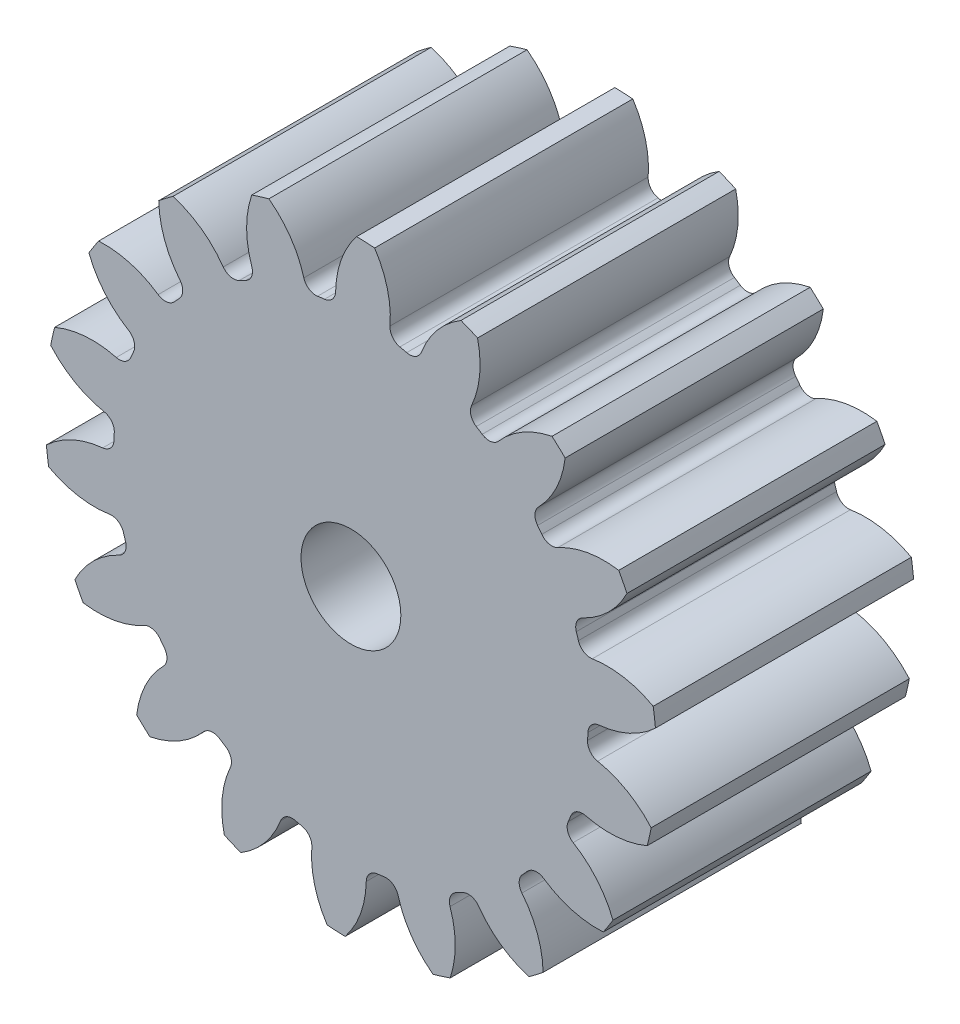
ISO-10303-21;
HEADER;
FILE_DESCRIPTION(('STEP AP214'),'2;1');
FILE_NAME('part.step','',(''),(''),'','','');
FILE_SCHEMA(('AUTOMOTIVE_DESIGN { 1 0 10303 214 1 1 1 1 }'));
ENDSEC;
DATA;
#1=APPLICATION_CONTEXT('core data for automotive mechanical design processes');
#2=APPLICATION_PROTOCOL_DEFINITION('international standard','automotive_design',2000,#1);
#3=PRODUCT_CONTEXT('',#1,'mechanical');
#4=PRODUCT('Part','Part','',(#3));
#5=PRODUCT_RELATED_PRODUCT_CATEGORY('part','',(#4));
#6=PRODUCT_DEFINITION_FORMATION('','',#4);
#7=PRODUCT_DEFINITION_CONTEXT('part definition',#1,'design');
#8=PRODUCT_DEFINITION('design','',#6,#7);
#9=PRODUCT_DEFINITION_SHAPE('','',#8);
#10=(LENGTH_UNIT() NAMED_UNIT(*) SI_UNIT(.MILLI.,.METRE.));
#11=(NAMED_UNIT(*) PLANE_ANGLE_UNIT() SI_UNIT($,.RADIAN.));
#12=(NAMED_UNIT(*) SI_UNIT($,.STERADIAN.) SOLID_ANGLE_UNIT());
#13=UNCERTAINTY_MEASURE_WITH_UNIT(LENGTH_MEASURE(1.E-05),#10,'distance_accuracy_value','');
#14=(GEOMETRIC_REPRESENTATION_CONTEXT(3) GLOBAL_UNCERTAINTY_ASSIGNED_CONTEXT((#13)) GLOBAL_UNIT_ASSIGNED_CONTEXT((#10,
#11,#12)) REPRESENTATION_CONTEXT('',''));
#15=CARTESIAN_POINT('',(0.,0.,0.));
#16=DIRECTION('',(0.,0.,1.));
#17=DIRECTION('',(1.,0.,0.));
#18=AXIS2_PLACEMENT_3D('',#15,#16,#17);
#19=CARTESIAN_POINT('',(0.,0.,95.25));
#20=DIRECTION('',(0.,0.,-1.));
#21=DIRECTION('',(-1.,0.,0.));
#22=AXIS2_PLACEMENT_3D('',#19,#20,#21);
#23=CYLINDRICAL_SURFACE('',#22,112.888888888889);
#24=DIRECTION('',(0.,0.,-1.));
#25=VECTOR('',#24,1.);
#26=CARTESIAN_POINT('',(111.524094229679,17.5007897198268,47.625));
#27=LINE('',#26,#25);
#28=CARTESIAN_POINT('',(111.524094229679,17.5007897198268,95.25));
#29=VERTEX_POINT('',#28);
#30=CARTESIAN_POINT('',(111.524094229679,17.5007897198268,0.));
#31=VERTEX_POINT('',#30);
#32=EDGE_CURVE('E744',#29,#31,#27,.T.);
#33=ORIENTED_EDGE('',*,*,#32,.F.);
#34=CARTESIAN_POINT('',(0.,0.,95.25));
#35=DIRECTION('',(0.,0.,1.));
#36=DIRECTION('',(1.,0.,0.));
#37=AXIS2_PLACEMENT_3D('',#34,#35,#36);
#38=CIRCLE('',#37,112.888888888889);
#39=CARTESIAN_POINT('',(112.358831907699,10.9267619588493,95.25));
#40=VERTEX_POINT('',#39);
#41=EDGE_CURVE('E1389',#40,#29,#38,.T.);
#42=ORIENTED_EDGE('',*,*,#41,.F.);
#43=DIRECTION('',(0.,0.,-1.));
#44=VECTOR('',#43,1.);
#45=CARTESIAN_POINT('',(112.358831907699,10.9267619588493,47.625));
#46=LINE('',#45,#44);
#47=CARTESIAN_POINT('',(112.358831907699,10.9267619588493,0.));
#48=VERTEX_POINT('',#47);
#49=EDGE_CURVE('E1383',#48,#40,#46,.F.);
#50=ORIENTED_EDGE('',*,*,#49,.F.);
#51=CARTESIAN_POINT('',(0.,0.,0.));
#52=DIRECTION('',(0.,0.,1.));
#53=DIRECTION('',(1.,0.,0.));
#54=AXIS2_PLACEMENT_3D('',#51,#52,#53);
#55=CIRCLE('',#54,112.888888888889);
#56=EDGE_CURVE('E1394',#48,#31,#55,.T.);
#57=ORIENTED_EDGE('',*,*,#56,.T.);
#58=EDGE_LOOP('',(#33,#42,#50,#57));
#59=FACE_BOUND('',#58,.T.);
#60=ADVANCED_FACE('F33',(#59),#23,.T.);
#61=DIRECTION('',(0.,0.,-1.));
#62=VECTOR('',#61,1.);
#63=CARTESIAN_POINT('',(101.845592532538,48.6967813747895,47.625));
#64=LINE('',#63,#62);
#65=CARTESIAN_POINT('',(101.845592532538,48.6967813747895,0.));
#66=VERTEX_POINT('',#65);
#67=CARTESIAN_POINT('',(101.845592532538,48.6967813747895,95.25));
#68=VERTEX_POINT('',#67);
#69=EDGE_CURVE('E715',#66,#68,#64,.F.);
#70=ORIENTED_EDGE('',*,*,#69,.F.);
#71=CARTESIAN_POINT('',(98.812745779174,54.5888496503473,0.));
#72=VERTEX_POINT('',#71);
#73=EDGE_CURVE('E1397',#66,#72,#55,.T.);
#74=ORIENTED_EDGE('',*,*,#73,.T.);
#75=DIRECTION('',(0.,0.,-1.));
#76=VECTOR('',#75,1.);
#77=CARTESIAN_POINT('',(98.812745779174,54.5888496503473,47.625));
#78=LINE('',#77,#76);
#79=CARTESIAN_POINT('',(98.812745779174,54.5888496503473,95.25));
#80=VERTEX_POINT('',#79);
#81=EDGE_CURVE('E777',#80,#72,#78,.T.);
#82=ORIENTED_EDGE('',*,*,#81,.F.);
#83=EDGE_CURVE('E1392',#68,#80,#38,.T.);
#84=ORIENTED_EDGE('',*,*,#83,.F.);
#85=EDGE_LOOP('',(#70,#74,#82,#84));
#86=FACE_BOUND('',#85,.T.);
#87=ADVANCED_FACE('F1601',(#86),#23,.T.);
#88=CARTESIAN_POINT('',(0.,0.,95.25));
#89=DIRECTION('',(0.,0.,1.));
#90=DIRECTION('',(1.,0.,0.));
#91=AXIS2_PLACEMENT_3D('',#88,#89,#90);
#92=PLANE('',#91);
#93=CARTESIAN_POINT('',(0.,0.,95.2500000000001));
#94=DIRECTION('',(0.,0.,1.));
#95=DIRECTION('',(1.,0.,0.));
#96=AXIS2_PLACEMENT_3D('',#93,#94,#95);
#97=CIRCLE('',#96,18.415);
#98=CARTESIAN_POINT('',(18.415,0.,95.2499999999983));
#99=VERTEX_POINT('',#98);
#100=EDGE_CURVE('E732',#99,#99,#97,.T.);
#101=ORIENTED_EDGE('',*,*,#100,.F.);
#102=EDGE_LOOP('',(#101));
#103=FACE_BOUND('',#102,.T.);
#104=ORIENTED_EDGE('',*,*,#41,.T.);
#105=CARTESIAN_POINT('',(94.5373228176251,-13.3320837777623,95.25));
#106=DIRECTION('',(0.,0.,-1.));
#107=DIRECTION('',(0.939692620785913,0.342020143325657,0.));
#108=AXIS2_PLACEMENT_3D('',#105,#106,#107);
#109=CIRCLE('',#108,35.2025068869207);
#110=CARTESIAN_POINT('',(89.0577517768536,21.441336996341,95.25));
#111=VERTEX_POINT('',#110);
#112=EDGE_CURVE('E724',#111,#29,#109,.T.);
#113=ORIENTED_EDGE('',*,*,#112,.F.);
#114=CARTESIAN_POINT('',(88.3425664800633,25.9799111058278,95.25));
#115=DIRECTION('',(0.,0.,1.));
#116=DIRECTION('',(-0.939692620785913,-0.342020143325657,0.));
#117=AXIS2_PLACEMENT_3D('',#114,#115,#116);
#118=CIRCLE('',#117,4.59457777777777);
#119=CARTESIAN_POINT('',(83.9346438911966,24.683622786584,95.25));
#120=VERTEX_POINT('',#119);
#121=EDGE_CURVE('E722',#120,#111,#118,.T.);
#122=ORIENTED_EDGE('',*,*,#121,.F.);
#123=CARTESIAN_POINT('',(0.,0.,95.25));
#124=DIRECTION('',(0.,0.,-1.));
#125=DIRECTION('',(0.939692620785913,0.342020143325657,0.));
#126=AXIS2_PLACEMENT_3D('',#123,#124,#125);
#127=CIRCLE('',#126,87.4888888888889);
#128=CARTESIAN_POINT('',(83.1665876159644,27.1592412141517,95.25));
#129=VERTEX_POINT('',#128);
#130=EDGE_CURVE('E707',#129,#120,#127,.T.);
#131=ORIENTED_EDGE('',*,*,#130,.F.);
#132=CARTESIAN_POINT('',(87.5341748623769,28.5855394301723,95.25));
#133=DIRECTION('',(0.,0.,1.));
#134=DIRECTION('',(-0.939692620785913,-0.342020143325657,0.));
#135=AXIS2_PLACEMENT_3D('',#132,#133,#134);
#136=CIRCLE('',#135,4.59457777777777);
#137=CARTESIAN_POINT('',(85.554867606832,32.7319219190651,95.25));
#138=VERTEX_POINT('',#137);
#139=EDGE_CURVE('E699',#138,#129,#136,.T.);
#140=ORIENTED_EDGE('',*,*,#139,.F.);
#141=CARTESIAN_POINT('',(70.3899099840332,64.5004684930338,95.25));
#142=DIRECTION('',(0.,0.,-1.));
#143=DIRECTION('',(-0.939692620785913,-0.342020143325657,0.));
#144=AXIS2_PLACEMENT_3D('',#141,#142,#143);
#145=CIRCLE('',#144,35.2025068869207);
#146=EDGE_CURVE('E729',#68,#138,#145,.T.);
#147=ORIENTED_EDGE('',*,*,#146,.F.);
#148=ORIENTED_EDGE('',*,*,#83,.T.);
#149=CARTESIAN_POINT('',(93.3958658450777,19.8056079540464,95.25));
#150=DIRECTION('',(0.,0.,-1.));
#151=DIRECTION('',(0.766044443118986,0.64278760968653,0.));
#152=AXIS2_PLACEMENT_3D('',#149,#150,#151);
#153=CIRCLE('',#152,35.2025068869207);
#154=CARTESIAN_POINT('',(76.3535430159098,50.6078111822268,95.25));
#155=VERTEX_POINT('',#154);
#156=EDGE_CURVE('E753',#155,#80,#153,.T.);
#157=ORIENTED_EDGE('',*,*,#156,.F.);
#158=CARTESIAN_POINT('',(74.1292049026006,54.628068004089,95.25));
#159=DIRECTION('',(0.,0.,1.));
#160=DIRECTION('',(-0.766044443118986,-0.64278760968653,0.));
#161=AXIS2_PLACEMENT_3D('',#158,#159,#160);
#162=CIRCLE('',#161,4.59457777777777);
#163=CARTESIAN_POINT('',(70.4304692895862,51.9023571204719,95.25));
#164=VERTEX_POINT('',#163);
#165=EDGE_CURVE('E751',#164,#155,#162,.T.);
#166=ORIENTED_EDGE('',*,*,#165,.F.);
#167=CARTESIAN_POINT('',(0.,0.,95.25));
#168=DIRECTION('',(0.,0.,-1.));
#169=DIRECTION('',(0.766044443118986,0.64278760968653,0.));
#170=AXIS2_PLACEMENT_3D('',#167,#168,#169);
#171=CIRCLE('',#170,87.4888888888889);
#172=CARTESIAN_POINT('',(68.8620211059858,53.9659867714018,95.25));
#173=VERTEX_POINT('',#172);
#174=EDGE_CURVE('E748',#173,#164,#171,.T.);
#175=ORIENTED_EDGE('',*,*,#174,.F.);
#176=CARTESIAN_POINT('',(72.4783878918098,56.8000714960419,95.25));
#177=DIRECTION('',(0.,0.,1.));
#178=DIRECTION('',(-0.766044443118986,-0.64278760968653,0.));
#179=AXIS2_PLACEMENT_3D('',#176,#177,#178);
#180=CIRCLE('',#179,4.59457777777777);
#181=CARTESIAN_POINT('',(69.2003011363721,60.0194335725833,95.25));
#182=VERTEX_POINT('',#181);
#183=EDGE_CURVE('E746',#182,#173,#180,.T.);
#184=ORIENTED_EDGE('',*,*,#183,.F.);
#185=CARTESIAN_POINT('',(44.0844195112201,84.6853813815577,95.25));
#186=DIRECTION('',(0.,0.,-1.));
#187=DIRECTION('',(-0.766044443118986,-0.64278760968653,0.));
#188=AXIS2_PLACEMENT_3D('',#185,#186,#187);
#189=CIRCLE('',#188,35.2025068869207);
#190=CARTESIAN_POINT('',(79.0482716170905,80.5932502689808,95.25));
#191=VERTEX_POINT('',#190);
#192=EDGE_CURVE('E756',#191,#182,#189,.T.);
#193=ORIENTED_EDGE('',*,*,#192,.F.);
#194=CARTESIAN_POINT('',(74.1831218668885,85.0926886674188,95.25));
#195=VERTEX_POINT('',#194);
#196=EDGE_CURVE('E1441',#191,#195,#38,.T.);
#197=ORIENTED_EDGE('',*,*,#196,.T.);
#198=CARTESIAN_POINT('',(80.9894890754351,50.5544510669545,95.25));
#199=DIRECTION('',(0.,0.,-1.));
#200=DIRECTION('',(0.50000000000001,0.866025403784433,0.));
#201=AXIS2_PLACEMENT_3D('',#198,#199,#200);
#202=CIRCLE('',#201,35.2025068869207);
#203=CARTESIAN_POINT('',(54.4399701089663,73.6702364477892,95.25));
#204=VERTEX_POINT('',#203);
#205=EDGE_CURVE('E788',#204,#195,#202,.T.);
#206=ORIENTED_EDGE('',*,*,#205,.F.);
#207=CARTESIAN_POINT('',(50.9747671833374,76.6872736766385,95.25));
#208=DIRECTION('',(0.,0.,1.));
#209=DIRECTION('',(-0.50000000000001,-0.866025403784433,0.));
#210=AXIS2_PLACEMENT_3D('',#207,#208,#209);
#211=CIRCLE('',#210,4.59457777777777);
#212=CARTESIAN_POINT('',(48.4313406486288,72.8609011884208,95.25));
#213=VERTEX_POINT('',#212);
#214=EDGE_CURVE('E786',#213,#204,#211,.T.);
#215=ORIENTED_EDGE('',*,*,#214,.F.);
#216=CARTESIAN_POINT('',(0.,0.,95.25));
#217=DIRECTION('',(0.,0.,-1.));
#218=DIRECTION('',(0.50000000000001,0.866025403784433,0.));
#219=AXIS2_PLACEMENT_3D('',#216,#217,#218);
#220=CIRCLE('',#219,87.4888888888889);
#221=CARTESIAN_POINT('',(46.2516785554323,74.2636378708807,95.25));
#222=VERTEX_POINT('',#221);
#223=EDGE_CURVE('E783',#222,#213,#220,.T.);
#224=ORIENTED_EDGE('',*,*,#223,.F.);
#225=CARTESIAN_POINT('',(48.6806376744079,78.1636766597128,95.25));
#226=DIRECTION('',(0.,0.,1.));
#227=DIRECTION('',(-0.50000000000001,-0.866025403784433,0.));
#228=AXIS2_PLACEMENT_3D('',#225,#226,#227);
#229=CIRCLE('',#228,4.59457777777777);
#230=CARTESIAN_POINT('',(44.4991570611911,80.067715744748,95.25));
#231=VERTEX_POINT('',#230);
#232=EDGE_CURVE('E781',#231,#222,#229,.T.);
#233=ORIENTED_EDGE('',*,*,#232,.F.);
#234=CARTESIAN_POINT('',(12.4616974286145,94.6559874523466,95.25));
#235=DIRECTION('',(0.,0.,-1.));
#236=DIRECTION('',(-0.50000000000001,-0.866025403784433,0.));
#237=AXIS2_PLACEMENT_3D('',#234,#235,#236);
#238=CIRCLE('',#237,35.2025068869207);
#239=CARTESIAN_POINT('',(46.7165625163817,102.768983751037,95.25));
#240=VERTEX_POINT('',#239);
#241=EDGE_CURVE('E791',#240,#231,#238,.T.);
#242=ORIENTED_EDGE('',*,*,#241,.F.);
#243=CARTESIAN_POINT('',(40.6059186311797,105.333093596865,95.25));
#244=VERTEX_POINT('',#243);
#245=EDGE_CURVE('E1583',#240,#244,#38,.T.);
#246=ORIENTED_EDGE('',*,*,#245,.T.);
#247=CARTESIAN_POINT('',(58.8145846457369,75.2056812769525,95.25));
#248=DIRECTION('',(0.,0.,-1.));
#249=DIRECTION('',(0.17364817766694,0.984807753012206,0.));
#250=AXIS2_PLACEMENT_3D('',#247,#248,#249);
#251=CIRCLE('',#250,35.2025068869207);
#252=CARTESIAN_POINT('',(25.9601333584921,87.8469439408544,95.25));
#253=VERTEX_POINT('',#252);
#254=EDGE_CURVE('E826',#253,#244,#251,.T.);
#255=ORIENTED_EDGE('',*,*,#254,.F.);
#256=CARTESIAN_POINT('',(21.6720202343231,89.4968623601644,95.25));
#257=DIRECTION('',(0.,0.,1.));
#258=DIRECTION('',(-0.17364817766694,-0.984807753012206,0.));
#259=AXIS2_PLACEMENT_3D('',#256,#257,#258);
#260=CIRCLE('',#259,4.59457777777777);
#261=CARTESIAN_POINT('',(20.5906775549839,85.0313452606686,95.25));
#262=VERTEX_POINT('',#261);
#263=EDGE_CURVE('E824',#262,#253,#260,.T.);
#264=ORIENTED_EDGE('',*,*,#263,.F.);
#265=CARTESIAN_POINT('',(0.,0.,95.25));
#266=DIRECTION('',(0.,0.,-1.));
#267=DIRECTION('',(0.17364817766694,0.984807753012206,0.));
#268=AXIS2_PLACEMENT_3D('',#265,#266,#267);
#269=CIRCLE('',#268,87.4888888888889);
#270=CARTESIAN_POINT('',(18.0627009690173,85.6039982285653,95.25));
#271=VERTEX_POINT('',#270);
#272=EDGE_CURVE('E821',#271,#262,#269,.T.);
#273=ORIENTED_EDGE('',*,*,#272,.F.);
#274=CARTESIAN_POINT('',(19.0112841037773,90.0995888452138,95.25));
#275=DIRECTION('',(0.,0.,1.));
#276=DIRECTION('',(-0.17364817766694,-0.984807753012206,0.));
#277=AXIS2_PLACEMENT_3D('',#274,#275,#276);
#278=CIRCLE('',#277,4.59457777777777);
#279=CARTESIAN_POINT('',(14.4307579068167,90.4586497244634,95.25));
#280=VERTEX_POINT('',#279);
#281=EDGE_CURVE('E819',#280,#271,#278,.T.);
#282=ORIENTED_EDGE('',*,*,#281,.F.);
#283=CARTESIAN_POINT('',(-20.6640892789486,93.2096844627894,95.25));
#284=DIRECTION('',(0.,0.,-1.));
#285=DIRECTION('',(-0.17364817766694,-0.984807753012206,0.));
#286=AXIS2_PLACEMENT_3D('',#283,#284,#285);
#287=CIRCLE('',#286,35.2025068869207);
#288=CARTESIAN_POINT('',(8.75014651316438,112.549261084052,95.25));
#289=VERTEX_POINT('',#288);
#290=EDGE_CURVE('E829',#289,#280,#287,.T.);
#291=ORIENTED_EDGE('',*,*,#290,.F.);
#292=CARTESIAN_POINT('',(2.13104232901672,112.868772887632,95.25));
#293=VERTEX_POINT('',#292);
#294=EDGE_CURVE('E1579',#289,#293,#38,.T.);
#295=ORIENTED_EDGE('',*,*,#294,.T.);
#296=CARTESIAN_POINT('',(29.5457732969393,90.7859964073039,95.25));
#297=DIRECTION('',(0.,0.,-1.));
#298=DIRECTION('',(-0.173648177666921,0.98480775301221,0.));
#299=AXIS2_PLACEMENT_3D('',#296,#297,#298);
#300=CIRCLE('',#299,35.2025068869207);
#301=CARTESIAN_POINT('',(-5.6508786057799,91.4280135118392,95.25));
#302=VERTEX_POINT('',#301);
#303=EDGE_CURVE('E864',#302,#293,#300,.T.);
#304=ORIENTED_EDGE('',*,*,#303,.F.);
#305=CARTESIAN_POINT('',(-10.2446921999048,91.5118086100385,95.25));
#306=DIRECTION('',(0.,0.,1.));
#307=DIRECTION('',(0.173648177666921,-0.98480775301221,0.));
#308=AXIS2_PLACEMENT_3D('',#305,#306,#307);
#309=CIRCLE('',#308,4.59457777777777);
#310=CARTESIAN_POINT('',(-9.73352513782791,86.9457541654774,95.25));
#311=VERTEX_POINT('',#310);
#312=EDGE_CURVE('E862',#311,#302,#309,.T.);
#313=ORIENTED_EDGE('',*,*,#312,.F.);
#314=CARTESIAN_POINT('',(0.,0.,95.25));
#315=DIRECTION('',(0.,0.,-1.));
#316=DIRECTION('',(-0.173648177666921,0.98480775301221,0.));
#317=AXIS2_PLACEMENT_3D('',#314,#315,#316);
#318=CIRCLE('',#317,87.4888888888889);
#319=CARTESIAN_POINT('',(-12.3049049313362,86.6192530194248,95.25));
#320=VERTEX_POINT('',#319);
#321=EDGE_CURVE('E859',#320,#311,#318,.T.);
#322=ORIENTED_EDGE('',*,*,#321,.F.);
#323=CARTESIAN_POINT('',(-12.9511109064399,91.1681608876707,95.25));
#324=DIRECTION('',(0.,0.,1.));
#325=DIRECTION('',(0.173648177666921,-0.98480775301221,0.));
#326=AXIS2_PLACEMENT_3D('',#323,#324,#325);
#327=CIRCLE('',#326,4.59457777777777);
#328=CARTESIAN_POINT('',(-17.3782036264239,89.938935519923,95.25));
#329=VERTEX_POINT('',#328);
#330=EDGE_CURVE('E857',#329,#320,#327,.T.);
#331=ORIENTED_EDGE('',*,*,#330,.F.);
#332=CARTESIAN_POINT('',(-51.2974818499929,80.5209178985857,95.25));
#333=DIRECTION('',(0.,0.,-1.));
#334=DIRECTION('',(0.173648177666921,-0.98480775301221,0.));
#335=AXIS2_PLACEMENT_3D('',#332,#333,#334);
#336=CIRCLE('',#335,35.2025068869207);
#337=CARTESIAN_POINT('',(-30.2716662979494,108.754436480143,95.25));
#338=VERTEX_POINT('',#337);
#339=EDGE_CURVE('E867',#338,#329,#336,.T.);
#340=ORIENTED_EDGE('',*,*,#339,.F.);
#341=CARTESIAN_POINT('',(-36.6008691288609,106.790812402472,95.25));
#342=VERTEX_POINT('',#341);
#343=EDGE_CURVE('E1575',#338,#342,#38,.T.);
#344=ORIENTED_EDGE('',*,*,#343,.T.);
#345=CARTESIAN_POINT('',(-3.28669436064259,95.4161805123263,95.25));
#346=DIRECTION('',(0.,0.,-1.));
#347=DIRECTION('',(-0.499999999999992,0.866025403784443,0.));
#348=AXIS2_PLACEMENT_3D('',#345,#346,#347);
#349=CIRCLE('',#348,35.2025068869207);
#350=CARTESIAN_POINT('',(-36.5803112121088,83.9815153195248,95.25));
#351=VERTEX_POINT('',#350);
#352=EDGE_CURVE('E902',#351,#342,#349,.T.);
#353=ORIENTED_EDGE('',*,*,#352,.F.);
#354=CARTESIAN_POINT('',(-40.9257435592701,82.4890801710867,95.25));
#355=DIRECTION('',(0.,0.,1.));
#356=DIRECTION('',(0.499999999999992,-0.866025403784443,0.));
#357=AXIS2_PLACEMENT_3D('',#354,#355,#356);
#358=CIRCLE('',#357,4.59457777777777);
#359=CARTESIAN_POINT('',(-38.883721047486,78.3732219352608,95.25));
#360=VERTEX_POINT('',#359);
#361=EDGE_CURVE('E900',#360,#351,#358,.T.);
#362=ORIENTED_EDGE('',*,*,#361,.F.);
#363=CARTESIAN_POINT('',(0.,0.,95.25));
#364=DIRECTION('',(0.,0.,-1.));
#365=DIRECTION('',(-0.499999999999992,0.866025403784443,0.));
#366=AXIS2_PLACEMENT_3D('',#363,#364,#365);
#367=CIRCLE('',#366,87.4888888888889);
#368=CARTESIAN_POINT('',(-41.1883576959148,77.1869475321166,95.25));
#369=VERTEX_POINT('',#368);
#370=EDGE_CURVE('E897',#369,#360,#367,.T.);
#371=ORIENTED_EDGE('',*,*,#370,.F.);
#372=CARTESIAN_POINT('',(-43.3514108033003,81.2405072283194,95.25));
#373=DIRECTION('',(0.,0.,1.));
#374=DIRECTION('',(0.499999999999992,-0.866025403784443,0.));
#375=AXIS2_PLACEMENT_3D('',#372,#373,#374);
#376=CIRCLE('',#375,4.59457777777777);
#377=CARTESIAN_POINT('',(-47.0910973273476,78.5712583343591,95.25));
#378=VERTEX_POINT('',#377);
#379=EDGE_CURVE('E895',#378,#369,#376,.T.);
#380=ORIENTED_EDGE('',*,*,#379,.F.);
#381=CARTESIAN_POINT('',(-75.7436410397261,58.1201402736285,95.25));
#382=DIRECTION('',(0.,0.,-1.));
#383=DIRECTION('',(0.499999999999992,-0.866025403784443,0.));
#384=AXIS2_PLACEMENT_3D('',#381,#382,#383);
#385=CIRCLE('',#384,35.2025068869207);
#386=CARTESIAN_POINT('',(-65.6422693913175,91.8422217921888,95.25));
#387=VERTEX_POINT('',#386);
#388=EDGE_CURVE('E905',#387,#378,#385,.T.);
#389=ORIENTED_EDGE('',*,*,#388,.F.);
#390=CARTESIAN_POINT('',(-70.9181755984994,87.8323038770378,95.25));
#391=VERTEX_POINT('',#390);
#392=EDGE_CURVE('E1571',#387,#391,#38,.T.);
#393=ORIENTED_EDGE('',*,*,#392,.T.);
#394=CARTESIAN_POINT('',(-35.7227381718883,88.5377650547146,95.25));
#395=DIRECTION('',(0.,0.,-1.));
#396=DIRECTION('',(-0.766044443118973,0.642787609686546,0.));
#397=AXIS2_PLACEMENT_3D('',#394,#395,#396);
#398=CIRCLE('',#397,35.2025068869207);
#399=CARTESIAN_POINT('',(-63.0976184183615,66.4056069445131,95.25));
#400=VERTEX_POINT('',#399);
#401=EDGE_CURVE('E940',#400,#391,#398,.T.);
#402=ORIENTED_EDGE('',*,*,#401,.F.);
#403=CARTESIAN_POINT('',(-66.6705462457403,63.5169512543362,95.25));
#404=DIRECTION('',(0.,0.,1.));
#405=DIRECTION('',(0.766044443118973,-0.642787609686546,0.));
#406=AXIS2_PLACEMENT_3D('',#403,#404,#405);
#407=CIRCLE('',#406,4.59457777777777);
#408=CARTESIAN_POINT('',(-63.3439663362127,60.3477224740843,95.25));
#409=VERTEX_POINT('',#408);
#410=EDGE_CURVE('E938',#409,#400,#407,.T.);
#411=ORIENTED_EDGE('',*,*,#410,.F.);
#412=CARTESIAN_POINT('',(0.,0.,95.25));
#413=DIRECTION('',(0.,0.,-1.));
#414=DIRECTION('',(-0.766044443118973,0.642787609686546,0.));
#415=AXIS2_PLACEMENT_3D('',#412,#413,#414);
#416=CIRCLE('',#415,87.4888888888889);
#417=CARTESIAN_POINT('',(-65.1038866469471,58.4447570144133,95.25));
#418=VERTEX_POINT('',#417);
#419=EDGE_CURVE('E935',#418,#409,#416,.T.);
#420=ORIENTED_EDGE('',*,*,#419,.F.);
#421=CARTESIAN_POINT('',(-68.5228907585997,61.5140494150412,95.25));
#422=DIRECTION('',(0.,0.,1.));
#423=DIRECTION('',(0.766044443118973,-0.642787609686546,0.));
#424=AXIS2_PLACEMENT_3D('',#421,#422,#423);
#425=CIRCLE('',#424,4.59457777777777);
#426=CARTESIAN_POINT('',(-71.1241097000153,57.726727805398,95.25));
#427=VERTEX_POINT('',#426);
#428=EDGE_CURVE('E933',#427,#418,#425,.T.);
#429=ORIENTED_EDGE('',*,*,#428,.F.);
#430=CARTESIAN_POINT('',(-91.0539992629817,28.7092159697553,95.25));
#431=DIRECTION('',(0.,0.,-1.));
#432=DIRECTION('',(0.766044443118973,-0.642787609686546,0.));
#433=AXIS2_PLACEMENT_3D('',#430,#431,#432);
#434=CIRCLE('',#433,35.2025068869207);
#435=CARTESIAN_POINT('',(-93.0954460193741,63.8524797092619,95.25));
#436=VERTEX_POINT('',#435);
#437=EDGE_CURVE('E943',#436,#427,#434,.T.);
#438=ORIENTED_EDGE('',*,*,#437,.F.);
#439=CARTESIAN_POINT('',(-96.6817034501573,58.2799232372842,95.25));
#440=VERTEX_POINT('',#439);
#441=EDGE_CURVE('E1567',#436,#440,#38,.T.);
#442=ORIENTED_EDGE('',*,*,#441,.T.);
#443=CARTESIAN_POINT('',(-63.8500925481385,70.9803884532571,95.25));
#444=DIRECTION('',(0.,0.,-1.));
#445=DIRECTION('',(-0.939692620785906,0.342020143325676,0.));
#446=AXIS2_PLACEMENT_3D('',#443,#444,#445);
#447=CIRCLE('',#446,35.2025068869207);
#448=CARTESIAN_POINT('',(-82.0044216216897,40.820202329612,95.25));
#449=VERTEX_POINT('',#448);
#450=EDGE_CURVE('E978',#449,#440,#447,.T.);
#451=ORIENTED_EDGE('',*,*,#450,.F.);
#452=CARTESIAN_POINT('',(-84.3738971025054,36.8837406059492,95.25));
#453=DIRECTION('',(0.,0.,1.));
#454=DIRECTION('',(0.939692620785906,-0.342020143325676,0.));
#455=AXIS2_PLACEMENT_3D('',#452,#453,#454);
#456=CIRCLE('',#455,4.59457777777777);
#457=CARTESIAN_POINT('',(-80.1639944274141,35.0433970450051,95.25));
#458=VERTEX_POINT('',#457);
#459=EDGE_CURVE('E976',#458,#449,#456,.T.);
#460=ORIENTED_EDGE('',*,*,#459,.F.);
#461=CARTESIAN_POINT('',(0.,0.,95.25));
#462=DIRECTION('',(0.,0.,-1.));
#463=DIRECTION('',(-0.939692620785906,0.342020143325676,0.));
#464=AXIS2_PLACEMENT_3D('',#461,#462,#463);
#465=CIRCLE('',#464,87.4888888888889);
#466=CARTESIAN_POINT('',(-81.166926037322,32.6532662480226,95.25));
#467=VERTEX_POINT('',#466);
#468=EDGE_CURVE('E973',#467,#458,#465,.T.);
#469=ORIENTED_EDGE('',*,*,#468,.F.);
#470=CARTESIAN_POINT('',(-85.4294987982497,34.3680893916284,95.25));
#471=DIRECTION('',(0.,0.,1.));
#472=DIRECTION('',(0.939692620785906,-0.342020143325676,0.));
#473=AXIS2_PLACEMENT_3D('',#470,#471,#472);
#474=CIRCLE('',#473,4.59457777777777);
#475=CARTESIAN_POINT('',(-86.5785047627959,29.9195019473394,95.25));
#476=VERTEX_POINT('',#475);
#477=EDGE_CURVE('E971',#476,#467,#474,.T.);
#478=ORIENTED_EDGE('',*,*,#477,.F.);
#479=CARTESIAN_POINT('',(-95.3819013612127,-4.16446348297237,95.25));
#480=DIRECTION('',(0.,0.,-1.));
#481=DIRECTION('',(0.939692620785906,-0.342020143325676,0.));
#482=AXIS2_PLACEMENT_3D('',#479,#480,#481);
#483=CIRCLE('',#482,35.2025068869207);
#484=CARTESIAN_POINT('',(-109.31993791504,28.1611862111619,95.25));
#485=VERTEX_POINT('',#484);
#486=EDGE_CURVE('E981',#485,#476,#483,.T.);
#487=ORIENTED_EDGE('',*,*,#486,.F.);
#488=CARTESIAN_POINT('',(-110.783990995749,21.6981237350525,95.25));
#489=VERTEX_POINT('',#488);
#490=EDGE_CURVE('E1563',#485,#489,#38,.T.);
#491=ORIENTED_EDGE('',*,*,#490,.T.);
#492=CARTESIAN_POINT('',(-84.2761834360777,44.8617294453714,95.25));
#493=DIRECTION('',(0.,0.,-1.));
#494=DIRECTION('',(-1.,0.,0.));
#495=AXIS2_PLACEMENT_3D('',#492,#493,#494);
#496=CIRCLE('',#495,35.2025068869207);
#497=CARTESIAN_POINT('',(-91.0202813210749,10.3112788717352,95.25));
#498=VERTEX_POINT('',#497);
#499=EDGE_CURVE('E1016',#498,#489,#496,.T.);
#500=ORIENTED_EDGE('',*,*,#499,.F.);
#501=CARTESIAN_POINT('',(-91.9005107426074,5.80180649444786,95.25));
#502=DIRECTION('',(0.,0.,1.));
#503=DIRECTION('',(1.,0.,0.));
#504=AXIS2_PLACEMENT_3D('',#501,#502,#503);
#505=CIRCLE('',#504,4.59457777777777);
#506=CARTESIAN_POINT('',(-87.3150616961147,5.51232074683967,95.25));
#507=VERTEX_POINT('',#506);
#508=EDGE_CURVE('E1014',#507,#498,#505,.T.);
#509=ORIENTED_EDGE('',*,*,#508,.F.);
#510=CARTESIAN_POINT('',(0.,0.,95.25));
#511=DIRECTION('',(0.,0.,-1.));
#512=DIRECTION('',(-1.,0.,0.));
#513=AXIS2_PLACEMENT_3D('',#510,#511,#512);
#514=CIRCLE('',#513,87.4888888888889);
#515=CARTESIAN_POINT('',(-87.440036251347,2.92330966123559,95.25));
#516=VERTEX_POINT('',#515);
#517=EDGE_CURVE('E1011',#516,#507,#514,.T.);
#518=ORIENTED_EDGE('',*,*,#517,.F.);
#519=CARTESIAN_POINT('',(-92.032048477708,3.07683056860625,95.25));
#520=DIRECTION('',(0.,0.,1.));
#521=DIRECTION('',(1.,0.,0.));
#522=AXIS2_PLACEMENT_3D('',#519,#520,#521);
#523=CIRCLE('',#522,4.59457777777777);
#524=CARTESIAN_POINT('',(-91.5902543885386,-1.49645741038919,95.25));
#525=VERTEX_POINT('',#524);
#526=EDGE_CURVE('E1009',#525,#516,#523,.T.);
#527=ORIENTED_EDGE('',*,*,#526,.F.);
#528=CARTESIAN_POINT('',(-88.2053384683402,-36.5358471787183,95.25));
#529=DIRECTION('',(0.,0.,-1.));
#530=DIRECTION('',(1.,0.,0.));
#531=AXIS2_PLACEMENT_3D('',#528,#529,#530);
#532=CIRCLE('',#531,35.2025068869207);
#533=CARTESIAN_POINT('',(-112.358831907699,-10.9267619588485,95.25));
#534=VERTEX_POINT('',#533);
#535=EDGE_CURVE('E1019',#534,#525,#532,.T.);
#536=ORIENTED_EDGE('',*,*,#535,.F.);
#537=CARTESIAN_POINT('',(-111.524094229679,-17.5007897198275,95.25));
#538=VERTEX_POINT('',#537);
#539=EDGE_CURVE('E1559',#534,#538,#38,.T.);
#540=ORIENTED_EDGE('',*,*,#539,.T.);
#541=CARTESIAN_POINT('',(-94.5373228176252,13.3320837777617,95.25));
#542=DIRECTION('',(0.,0.,-1.));
#543=DIRECTION('',(-0.939692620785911,-0.342020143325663,0.));
#544=AXIS2_PLACEMENT_3D('',#541,#542,#543);
#545=CIRCLE('',#544,35.2025068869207);
#546=CARTESIAN_POINT('',(-89.0577517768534,-21.4413369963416,95.25));
#547=VERTEX_POINT('',#546);
#548=EDGE_CURVE('E1054',#547,#538,#545,.T.);
#549=ORIENTED_EDGE('',*,*,#548,.F.);
#550=CARTESIAN_POINT('',(-88.3425664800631,-25.9799111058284,95.25));
#551=DIRECTION('',(0.,0.,1.));
#552=DIRECTION('',(0.939692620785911,0.342020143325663,0.));
#553=AXIS2_PLACEMENT_3D('',#550,#551,#552);
#554=CIRCLE('',#553,4.59457777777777);
#555=CARTESIAN_POINT('',(-83.9346438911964,-24.6836227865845,95.25));
#556=VERTEX_POINT('',#555);
#557=EDGE_CURVE('E1052',#556,#547,#554,.T.);
#558=ORIENTED_EDGE('',*,*,#557,.F.);
#559=CARTESIAN_POINT('',(0.,0.,95.25));
#560=DIRECTION('',(0.,0.,-1.));
#561=DIRECTION('',(-0.939692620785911,-0.342020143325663,0.));
#562=AXIS2_PLACEMENT_3D('',#559,#560,#561);
#563=CIRCLE('',#562,87.4888888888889);
#564=CARTESIAN_POINT('',(-83.1665876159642,-27.1592412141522,95.25));
#565=VERTEX_POINT('',#564);
#566=EDGE_CURVE('E1049',#565,#556,#563,.T.);
#567=ORIENTED_EDGE('',*,*,#566,.F.);
#568=CARTESIAN_POINT('',(-87.5341748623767,-28.5855394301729,95.25));
#569=DIRECTION('',(0.,0.,1.));
#570=DIRECTION('',(0.939692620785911,0.342020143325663,0.));
#571=AXIS2_PLACEMENT_3D('',#568,#569,#570);
#572=CIRCLE('',#571,4.59457777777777);
#573=CARTESIAN_POINT('',(-85.5548676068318,-32.7319219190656,95.25));
#574=VERTEX_POINT('',#573);
#575=EDGE_CURVE('E1047',#574,#565,#572,.T.);
#576=ORIENTED_EDGE('',*,*,#575,.F.);
#577=CARTESIAN_POINT('',(-70.3899099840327,-64.5004684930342,95.25));
#578=DIRECTION('',(0.,0.,-1.));
#579=DIRECTION('',(0.939692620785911,0.342020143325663,0.));
#580=AXIS2_PLACEMENT_3D('',#577,#578,#579);
#581=CIRCLE('',#580,35.2025068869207);
#582=CARTESIAN_POINT('',(-101.845592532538,-48.6967813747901,95.25));
#583=VERTEX_POINT('',#582);
#584=EDGE_CURVE('E1057',#583,#574,#581,.T.);
#585=ORIENTED_EDGE('',*,*,#584,.F.);
#586=CARTESIAN_POINT('',(-98.8127457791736,-54.588849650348,95.25));
#587=VERTEX_POINT('',#586);
#588=EDGE_CURVE('E1555',#583,#587,#38,.T.);
#589=ORIENTED_EDGE('',*,*,#588,.T.);
#590=CARTESIAN_POINT('',(-93.3958658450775,-19.8056079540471,95.25));
#591=DIRECTION('',(0.,0.,-1.));
#592=DIRECTION('',(-0.766044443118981,-0.642787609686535,0.));
#593=AXIS2_PLACEMENT_3D('',#590,#591,#592);
#594=CIRCLE('',#593,35.2025068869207);
#595=CARTESIAN_POINT('',(-76.3535430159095,-50.6078111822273,95.25));
#596=VERTEX_POINT('',#595);
#597=EDGE_CURVE('E1092',#596,#587,#594,.T.);
#598=ORIENTED_EDGE('',*,*,#597,.F.);
#599=CARTESIAN_POINT('',(-74.1292049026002,-54.6280680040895,95.25));
#600=DIRECTION('',(0.,0.,1.));
#601=DIRECTION('',(0.766044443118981,0.642787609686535,0.));
#602=AXIS2_PLACEMENT_3D('',#599,#600,#601);
#603=CIRCLE('',#602,4.59457777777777);
#604=CARTESIAN_POINT('',(-70.4304692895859,-51.9023571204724,95.25));
#605=VERTEX_POINT('',#604);
#606=EDGE_CURVE('E1090',#605,#596,#603,.T.);
#607=ORIENTED_EDGE('',*,*,#606,.F.);
#608=CARTESIAN_POINT('',(0.,0.,95.25));
#609=DIRECTION('',(0.,0.,-1.));
#610=DIRECTION('',(-0.766044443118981,-0.642787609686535,0.));
#611=AXIS2_PLACEMENT_3D('',#608,#609,#610);
#612=CIRCLE('',#611,87.4888888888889);
#613=CARTESIAN_POINT('',(-68.8620211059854,-53.9659867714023,95.25));
#614=VERTEX_POINT('',#613);
#615=EDGE_CURVE('E1087',#614,#605,#612,.T.);
#616=ORIENTED_EDGE('',*,*,#615,.F.);
#617=CARTESIAN_POINT('',(-72.4783878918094,-56.8000714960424,95.25));
#618=DIRECTION('',(0.,0.,1.));
#619=DIRECTION('',(0.766044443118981,0.642787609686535,0.));
#620=AXIS2_PLACEMENT_3D('',#617,#618,#619);
#621=CIRCLE('',#620,4.59457777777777);
#622=CARTESIAN_POINT('',(-69.2003011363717,-60.0194335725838,95.25));
#623=VERTEX_POINT('',#622);
#624=EDGE_CURVE('E1085',#623,#614,#621,.T.);
#625=ORIENTED_EDGE('',*,*,#624,.F.);
#626=CARTESIAN_POINT('',(-44.0844195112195,-84.685381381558,95.25));
#627=DIRECTION('',(0.,0.,-1.));
#628=DIRECTION('',(0.766044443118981,0.642787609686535,0.));
#629=AXIS2_PLACEMENT_3D('',#626,#627,#628);
#630=CIRCLE('',#629,35.2025068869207);
#631=CARTESIAN_POINT('',(-79.0482716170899,-80.5932502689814,95.25));
#632=VERTEX_POINT('',#631);
#633=EDGE_CURVE('E1095',#632,#623,#630,.T.);
#634=ORIENTED_EDGE('',*,*,#633,.F.);
#635=CARTESIAN_POINT('',(-74.1831218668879,-85.0926886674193,95.25));
#636=VERTEX_POINT('',#635);
#637=EDGE_CURVE('E1551',#632,#636,#38,.T.);
#638=ORIENTED_EDGE('',*,*,#637,.T.);
#639=CARTESIAN_POINT('',(-80.9894890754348,-50.5544510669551,95.25));
#640=DIRECTION('',(0.,0.,-1.));
#641=DIRECTION('',(-0.500000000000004,-0.866025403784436,0.));
#642=AXIS2_PLACEMENT_3D('',#639,#640,#641);
#643=CIRCLE('',#642,35.2025068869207);
#644=CARTESIAN_POINT('',(-54.4399701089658,-73.6702364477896,95.25));
#645=VERTEX_POINT('',#644);
#646=EDGE_CURVE('E1130',#645,#636,#643,.T.);
#647=ORIENTED_EDGE('',*,*,#646,.F.);
#648=CARTESIAN_POINT('',(-50.9747671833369,-76.6872736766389,95.25));
#649=DIRECTION('',(0.,0.,1.));
#650=DIRECTION('',(0.500000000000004,0.866025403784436,0.));
#651=AXIS2_PLACEMENT_3D('',#648,#649,#650);
#652=CIRCLE('',#651,4.59457777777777);
#653=CARTESIAN_POINT('',(-48.4313406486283,-72.8609011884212,95.25));
#654=VERTEX_POINT('',#653);
#655=EDGE_CURVE('E1128',#654,#645,#652,.T.);
#656=ORIENTED_EDGE('',*,*,#655,.F.);
#657=CARTESIAN_POINT('',(0.,0.,95.25));
#658=DIRECTION('',(0.,0.,-1.));
#659=DIRECTION('',(-0.500000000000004,-0.866025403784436,0.));
#660=AXIS2_PLACEMENT_3D('',#657,#658,#659);
#661=CIRCLE('',#660,87.4888888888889);
#662=CARTESIAN_POINT('',(-46.2516785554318,-74.2636378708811,95.25));
#663=VERTEX_POINT('',#662);
#664=EDGE_CURVE('E1125',#663,#654,#661,.T.);
#665=ORIENTED_EDGE('',*,*,#664,.F.);
#666=CARTESIAN_POINT('',(-48.6806376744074,-78.1636766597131,95.25));
#667=DIRECTION('',(0.,0.,1.));
#668=DIRECTION('',(0.500000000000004,0.866025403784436,0.));
#669=AXIS2_PLACEMENT_3D('',#666,#667,#668);
#670=CIRCLE('',#669,4.59457777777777);
#671=CARTESIAN_POINT('',(-44.4991570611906,-80.0677157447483,95.25));
#672=VERTEX_POINT('',#671);
#673=EDGE_CURVE('E1123',#672,#663,#670,.T.);
#674=ORIENTED_EDGE('',*,*,#673,.F.);
#675=CARTESIAN_POINT('',(-12.4616974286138,-94.6559874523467,95.25));
#676=DIRECTION('',(0.,0.,-1.));
#677=DIRECTION('',(0.500000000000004,0.866025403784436,0.));
#678=AXIS2_PLACEMENT_3D('',#675,#676,#677);
#679=CIRCLE('',#678,35.2025068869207);
#680=CARTESIAN_POINT('',(-46.716562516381,-102.768983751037,95.25));
#681=VERTEX_POINT('',#680);
#682=EDGE_CURVE('E1133',#681,#672,#679,.T.);
#683=ORIENTED_EDGE('',*,*,#682,.F.);
#684=CARTESIAN_POINT('',(-40.605918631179,-105.333093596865,95.25));
#685=VERTEX_POINT('',#684);
#686=EDGE_CURVE('E1547',#681,#685,#38,.T.);
#687=ORIENTED_EDGE('',*,*,#686,.T.);
#688=CARTESIAN_POINT('',(-58.8145846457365,-75.2056812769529,95.25));
#689=DIRECTION('',(0.,0.,-1.));
#690=DIRECTION('',(-0.173648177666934,-0.984807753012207,0.));
#691=AXIS2_PLACEMENT_3D('',#688,#689,#690);
#692=CIRCLE('',#691,35.2025068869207);
#693=CARTESIAN_POINT('',(-25.9601333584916,-87.8469439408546,95.25));
#694=VERTEX_POINT('',#693);
#695=EDGE_CURVE('E1168',#694,#685,#692,.T.);
#696=ORIENTED_EDGE('',*,*,#695,.F.);
#697=CARTESIAN_POINT('',(-21.6720202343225,-89.4968623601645,95.25));
#698=DIRECTION('',(0.,0.,1.));
#699=DIRECTION('',(0.173648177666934,0.984807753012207,0.));
#700=AXIS2_PLACEMENT_3D('',#697,#698,#699);
#701=CIRCLE('',#700,4.59457777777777);
#702=CARTESIAN_POINT('',(-20.5906775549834,-85.0313452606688,95.25));
#703=VERTEX_POINT('',#702);
#704=EDGE_CURVE('E1166',#703,#694,#701,.T.);
#705=ORIENTED_EDGE('',*,*,#704,.F.);
#706=CARTESIAN_POINT('',(0.,0.,95.25));
#707=DIRECTION('',(0.,0.,-1.));
#708=DIRECTION('',(-0.173648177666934,-0.984807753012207,0.));
#709=AXIS2_PLACEMENT_3D('',#706,#707,#708);
#710=CIRCLE('',#709,87.4888888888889);
#711=CARTESIAN_POINT('',(-18.0627009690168,-85.6039982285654,95.25));
#712=VERTEX_POINT('',#711);
#713=EDGE_CURVE('E1163',#712,#703,#710,.T.);
#714=ORIENTED_EDGE('',*,*,#713,.F.);
#715=CARTESIAN_POINT('',(-19.0112841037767,-90.0995888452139,95.25));
#716=DIRECTION('',(0.,0.,1.));
#717=DIRECTION('',(0.173648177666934,0.984807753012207,0.));
#718=AXIS2_PLACEMENT_3D('',#715,#716,#717);
#719=CIRCLE('',#718,4.59457777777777);
#720=CARTESIAN_POINT('',(-14.4307579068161,-90.4586497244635,95.25));
#721=VERTEX_POINT('',#720);
#722=EDGE_CURVE('E1161',#721,#712,#719,.T.);
#723=ORIENTED_EDGE('',*,*,#722,.F.);
#724=CARTESIAN_POINT('',(20.6640892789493,-93.2096844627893,95.25));
#725=DIRECTION('',(0.,0.,-1.));
#726=DIRECTION('',(0.173648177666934,0.984807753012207,0.));
#727=AXIS2_PLACEMENT_3D('',#724,#725,#726);
#728=CIRCLE('',#727,35.2025068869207);
#729=CARTESIAN_POINT('',(-8.75014651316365,-112.549261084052,95.25));
#730=VERTEX_POINT('',#729);
#731=EDGE_CURVE('E1171',#730,#721,#728,.T.);
#732=ORIENTED_EDGE('',*,*,#731,.F.);
#733=CARTESIAN_POINT('',(-2.13104232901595,-112.868772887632,95.25));
#734=VERTEX_POINT('',#733);
#735=EDGE_CURVE('E1543',#730,#734,#38,.T.);
#736=ORIENTED_EDGE('',*,*,#735,.T.);
#737=CARTESIAN_POINT('',(-29.5457732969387,-90.7859964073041,95.25));
#738=DIRECTION('',(0.,0.,-1.));
#739=DIRECTION('',(0.173648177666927,-0.984807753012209,0.));
#740=AXIS2_PLACEMENT_3D('',#737,#738,#739);
#741=CIRCLE('',#740,35.2025068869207);
#742=CARTESIAN_POINT('',(5.65087860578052,-91.4280135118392,95.25));
#743=VERTEX_POINT('',#742);
#744=EDGE_CURVE('E1206',#743,#734,#741,.T.);
#745=ORIENTED_EDGE('',*,*,#744,.F.);
#746=CARTESIAN_POINT('',(10.2446921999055,-91.5118086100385,95.25));
#747=DIRECTION('',(0.,0.,1.));
#748=DIRECTION('',(-0.173648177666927,0.984807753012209,0.));
#749=AXIS2_PLACEMENT_3D('',#746,#747,#748);
#750=CIRCLE('',#749,4.59457777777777);
#751=CARTESIAN_POINT('',(9.7335251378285,-86.9457541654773,95.25));
#752=VERTEX_POINT('',#751);
#753=EDGE_CURVE('E1204',#752,#743,#750,.T.);
#754=ORIENTED_EDGE('',*,*,#753,.F.);
#755=CARTESIAN_POINT('',(0.,0.,95.25));
#756=DIRECTION('',(0.,0.,-1.));
#757=DIRECTION('',(0.173648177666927,-0.984807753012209,0.));
#758=AXIS2_PLACEMENT_3D('',#755,#756,#757);
#759=CIRCLE('',#758,87.4888888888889);
#760=CARTESIAN_POINT('',(12.3049049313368,-86.6192530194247,95.25));
#761=VERTEX_POINT('',#760);
#762=EDGE_CURVE('E1201',#761,#752,#759,.T.);
#763=ORIENTED_EDGE('',*,*,#762,.F.);
#764=CARTESIAN_POINT('',(12.9511109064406,-91.1681608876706,95.25));
#765=DIRECTION('',(0.,0.,1.));
#766=DIRECTION('',(-0.173648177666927,0.984807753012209,0.));
#767=AXIS2_PLACEMENT_3D('',#764,#765,#766);
#768=CIRCLE('',#767,4.59457777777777);
#769=CARTESIAN_POINT('',(17.3782036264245,-89.9389355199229,95.25));
#770=VERTEX_POINT('',#769);
#771=EDGE_CURVE('E1199',#770,#761,#768,.T.);
#772=ORIENTED_EDGE('',*,*,#771,.F.);
#773=CARTESIAN_POINT('',(51.2974818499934,-80.5209178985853,95.25));
#774=DIRECTION('',(0.,0.,-1.));
#775=DIRECTION('',(-0.173648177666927,0.984807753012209,0.));
#776=AXIS2_PLACEMENT_3D('',#773,#774,#775);
#777=CIRCLE('',#776,35.2025068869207);
#778=CARTESIAN_POINT('',(30.2716662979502,-108.754436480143,95.25));
#779=VERTEX_POINT('',#778);
#780=EDGE_CURVE('E1209',#779,#770,#777,.T.);
#781=ORIENTED_EDGE('',*,*,#780,.F.);
#782=CARTESIAN_POINT('',(36.6008691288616,-106.790812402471,95.25));
#783=VERTEX_POINT('',#782);
#784=EDGE_CURVE('E1539',#779,#783,#38,.T.);
#785=ORIENTED_EDGE('',*,*,#784,.T.);
#786=CARTESIAN_POINT('',(3.28669436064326,-95.4161805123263,95.25));
#787=DIRECTION('',(0.,0.,-1.));
#788=DIRECTION('',(0.499999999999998,-0.86602540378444,0.));
#789=AXIS2_PLACEMENT_3D('',#786,#787,#788);
#790=CIRCLE('',#789,35.2025068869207);
#791=CARTESIAN_POINT('',(36.5803112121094,-83.9815153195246,95.25));
#792=VERTEX_POINT('',#791);
#793=EDGE_CURVE('E1244',#792,#783,#790,.T.);
#794=ORIENTED_EDGE('',*,*,#793,.F.);
#795=CARTESIAN_POINT('',(40.9257435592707,-82.4890801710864,95.25));
#796=DIRECTION('',(0.,0.,1.));
#797=DIRECTION('',(-0.499999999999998,0.86602540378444,0.));
#798=AXIS2_PLACEMENT_3D('',#795,#796,#797);
#799=CIRCLE('',#798,4.59457777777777);
#800=CARTESIAN_POINT('',(38.8837210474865,-78.3732219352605,95.25));
#801=VERTEX_POINT('',#800);
#802=EDGE_CURVE('E1242',#801,#792,#799,.T.);
#803=ORIENTED_EDGE('',*,*,#802,.F.);
#804=CARTESIAN_POINT('',(0.,0.,95.25));
#805=DIRECTION('',(0.,0.,-1.));
#806=DIRECTION('',(0.499999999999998,-0.86602540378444,0.));
#807=AXIS2_PLACEMENT_3D('',#804,#805,#806);
#808=CIRCLE('',#807,87.4888888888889);
#809=CARTESIAN_POINT('',(41.1883576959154,-77.1869475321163,95.25));
#810=VERTEX_POINT('',#809);
#811=EDGE_CURVE('E1239',#810,#801,#808,.T.);
#812=ORIENTED_EDGE('',*,*,#811,.F.);
#813=CARTESIAN_POINT('',(43.3514108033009,-81.2405072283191,95.25));
#814=DIRECTION('',(0.,0.,1.));
#815=DIRECTION('',(-0.499999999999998,0.86602540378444,0.));
#816=AXIS2_PLACEMENT_3D('',#813,#814,#815);
#817=CIRCLE('',#816,4.59457777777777);
#818=CARTESIAN_POINT('',(47.0910973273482,-78.5712583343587,95.25));
#819=VERTEX_POINT('',#818);
#820=EDGE_CURVE('E1237',#819,#810,#817,.T.);
#821=ORIENTED_EDGE('',*,*,#820,.F.);
#822=CARTESIAN_POINT('',(75.7436410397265,-58.1201402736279,95.25));
#823=DIRECTION('',(0.,0.,-1.));
#824=DIRECTION('',(-0.499999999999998,0.86602540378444,0.));
#825=AXIS2_PLACEMENT_3D('',#822,#823,#824);
#826=CIRCLE('',#825,35.2025068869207);
#827=CARTESIAN_POINT('',(65.6422693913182,-91.8422217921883,95.25));
#828=VERTEX_POINT('',#827);
#829=EDGE_CURVE('E1247',#828,#819,#826,.T.);
#830=ORIENTED_EDGE('',*,*,#829,.F.);
#831=CARTESIAN_POINT('',(70.9181755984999,-87.8323038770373,95.25));
#832=VERTEX_POINT('',#831);
#833=EDGE_CURVE('E1535',#828,#832,#38,.T.);
#834=ORIENTED_EDGE('',*,*,#833,.T.);
#835=CARTESIAN_POINT('',(35.7227381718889,-88.5377650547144,95.25));
#836=DIRECTION('',(0.,0.,-1.));
#837=DIRECTION('',(0.766044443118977,-0.642787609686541,0.));
#838=AXIS2_PLACEMENT_3D('',#835,#836,#837);
#839=CIRCLE('',#838,35.2025068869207);
#840=CARTESIAN_POINT('',(63.0976184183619,-66.4056069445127,95.25));
#841=VERTEX_POINT('',#840);
#842=EDGE_CURVE('E1282',#841,#832,#839,.T.);
#843=ORIENTED_EDGE('',*,*,#842,.F.);
#844=CARTESIAN_POINT('',(66.6705462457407,-63.5169512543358,95.25));
#845=DIRECTION('',(0.,0.,1.));
#846=DIRECTION('',(-0.766044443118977,0.642787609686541,0.));
#847=AXIS2_PLACEMENT_3D('',#844,#845,#846);
#848=CIRCLE('',#847,4.59457777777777);
#849=CARTESIAN_POINT('',(63.3439663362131,-60.3477224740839,95.25));
#850=VERTEX_POINT('',#849);
#851=EDGE_CURVE('E1280',#850,#841,#848,.T.);
#852=ORIENTED_EDGE('',*,*,#851,.F.);
#853=CARTESIAN_POINT('',(0.,0.,95.25));
#854=DIRECTION('',(0.,0.,-1.));
#855=DIRECTION('',(0.766044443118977,-0.642787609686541,0.));
#856=AXIS2_PLACEMENT_3D('',#853,#854,#855);
#857=CIRCLE('',#856,87.4888888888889);
#858=CARTESIAN_POINT('',(65.1038866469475,-58.4447570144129,95.25));
#859=VERTEX_POINT('',#858);
#860=EDGE_CURVE('E1277',#859,#850,#857,.T.);
#861=ORIENTED_EDGE('',*,*,#860,.F.);
#862=CARTESIAN_POINT('',(68.5228907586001,-61.5140494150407,95.25));
#863=DIRECTION('',(0.,0.,1.));
#864=DIRECTION('',(-0.766044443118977,0.642787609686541,0.));
#865=AXIS2_PLACEMENT_3D('',#862,#863,#864);
#866=CIRCLE('',#865,4.59457777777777);
#867=CARTESIAN_POINT('',(71.1241097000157,-57.7267278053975,95.25));
#868=VERTEX_POINT('',#867);
#869=EDGE_CURVE('E1275',#868,#859,#866,.T.);
#870=ORIENTED_EDGE('',*,*,#869,.F.);
#871=CARTESIAN_POINT('',(91.0539992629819,-28.7092159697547,95.25));
#872=DIRECTION('',(0.,0.,-1.));
#873=DIRECTION('',(-0.766044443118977,0.642787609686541,0.));
#874=AXIS2_PLACEMENT_3D('',#871,#872,#873);
#875=CIRCLE('',#874,35.2025068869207);
#876=CARTESIAN_POINT('',(93.0954460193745,-63.8524797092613,95.25));
#877=VERTEX_POINT('',#876);
#878=EDGE_CURVE('E1285',#877,#868,#875,.T.);
#879=ORIENTED_EDGE('',*,*,#878,.F.);
#880=CARTESIAN_POINT('',(96.6817034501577,-58.2799232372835,95.25));
#881=VERTEX_POINT('',#880);
#882=EDGE_CURVE('E1534',#877,#881,#38,.T.);
#883=ORIENTED_EDGE('',*,*,#882,.T.);
#884=CARTESIAN_POINT('',(63.8500925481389,-70.9803884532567,95.25));
#885=DIRECTION('',(0.,0.,-1.));
#886=DIRECTION('',(0.939692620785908,-0.342020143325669,0.));
#887=AXIS2_PLACEMENT_3D('',#884,#885,#886);
#888=CIRCLE('',#887,35.2025068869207);
#889=CARTESIAN_POINT('',(82.00442162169,-40.8202023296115,95.25));
#890=VERTEX_POINT('',#889);
#891=EDGE_CURVE('E1320',#890,#881,#888,.T.);
#892=ORIENTED_EDGE('',*,*,#891,.F.);
#893=CARTESIAN_POINT('',(84.3738971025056,-36.8837406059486,95.25));
#894=DIRECTION('',(0.,0.,1.));
#895=DIRECTION('',(-0.939692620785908,0.342020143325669,0.));
#896=AXIS2_PLACEMENT_3D('',#893,#894,#895);
#897=CIRCLE('',#896,4.59457777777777);
#898=CARTESIAN_POINT('',(80.1639944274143,-35.0433970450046,95.25));
#899=VERTEX_POINT('',#898);
#900=EDGE_CURVE('E1318',#899,#890,#897,.T.);
#901=ORIENTED_EDGE('',*,*,#900,.F.);
#902=CARTESIAN_POINT('',(0.,0.,95.25));
#903=DIRECTION('',(0.,0.,-1.));
#904=DIRECTION('',(0.939692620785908,-0.342020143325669,0.));
#905=AXIS2_PLACEMENT_3D('',#902,#903,#904);
#906=CIRCLE('',#905,87.4888888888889);
#907=CARTESIAN_POINT('',(81.1669260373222,-32.6532662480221,95.25));
#908=VERTEX_POINT('',#907);
#909=EDGE_CURVE('E1315',#908,#899,#906,.T.);
#910=ORIENTED_EDGE('',*,*,#909,.F.);
#911=CARTESIAN_POINT('',(85.4294987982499,-34.3680893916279,95.25));
#912=DIRECTION('',(0.,0.,1.));
#913=DIRECTION('',(-0.939692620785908,0.342020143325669,0.));
#914=AXIS2_PLACEMENT_3D('',#911,#912,#913);
#915=CIRCLE('',#914,4.59457777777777);
#916=CARTESIAN_POINT('',(86.5785047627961,-29.9195019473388,95.25));
#917=VERTEX_POINT('',#916);
#918=EDGE_CURVE('E1313',#917,#908,#915,.T.);
#919=ORIENTED_EDGE('',*,*,#918,.F.);
#920=CARTESIAN_POINT('',(95.3819013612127,4.16446348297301,95.25));
#921=DIRECTION('',(0.,0.,-1.));
#922=DIRECTION('',(-0.939692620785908,0.342020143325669,0.));
#923=AXIS2_PLACEMENT_3D('',#920,#921,#922);
#924=CIRCLE('',#923,35.2025068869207);
#925=CARTESIAN_POINT('',(109.31993791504,-28.1611862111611,95.25));
#926=VERTEX_POINT('',#925);
#927=EDGE_CURVE('E1323',#926,#917,#924,.T.);
#928=ORIENTED_EDGE('',*,*,#927,.F.);
#929=CARTESIAN_POINT('',(110.783990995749,-21.6981237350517,95.25));
#930=VERTEX_POINT('',#929);
#931=EDGE_CURVE('E1393',#926,#930,#38,.T.);
#932=ORIENTED_EDGE('',*,*,#931,.T.);
#933=CARTESIAN_POINT('',(84.276183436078,-44.8617294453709,95.25));
#934=DIRECTION('',(0.,0.,-1.));
#935=DIRECTION('',(1.,0.,0.));
#936=AXIS2_PLACEMENT_3D('',#933,#934,#935);
#937=CIRCLE('',#936,35.2025068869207);
#938=CARTESIAN_POINT('',(91.020281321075,-10.3112788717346,95.25));
#939=VERTEX_POINT('',#938);
#940=EDGE_CURVE('E1358',#939,#930,#937,.T.);
#941=ORIENTED_EDGE('',*,*,#940,.F.);
#942=CARTESIAN_POINT('',(91.9005107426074,-5.80180649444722,95.25));
#943=DIRECTION('',(0.,0.,1.));
#944=DIRECTION('',(-1.,0.,0.));
#945=AXIS2_PLACEMENT_3D('',#942,#943,#944);
#946=CIRCLE('',#945,4.59457777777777);
#947=CARTESIAN_POINT('',(87.3150616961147,-5.51232074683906,95.25));
#948=VERTEX_POINT('',#947);
#949=EDGE_CURVE('E1356',#948,#939,#946,.T.);
#950=ORIENTED_EDGE('',*,*,#949,.F.);
#951=CARTESIAN_POINT('',(0.,0.,95.25));
#952=DIRECTION('',(0.,0.,-1.));
#953=DIRECTION('',(1.,0.,0.));
#954=AXIS2_PLACEMENT_3D('',#951,#952,#953);
#955=CIRCLE('',#954,87.4888888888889);
#956=CARTESIAN_POINT('',(87.440036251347,-2.92330966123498,95.25));
#957=VERTEX_POINT('',#956);
#958=EDGE_CURVE('E1353',#957,#948,#955,.T.);
#959=ORIENTED_EDGE('',*,*,#958,.F.);
#960=CARTESIAN_POINT('',(92.0320484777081,-3.07683056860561,95.25));
#961=DIRECTION('',(0.,0.,1.));
#962=DIRECTION('',(-1.,0.,0.));
#963=AXIS2_PLACEMENT_3D('',#960,#961,#962);
#964=CIRCLE('',#963,4.59457777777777);
#965=CARTESIAN_POINT('',(91.5902543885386,1.49645741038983,95.25));
#966=VERTEX_POINT('',#965);
#967=EDGE_CURVE('E1351',#966,#957,#964,.T.);
#968=ORIENTED_EDGE('',*,*,#967,.F.);
#969=CARTESIAN_POINT('',(88.20533846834,36.535847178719,95.25));
#970=DIRECTION('',(0.,0.,-1.));
#971=DIRECTION('',(-1.,0.,0.));
#972=AXIS2_PLACEMENT_3D('',#969,#970,#971);
#973=CIRCLE('',#972,35.2025068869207);
#974=EDGE_CURVE('E1361',#40,#966,#973,.T.);
#975=ORIENTED_EDGE('',*,*,#974,.F.);
#976=EDGE_LOOP('',(#104,#113,#122,#131,#140,#147,#148,#157,#166,#175,#184,#193,#197,#206,#215,
#224,#233,#242,#246,#255,#264,#273,#282,#291,#295,#304,#313,#322,#331,#340,#344,#353,#362,#371,
#380,#389,#393,#402,#411,#420,#429,#438,#442,#451,#460,#469,#478,#487,#491,#500,#509,#518,#527,
#536,#540,#549,#558,#567,#576,#585,#589,#598,#607,#616,#625,#634,#638,#647,#656,#665,#674,#683,
#687,#696,#705,#714,#723,#732,#736,#745,#754,#763,#772,#781,#785,#794,#803,#812,#821,#830,#834,
#843,#852,#861,#870,#879,#883,#892,#901,#910,#919,#928,#932,#941,#950,#959,#968,#975));
#977=FACE_BOUND('',#976,.T.);
#978=ADVANCED_FACE('F720',(#103,#977),#92,.T.);
#979=CARTESIAN_POINT('',(0.,0.,0.));
#980=DIRECTION('',(0.,0.,1.));
#981=DIRECTION('',(1.,0.,0.));
#982=AXIS2_PLACEMENT_3D('',#979,#980,#981);
#983=PLANE('',#982);
#984=CARTESIAN_POINT('',(0.,0.,0.));
#985=DIRECTION('',(0.,0.,1.));
#986=DIRECTION('',(1.,0.,0.));
#987=AXIS2_PLACEMENT_3D('',#984,#985,#986);
#988=CIRCLE('',#987,18.415);
#989=CARTESIAN_POINT('',(18.415,0.,-1.77635683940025E-12));
#990=VERTEX_POINT('',#989);
#991=EDGE_CURVE('E36',#990,#990,#988,.T.);
#992=ORIENTED_EDGE('',*,*,#991,.T.);
#993=EDGE_LOOP('',(#992));
#994=FACE_BOUND('',#993,.T.);
#995=CARTESIAN_POINT('',(94.5373228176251,-13.3320837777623,0.));
#996=DIRECTION('',(0.,0.,-1.));
#997=DIRECTION('',(0.939692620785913,0.342020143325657,0.));
#998=AXIS2_PLACEMENT_3D('',#995,#996,#997);
#999=CIRCLE('',#998,35.2025068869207);
#1000=CARTESIAN_POINT('',(89.0577517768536,21.441336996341,0.));
#1001=VERTEX_POINT('',#1000);
#1002=EDGE_CURVE('E708',#1001,#31,#999,.T.);
#1003=ORIENTED_EDGE('',*,*,#1002,.T.);
#1004=ORIENTED_EDGE('',*,*,#56,.F.);
#1005=CARTESIAN_POINT('',(88.20533846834,36.535847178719,0.));
#1006=DIRECTION('',(0.,0.,1.));
#1007=DIRECTION('',(1.,0.,0.));
#1008=AXIS2_PLACEMENT_3D('',#1005,#1006,#1007);
#1009=CIRCLE('',#1008,35.2025068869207);
#1010=CARTESIAN_POINT('',(91.5902543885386,1.49645741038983,0.));
#1011=VERTEX_POINT('',#1010);
#1012=EDGE_CURVE('E1391',#1011,#48,#1009,.T.);
#1013=ORIENTED_EDGE('',*,*,#1012,.F.);
#1014=CARTESIAN_POINT('',(92.0320484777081,-3.07683056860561,0.));
#1015=DIRECTION('',(0.,0.,1.));
#1016=DIRECTION('',(-1.,0.,0.));
#1017=AXIS2_PLACEMENT_3D('',#1014,#1015,#1016);
#1018=CIRCLE('',#1017,4.59457777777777);
#1019=CARTESIAN_POINT('',(87.440036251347,-2.92330966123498,0.));
#1020=VERTEX_POINT('',#1019);
#1021=EDGE_CURVE('E1350',#1011,#1020,#1018,.T.);
#1022=ORIENTED_EDGE('',*,*,#1021,.T.);
#1023=CARTESIAN_POINT('',(0.,0.,0.));
#1024=DIRECTION('',(0.,0.,-1.));
#1025=DIRECTION('',(1.,0.,0.));
#1026=AXIS2_PLACEMENT_3D('',#1023,#1024,#1025);
#1027=CIRCLE('',#1026,87.4888888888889);
#1028=CARTESIAN_POINT('',(87.3150616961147,-5.51232074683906,0.));
#1029=VERTEX_POINT('',#1028);
#1030=EDGE_CURVE('E1366',#1020,#1029,#1027,.T.);
#1031=ORIENTED_EDGE('',*,*,#1030,.T.);
#1032=CARTESIAN_POINT('',(91.9005107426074,-5.80180649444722,0.));
#1033=DIRECTION('',(0.,0.,1.));
#1034=DIRECTION('',(-1.,0.,0.));
#1035=AXIS2_PLACEMENT_3D('',#1032,#1033,#1034);
#1036=CIRCLE('',#1035,4.59457777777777);
#1037=CARTESIAN_POINT('',(91.020281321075,-10.3112788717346,0.));
#1038=VERTEX_POINT('',#1037);
#1039=EDGE_CURVE('E1369',#1029,#1038,#1036,.T.);
#1040=ORIENTED_EDGE('',*,*,#1039,.T.);
#1041=CARTESIAN_POINT('',(84.276183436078,-44.8617294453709,0.));
#1042=DIRECTION('',(0.,0.,-1.));
#1043=DIRECTION('',(1.,0.,0.));
#1044=AXIS2_PLACEMENT_3D('',#1041,#1042,#1043);
#1045=CIRCLE('',#1044,35.2025068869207);
#1046=CARTESIAN_POINT('',(110.783990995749,-21.6981237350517,0.));
#1047=VERTEX_POINT('',#1046);
#1048=EDGE_CURVE('E1354',#1038,#1047,#1045,.T.);
#1049=ORIENTED_EDGE('',*,*,#1048,.T.);
#1050=CARTESIAN_POINT('',(109.31993791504,-28.1611862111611,0.));
#1051=VERTEX_POINT('',#1050);
#1052=EDGE_CURVE('E1388',#1051,#1047,#55,.T.);
#1053=ORIENTED_EDGE('',*,*,#1052,.F.);
#1054=CARTESIAN_POINT('',(95.3819013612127,4.16446348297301,0.));
#1055=DIRECTION('',(0.,0.,1.));
#1056=DIRECTION('',(1.,0.,0.));
#1057=AXIS2_PLACEMENT_3D('',#1054,#1055,#1056);
#1058=CIRCLE('',#1057,35.2025068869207);
#1059=CARTESIAN_POINT('',(86.5785047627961,-29.9195019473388,0.));
#1060=VERTEX_POINT('',#1059);
#1061=EDGE_CURVE('E1399',#1060,#1051,#1058,.T.);
#1062=ORIENTED_EDGE('',*,*,#1061,.F.);
#1063=CARTESIAN_POINT('',(85.4294987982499,-34.3680893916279,0.));
#1064=DIRECTION('',(0.,0.,1.));
#1065=DIRECTION('',(-0.939692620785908,0.342020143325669,0.));
#1066=AXIS2_PLACEMENT_3D('',#1063,#1064,#1065);
#1067=CIRCLE('',#1066,4.59457777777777);
#1068=CARTESIAN_POINT('',(81.1669260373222,-32.6532662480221,0.));
#1069=VERTEX_POINT('',#1068);
#1070=EDGE_CURVE('E1312',#1060,#1069,#1067,.T.);
#1071=ORIENTED_EDGE('',*,*,#1070,.T.);
#1072=CARTESIAN_POINT('',(0.,0.,0.));
#1073=DIRECTION('',(0.,0.,-1.));
#1074=DIRECTION('',(0.939692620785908,-0.342020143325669,0.));
#1075=AXIS2_PLACEMENT_3D('',#1072,#1073,#1074);
#1076=CIRCLE('',#1075,87.4888888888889);
#1077=CARTESIAN_POINT('',(80.1639944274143,-35.0433970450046,0.));
#1078=VERTEX_POINT('',#1077);
#1079=EDGE_CURVE('E1328',#1069,#1078,#1076,.T.);
#1080=ORIENTED_EDGE('',*,*,#1079,.T.);
#1081=CARTESIAN_POINT('',(84.3738971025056,-36.8837406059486,0.));
#1082=DIRECTION('',(0.,0.,1.));
#1083=DIRECTION('',(-0.939692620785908,0.342020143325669,0.));
#1084=AXIS2_PLACEMENT_3D('',#1081,#1082,#1083);
#1085=CIRCLE('',#1084,4.59457777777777);
#1086=CARTESIAN_POINT('',(82.00442162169,-40.8202023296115,0.));
#1087=VERTEX_POINT('',#1086);
#1088=EDGE_CURVE('E1331',#1078,#1087,#1085,.T.);
#1089=ORIENTED_EDGE('',*,*,#1088,.T.);
#1090=CARTESIAN_POINT('',(63.8500925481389,-70.9803884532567,0.));
#1091=DIRECTION('',(0.,0.,-1.));
#1092=DIRECTION('',(0.939692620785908,-0.342020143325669,0.));
#1093=AXIS2_PLACEMENT_3D('',#1090,#1091,#1092);
#1094=CIRCLE('',#1093,35.2025068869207);
#1095=CARTESIAN_POINT('',(96.6817034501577,-58.2799232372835,0.));
#1096=VERTEX_POINT('',#1095);
#1097=EDGE_CURVE('E1316',#1087,#1096,#1094,.T.);
#1098=ORIENTED_EDGE('',*,*,#1097,.T.);
#1099=CARTESIAN_POINT('',(93.0954460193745,-63.8524797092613,0.));
#1100=VERTEX_POINT('',#1099);
#1101=EDGE_CURVE('E1505',#1100,#1096,#55,.T.);
#1102=ORIENTED_EDGE('',*,*,#1101,.F.);
#1103=CARTESIAN_POINT('',(91.0539992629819,-28.7092159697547,0.));
#1104=DIRECTION('',(0.,0.,1.));
#1105=DIRECTION('',(1.,0.,0.));
#1106=AXIS2_PLACEMENT_3D('',#1103,#1104,#1105);
#1107=CIRCLE('',#1106,35.2025068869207);
#1108=CARTESIAN_POINT('',(71.1241097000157,-57.7267278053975,0.));
#1109=VERTEX_POINT('',#1108);
#1110=EDGE_CURVE('E1401',#1109,#1100,#1107,.T.);
#1111=ORIENTED_EDGE('',*,*,#1110,.F.);
#1112=CARTESIAN_POINT('',(68.5228907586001,-61.5140494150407,0.));
#1113=DIRECTION('',(0.,0.,1.));
#1114=DIRECTION('',(-0.766044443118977,0.642787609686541,0.));
#1115=AXIS2_PLACEMENT_3D('',#1112,#1113,#1114);
#1116=CIRCLE('',#1115,4.59457777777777);
#1117=CARTESIAN_POINT('',(65.1038866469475,-58.4447570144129,0.));
#1118=VERTEX_POINT('',#1117);
#1119=EDGE_CURVE('E1274',#1109,#1118,#1116,.T.);
#1120=ORIENTED_EDGE('',*,*,#1119,.T.);
#1121=CARTESIAN_POINT('',(0.,0.,0.));
#1122=DIRECTION('',(0.,0.,-1.));
#1123=DIRECTION('',(0.766044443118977,-0.642787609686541,0.));
#1124=AXIS2_PLACEMENT_3D('',#1121,#1122,#1123);
#1125=CIRCLE('',#1124,87.4888888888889);
#1126=CARTESIAN_POINT('',(63.3439663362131,-60.3477224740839,0.));
#1127=VERTEX_POINT('',#1126);
#1128=EDGE_CURVE('E1290',#1118,#1127,#1125,.T.);
#1129=ORIENTED_EDGE('',*,*,#1128,.T.);
#1130=CARTESIAN_POINT('',(66.6705462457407,-63.5169512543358,0.));
#1131=DIRECTION('',(0.,0.,1.));
#1132=DIRECTION('',(-0.766044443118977,0.642787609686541,0.));
#1133=AXIS2_PLACEMENT_3D('',#1130,#1131,#1132);
#1134=CIRCLE('',#1133,4.59457777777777);
#1135=CARTESIAN_POINT('',(63.0976184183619,-66.4056069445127,0.));
#1136=VERTEX_POINT('',#1135);
#1137=EDGE_CURVE('E1293',#1127,#1136,#1134,.T.);
#1138=ORIENTED_EDGE('',*,*,#1137,.T.);
#1139=CARTESIAN_POINT('',(35.7227381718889,-88.5377650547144,0.));
#1140=DIRECTION('',(0.,0.,-1.));
#1141=DIRECTION('',(0.766044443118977,-0.642787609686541,0.));
#1142=AXIS2_PLACEMENT_3D('',#1139,#1140,#1141);
#1143=CIRCLE('',#1142,35.2025068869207);
#1144=CARTESIAN_POINT('',(70.9181755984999,-87.8323038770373,0.));
#1145=VERTEX_POINT('',#1144);
#1146=EDGE_CURVE('E1278',#1136,#1145,#1143,.T.);
#1147=ORIENTED_EDGE('',*,*,#1146,.T.);
#1148=CARTESIAN_POINT('',(65.6422693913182,-91.8422217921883,0.));
#1149=VERTEX_POINT('',#1148);
#1150=EDGE_CURVE('E1500',#1149,#1145,#55,.T.);
#1151=ORIENTED_EDGE('',*,*,#1150,.F.);
#1152=CARTESIAN_POINT('',(75.7436410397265,-58.1201402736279,0.));
#1153=DIRECTION('',(0.,0.,1.));
#1154=DIRECTION('',(1.,0.,0.));
#1155=AXIS2_PLACEMENT_3D('',#1152,#1153,#1154);
#1156=CIRCLE('',#1155,35.2025068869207);
#1157=CARTESIAN_POINT('',(47.0910973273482,-78.5712583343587,0.));
#1158=VERTEX_POINT('',#1157);
#1159=EDGE_CURVE('E1403',#1158,#1149,#1156,.T.);
#1160=ORIENTED_EDGE('',*,*,#1159,.F.);
#1161=CARTESIAN_POINT('',(43.3514108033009,-81.2405072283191,0.));
#1162=DIRECTION('',(0.,0.,1.));
#1163=DIRECTION('',(-0.499999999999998,0.86602540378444,0.));
#1164=AXIS2_PLACEMENT_3D('',#1161,#1162,#1163);
#1165=CIRCLE('',#1164,4.59457777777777);
#1166=CARTESIAN_POINT('',(41.1883576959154,-77.1869475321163,0.));
#1167=VERTEX_POINT('',#1166);
#1168=EDGE_CURVE('E1236',#1158,#1167,#1165,.T.);
#1169=ORIENTED_EDGE('',*,*,#1168,.T.);
#1170=CARTESIAN_POINT('',(0.,0.,0.));
#1171=DIRECTION('',(0.,0.,-1.));
#1172=DIRECTION('',(0.499999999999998,-0.86602540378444,0.));
#1173=AXIS2_PLACEMENT_3D('',#1170,#1171,#1172);
#1174=CIRCLE('',#1173,87.4888888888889);
#1175=CARTESIAN_POINT('',(38.8837210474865,-78.3732219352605,0.));
#1176=VERTEX_POINT('',#1175);
#1177=EDGE_CURVE('E1252',#1167,#1176,#1174,.T.);
#1178=ORIENTED_EDGE('',*,*,#1177,.T.);
#1179=CARTESIAN_POINT('',(40.9257435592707,-82.4890801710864,0.));
#1180=DIRECTION('',(0.,0.,1.));
#1181=DIRECTION('',(-0.499999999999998,0.86602540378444,0.));
#1182=AXIS2_PLACEMENT_3D('',#1179,#1180,#1181);
#1183=CIRCLE('',#1182,4.59457777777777);
#1184=CARTESIAN_POINT('',(36.5803112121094,-83.9815153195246,0.));
#1185=VERTEX_POINT('',#1184);
#1186=EDGE_CURVE('E1255',#1176,#1185,#1183,.T.);
#1187=ORIENTED_EDGE('',*,*,#1186,.T.);
#1188=CARTESIAN_POINT('',(3.28669436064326,-95.4161805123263,0.));
#1189=DIRECTION('',(0.,0.,-1.));
#1190=DIRECTION('',(0.499999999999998,-0.86602540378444,0.));
#1191=AXIS2_PLACEMENT_3D('',#1188,#1189,#1190);
#1192=CIRCLE('',#1191,35.2025068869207);
#1193=CARTESIAN_POINT('',(36.6008691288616,-106.790812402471,0.));
#1194=VERTEX_POINT('',#1193);
#1195=EDGE_CURVE('E1240',#1185,#1194,#1192,.T.);
#1196=ORIENTED_EDGE('',*,*,#1195,.T.);
#1197=CARTESIAN_POINT('',(30.2716662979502,-108.754436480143,0.));
#1198=VERTEX_POINT('',#1197);
#1199=EDGE_CURVE('E1495',#1198,#1194,#55,.T.);
#1200=ORIENTED_EDGE('',*,*,#1199,.F.);
#1201=CARTESIAN_POINT('',(51.2974818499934,-80.5209178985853,0.));
#1202=DIRECTION('',(0.,0.,1.));
#1203=DIRECTION('',(1.,0.,0.));
#1204=AXIS2_PLACEMENT_3D('',#1201,#1202,#1203);
#1205=CIRCLE('',#1204,35.2025068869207);
#1206=CARTESIAN_POINT('',(17.3782036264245,-89.9389355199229,0.));
#1207=VERTEX_POINT('',#1206);
#1208=EDGE_CURVE('E1405',#1207,#1198,#1205,.T.);
#1209=ORIENTED_EDGE('',*,*,#1208,.F.);
#1210=CARTESIAN_POINT('',(12.9511109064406,-91.1681608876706,0.));
#1211=DIRECTION('',(0.,0.,1.));
#1212=DIRECTION('',(-0.173648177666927,0.984807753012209,0.));
#1213=AXIS2_PLACEMENT_3D('',#1210,#1211,#1212);
#1214=CIRCLE('',#1213,4.59457777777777);
#1215=CARTESIAN_POINT('',(12.3049049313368,-86.6192530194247,0.));
#1216=VERTEX_POINT('',#1215);
#1217=EDGE_CURVE('E1198',#1207,#1216,#1214,.T.);
#1218=ORIENTED_EDGE('',*,*,#1217,.T.);
#1219=CARTESIAN_POINT('',(0.,0.,0.));
#1220=DIRECTION('',(0.,0.,-1.));
#1221=DIRECTION('',(0.173648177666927,-0.984807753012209,0.));
#1222=AXIS2_PLACEMENT_3D('',#1219,#1220,#1221);
#1223=CIRCLE('',#1222,87.4888888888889);
#1224=CARTESIAN_POINT('',(9.7335251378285,-86.9457541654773,0.));
#1225=VERTEX_POINT('',#1224);
#1226=EDGE_CURVE('E1214',#1216,#1225,#1223,.T.);
#1227=ORIENTED_EDGE('',*,*,#1226,.T.);
#1228=CARTESIAN_POINT('',(10.2446921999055,-91.5118086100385,0.));
#1229=DIRECTION('',(0.,0.,1.));
#1230=DIRECTION('',(-0.173648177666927,0.984807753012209,0.));
#1231=AXIS2_PLACEMENT_3D('',#1228,#1229,#1230);
#1232=CIRCLE('',#1231,4.59457777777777);
#1233=CARTESIAN_POINT('',(5.65087860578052,-91.4280135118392,0.));
#1234=VERTEX_POINT('',#1233);
#1235=EDGE_CURVE('E1217',#1225,#1234,#1232,.T.);
#1236=ORIENTED_EDGE('',*,*,#1235,.T.);
#1237=CARTESIAN_POINT('',(-29.5457732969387,-90.7859964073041,0.));
#1238=DIRECTION('',(0.,0.,-1.));
#1239=DIRECTION('',(0.173648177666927,-0.984807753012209,0.));
#1240=AXIS2_PLACEMENT_3D('',#1237,#1238,#1239);
#1241=CIRCLE('',#1240,35.2025068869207);
#1242=CARTESIAN_POINT('',(-2.13104232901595,-112.868772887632,0.));
#1243=VERTEX_POINT('',#1242);
#1244=EDGE_CURVE('E1202',#1234,#1243,#1241,.T.);
#1245=ORIENTED_EDGE('',*,*,#1244,.T.);
#1246=CARTESIAN_POINT('',(-8.75014651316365,-112.549261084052,0.));
#1247=VERTEX_POINT('',#1246);
#1248=EDGE_CURVE('E1490',#1247,#1243,#55,.T.);
#1249=ORIENTED_EDGE('',*,*,#1248,.F.);
#1250=CARTESIAN_POINT('',(20.6640892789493,-93.2096844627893,0.));
#1251=DIRECTION('',(0.,0.,1.));
#1252=DIRECTION('',(1.,0.,0.));
#1253=AXIS2_PLACEMENT_3D('',#1250,#1251,#1252);
#1254=CIRCLE('',#1253,35.2025068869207);
#1255=CARTESIAN_POINT('',(-14.4307579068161,-90.4586497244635,0.));
#1256=VERTEX_POINT('',#1255);
#1257=EDGE_CURVE('E1407',#1256,#1247,#1254,.T.);
#1258=ORIENTED_EDGE('',*,*,#1257,.F.);
#1259=CARTESIAN_POINT('',(-19.0112841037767,-90.0995888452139,0.));
#1260=DIRECTION('',(0.,0.,1.));
#1261=DIRECTION('',(0.173648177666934,0.984807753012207,0.));
#1262=AXIS2_PLACEMENT_3D('',#1259,#1260,#1261);
#1263=CIRCLE('',#1262,4.59457777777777);
#1264=CARTESIAN_POINT('',(-18.0627009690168,-85.6039982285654,0.));
#1265=VERTEX_POINT('',#1264);
#1266=EDGE_CURVE('E1160',#1256,#1265,#1263,.T.);
#1267=ORIENTED_EDGE('',*,*,#1266,.T.);
#1268=CARTESIAN_POINT('',(0.,0.,0.));
#1269=DIRECTION('',(0.,0.,-1.));
#1270=DIRECTION('',(-0.173648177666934,-0.984807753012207,0.));
#1271=AXIS2_PLACEMENT_3D('',#1268,#1269,#1270);
#1272=CIRCLE('',#1271,87.4888888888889);
#1273=CARTESIAN_POINT('',(-20.5906775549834,-85.0313452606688,0.));
#1274=VERTEX_POINT('',#1273);
#1275=EDGE_CURVE('E1176',#1265,#1274,#1272,.T.);
#1276=ORIENTED_EDGE('',*,*,#1275,.T.);
#1277=CARTESIAN_POINT('',(-21.6720202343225,-89.4968623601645,0.));
#1278=DIRECTION('',(0.,0.,1.));
#1279=DIRECTION('',(0.173648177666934,0.984807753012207,0.));
#1280=AXIS2_PLACEMENT_3D('',#1277,#1278,#1279);
#1281=CIRCLE('',#1280,4.59457777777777);
#1282=CARTESIAN_POINT('',(-25.9601333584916,-87.8469439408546,0.));
#1283=VERTEX_POINT('',#1282);
#1284=EDGE_CURVE('E1179',#1274,#1283,#1281,.T.);
#1285=ORIENTED_EDGE('',*,*,#1284,.T.);
#1286=CARTESIAN_POINT('',(-58.8145846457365,-75.2056812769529,0.));
#1287=DIRECTION('',(0.,0.,-1.));
#1288=DIRECTION('',(-0.173648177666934,-0.984807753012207,0.));
#1289=AXIS2_PLACEMENT_3D('',#1286,#1287,#1288);
#1290=CIRCLE('',#1289,35.2025068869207);
#1291=CARTESIAN_POINT('',(-40.605918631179,-105.333093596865,0.));
#1292=VERTEX_POINT('',#1291);
#1293=EDGE_CURVE('E1164',#1283,#1292,#1290,.T.);
#1294=ORIENTED_EDGE('',*,*,#1293,.T.);
#1295=CARTESIAN_POINT('',(-46.716562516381,-102.768983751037,0.));
#1296=VERTEX_POINT('',#1295);
#1297=EDGE_CURVE('E1485',#1296,#1292,#55,.T.);
#1298=ORIENTED_EDGE('',*,*,#1297,.F.);
#1299=CARTESIAN_POINT('',(-12.4616974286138,-94.6559874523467,0.));
#1300=DIRECTION('',(0.,0.,1.));
#1301=DIRECTION('',(1.,0.,0.));
#1302=AXIS2_PLACEMENT_3D('',#1299,#1300,#1301);
#1303=CIRCLE('',#1302,35.2025068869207);
#1304=CARTESIAN_POINT('',(-44.4991570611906,-80.0677157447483,0.));
#1305=VERTEX_POINT('',#1304);
#1306=EDGE_CURVE('E1409',#1305,#1296,#1303,.T.);
#1307=ORIENTED_EDGE('',*,*,#1306,.F.);
#1308=CARTESIAN_POINT('',(-48.6806376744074,-78.1636766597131,0.));
#1309=DIRECTION('',(0.,0.,1.));
#1310=DIRECTION('',(0.500000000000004,0.866025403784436,0.));
#1311=AXIS2_PLACEMENT_3D('',#1308,#1309,#1310);
#1312=CIRCLE('',#1311,4.59457777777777);
#1313=CARTESIAN_POINT('',(-46.2516785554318,-74.2636378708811,0.));
#1314=VERTEX_POINT('',#1313);
#1315=EDGE_CURVE('E1122',#1305,#1314,#1312,.T.);
#1316=ORIENTED_EDGE('',*,*,#1315,.T.);
#1317=CARTESIAN_POINT('',(0.,0.,0.));
#1318=DIRECTION('',(0.,0.,-1.));
#1319=DIRECTION('',(-0.500000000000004,-0.866025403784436,0.));
#1320=AXIS2_PLACEMENT_3D('',#1317,#1318,#1319);
#1321=CIRCLE('',#1320,87.4888888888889);
#1322=CARTESIAN_POINT('',(-48.4313406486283,-72.8609011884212,0.));
#1323=VERTEX_POINT('',#1322);
#1324=EDGE_CURVE('E1138',#1314,#1323,#1321,.T.);
#1325=ORIENTED_EDGE('',*,*,#1324,.T.);
#1326=CARTESIAN_POINT('',(-50.9747671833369,-76.6872736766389,0.));
#1327=DIRECTION('',(0.,0.,1.));
#1328=DIRECTION('',(0.500000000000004,0.866025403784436,0.));
#1329=AXIS2_PLACEMENT_3D('',#1326,#1327,#1328);
#1330=CIRCLE('',#1329,4.59457777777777);
#1331=CARTESIAN_POINT('',(-54.4399701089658,-73.6702364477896,0.));
#1332=VERTEX_POINT('',#1331);
#1333=EDGE_CURVE('E1141',#1323,#1332,#1330,.T.);
#1334=ORIENTED_EDGE('',*,*,#1333,.T.);
#1335=CARTESIAN_POINT('',(-80.9894890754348,-50.5544510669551,0.));
#1336=DIRECTION('',(0.,0.,-1.));
#1337=DIRECTION('',(-0.500000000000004,-0.866025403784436,0.));
#1338=AXIS2_PLACEMENT_3D('',#1335,#1336,#1337);
#1339=CIRCLE('',#1338,35.2025068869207);
#1340=CARTESIAN_POINT('',(-74.1831218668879,-85.0926886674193,0.));
#1341=VERTEX_POINT('',#1340);
#1342=EDGE_CURVE('E1126',#1332,#1341,#1339,.T.);
#1343=ORIENTED_EDGE('',*,*,#1342,.T.);
#1344=CARTESIAN_POINT('',(-79.0482716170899,-80.5932502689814,0.));
#1345=VERTEX_POINT('',#1344);
#1346=EDGE_CURVE('E1480',#1345,#1341,#55,.T.);
#1347=ORIENTED_EDGE('',*,*,#1346,.F.);
#1348=CARTESIAN_POINT('',(-44.0844195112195,-84.685381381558,0.));
#1349=DIRECTION('',(0.,0.,1.));
#1350=DIRECTION('',(1.,0.,0.));
#1351=AXIS2_PLACEMENT_3D('',#1348,#1349,#1350);
#1352=CIRCLE('',#1351,35.2025068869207);
#1353=CARTESIAN_POINT('',(-69.2003011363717,-60.0194335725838,0.));
#1354=VERTEX_POINT('',#1353);
#1355=EDGE_CURVE('E1411',#1354,#1345,#1352,.T.);
#1356=ORIENTED_EDGE('',*,*,#1355,.F.);
#1357=CARTESIAN_POINT('',(-72.4783878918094,-56.8000714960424,0.));
#1358=DIRECTION('',(0.,0.,1.));
#1359=DIRECTION('',(0.766044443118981,0.642787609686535,0.));
#1360=AXIS2_PLACEMENT_3D('',#1357,#1358,#1359);
#1361=CIRCLE('',#1360,4.59457777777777);
#1362=CARTESIAN_POINT('',(-68.8620211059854,-53.9659867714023,0.));
#1363=VERTEX_POINT('',#1362);
#1364=EDGE_CURVE('E1084',#1354,#1363,#1361,.T.);
#1365=ORIENTED_EDGE('',*,*,#1364,.T.);
#1366=CARTESIAN_POINT('',(0.,0.,0.));
#1367=DIRECTION('',(0.,0.,-1.));
#1368=DIRECTION('',(-0.766044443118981,-0.642787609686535,0.));
#1369=AXIS2_PLACEMENT_3D('',#1366,#1367,#1368);
#1370=CIRCLE('',#1369,87.4888888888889);
#1371=CARTESIAN_POINT('',(-70.4304692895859,-51.9023571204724,0.));
#1372=VERTEX_POINT('',#1371);
#1373=EDGE_CURVE('E1100',#1363,#1372,#1370,.T.);
#1374=ORIENTED_EDGE('',*,*,#1373,.T.);
#1375=CARTESIAN_POINT('',(-74.1292049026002,-54.6280680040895,0.));
#1376=DIRECTION('',(0.,0.,1.));
#1377=DIRECTION('',(0.766044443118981,0.642787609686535,0.));
#1378=AXIS2_PLACEMENT_3D('',#1375,#1376,#1377);
#1379=CIRCLE('',#1378,4.59457777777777);
#1380=CARTESIAN_POINT('',(-76.3535430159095,-50.6078111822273,0.));
#1381=VERTEX_POINT('',#1380);
#1382=EDGE_CURVE('E1103',#1372,#1381,#1379,.T.);
#1383=ORIENTED_EDGE('',*,*,#1382,.T.);
#1384=CARTESIAN_POINT('',(-93.3958658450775,-19.8056079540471,0.));
#1385=DIRECTION('',(0.,0.,-1.));
#1386=DIRECTION('',(-0.766044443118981,-0.642787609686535,0.));
#1387=AXIS2_PLACEMENT_3D('',#1384,#1385,#1386);
#1388=CIRCLE('',#1387,35.2025068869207);
#1389=CARTESIAN_POINT('',(-98.8127457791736,-54.588849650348,0.));
#1390=VERTEX_POINT('',#1389);
#1391=EDGE_CURVE('E1088',#1381,#1390,#1388,.T.);
#1392=ORIENTED_EDGE('',*,*,#1391,.T.);
#1393=CARTESIAN_POINT('',(-101.845592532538,-48.6967813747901,0.));
#1394=VERTEX_POINT('',#1393);
#1395=EDGE_CURVE('E1475',#1394,#1390,#55,.T.);
#1396=ORIENTED_EDGE('',*,*,#1395,.F.);
#1397=CARTESIAN_POINT('',(-70.3899099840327,-64.5004684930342,0.));
#1398=DIRECTION('',(0.,0.,1.));
#1399=DIRECTION('',(1.,0.,0.));
#1400=AXIS2_PLACEMENT_3D('',#1397,#1398,#1399);
#1401=CIRCLE('',#1400,35.2025068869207);
#1402=CARTESIAN_POINT('',(-85.5548676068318,-32.7319219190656,0.));
#1403=VERTEX_POINT('',#1402);
#1404=EDGE_CURVE('E1413',#1403,#1394,#1401,.T.);
#1405=ORIENTED_EDGE('',*,*,#1404,.F.);
#1406=CARTESIAN_POINT('',(-87.5341748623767,-28.5855394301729,0.));
#1407=DIRECTION('',(0.,0.,1.));
#1408=DIRECTION('',(0.939692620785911,0.342020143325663,0.));
#1409=AXIS2_PLACEMENT_3D('',#1406,#1407,#1408);
#1410=CIRCLE('',#1409,4.59457777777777);
#1411=CARTESIAN_POINT('',(-83.1665876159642,-27.1592412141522,0.));
#1412=VERTEX_POINT('',#1411);
#1413=EDGE_CURVE('E1046',#1403,#1412,#1410,.T.);
#1414=ORIENTED_EDGE('',*,*,#1413,.T.);
#1415=CARTESIAN_POINT('',(0.,0.,0.));
#1416=DIRECTION('',(0.,0.,-1.));
#1417=DIRECTION('',(-0.939692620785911,-0.342020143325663,0.));
#1418=AXIS2_PLACEMENT_3D('',#1415,#1416,#1417);
#1419=CIRCLE('',#1418,87.4888888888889);
#1420=CARTESIAN_POINT('',(-83.9346438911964,-24.6836227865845,0.));
#1421=VERTEX_POINT('',#1420);
#1422=EDGE_CURVE('E1062',#1412,#1421,#1419,.T.);
#1423=ORIENTED_EDGE('',*,*,#1422,.T.);
#1424=CARTESIAN_POINT('',(-88.3425664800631,-25.9799111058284,0.));
#1425=DIRECTION('',(0.,0.,1.));
#1426=DIRECTION('',(0.939692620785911,0.342020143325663,0.));
#1427=AXIS2_PLACEMENT_3D('',#1424,#1425,#1426);
#1428=CIRCLE('',#1427,4.59457777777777);
#1429=CARTESIAN_POINT('',(-89.0577517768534,-21.4413369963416,0.));
#1430=VERTEX_POINT('',#1429);
#1431=EDGE_CURVE('E1065',#1421,#1430,#1428,.T.);
#1432=ORIENTED_EDGE('',*,*,#1431,.T.);
#1433=CARTESIAN_POINT('',(-94.5373228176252,13.3320837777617,0.));
#1434=DIRECTION('',(0.,0.,-1.));
#1435=DIRECTION('',(-0.939692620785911,-0.342020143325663,0.));
#1436=AXIS2_PLACEMENT_3D('',#1433,#1434,#1435);
#1437=CIRCLE('',#1436,35.2025068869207);
#1438=CARTESIAN_POINT('',(-111.524094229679,-17.5007897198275,0.));
#1439=VERTEX_POINT('',#1438);
#1440=EDGE_CURVE('E1050',#1430,#1439,#1437,.T.);
#1441=ORIENTED_EDGE('',*,*,#1440,.T.);
#1442=CARTESIAN_POINT('',(-112.358831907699,-10.9267619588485,0.));
#1443=VERTEX_POINT('',#1442);
#1444=EDGE_CURVE('E1470',#1443,#1439,#55,.T.);
#1445=ORIENTED_EDGE('',*,*,#1444,.F.);
#1446=CARTESIAN_POINT('',(-88.2053384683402,-36.5358471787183,0.));
#1447=DIRECTION('',(0.,0.,1.));
#1448=DIRECTION('',(1.,0.,0.));
#1449=AXIS2_PLACEMENT_3D('',#1446,#1447,#1448);
#1450=CIRCLE('',#1449,35.2025068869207);
#1451=CARTESIAN_POINT('',(-91.5902543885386,-1.49645741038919,0.));
#1452=VERTEX_POINT('',#1451);
#1453=EDGE_CURVE('E1415',#1452,#1443,#1450,.T.);
#1454=ORIENTED_EDGE('',*,*,#1453,.F.);
#1455=CARTESIAN_POINT('',(-92.032048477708,3.07683056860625,0.));
#1456=DIRECTION('',(0.,0.,1.));
#1457=DIRECTION('',(1.,0.,0.));
#1458=AXIS2_PLACEMENT_3D('',#1455,#1456,#1457);
#1459=CIRCLE('',#1458,4.59457777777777);
#1460=CARTESIAN_POINT('',(-87.440036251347,2.92330966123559,0.));
#1461=VERTEX_POINT('',#1460);
#1462=EDGE_CURVE('E1008',#1452,#1461,#1459,.T.);
#1463=ORIENTED_EDGE('',*,*,#1462,.T.);
#1464=CARTESIAN_POINT('',(0.,0.,0.));
#1465=DIRECTION('',(0.,0.,-1.));
#1466=DIRECTION('',(-1.,0.,0.));
#1467=AXIS2_PLACEMENT_3D('',#1464,#1465,#1466);
#1468=CIRCLE('',#1467,87.4888888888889);
#1469=CARTESIAN_POINT('',(-87.3150616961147,5.51232074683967,0.));
#1470=VERTEX_POINT('',#1469);
#1471=EDGE_CURVE('E1024',#1461,#1470,#1468,.T.);
#1472=ORIENTED_EDGE('',*,*,#1471,.T.);
#1473=CARTESIAN_POINT('',(-91.9005107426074,5.80180649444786,0.));
#1474=DIRECTION('',(0.,0.,1.));
#1475=DIRECTION('',(1.,0.,0.));
#1476=AXIS2_PLACEMENT_3D('',#1473,#1474,#1475);
#1477=CIRCLE('',#1476,4.59457777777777);
#1478=CARTESIAN_POINT('',(-91.0202813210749,10.3112788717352,0.));
#1479=VERTEX_POINT('',#1478);
#1480=EDGE_CURVE('E1027',#1470,#1479,#1477,.T.);
#1481=ORIENTED_EDGE('',*,*,#1480,.T.);
#1482=CARTESIAN_POINT('',(-84.2761834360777,44.8617294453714,0.));
#1483=DIRECTION('',(0.,0.,-1.));
#1484=DIRECTION('',(-1.,0.,0.));
#1485=AXIS2_PLACEMENT_3D('',#1482,#1483,#1484);
#1486=CIRCLE('',#1485,35.2025068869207);
#1487=CARTESIAN_POINT('',(-110.783990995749,21.6981237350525,0.));
#1488=VERTEX_POINT('',#1487);
#1489=EDGE_CURVE('E1012',#1479,#1488,#1486,.T.);
#1490=ORIENTED_EDGE('',*,*,#1489,.T.);
#1491=CARTESIAN_POINT('',(-109.31993791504,28.1611862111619,0.));
#1492=VERTEX_POINT('',#1491);
#1493=EDGE_CURVE('E1465',#1492,#1488,#55,.T.);
#1494=ORIENTED_EDGE('',*,*,#1493,.F.);
#1495=CARTESIAN_POINT('',(-95.3819013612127,-4.16446348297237,0.));
#1496=DIRECTION('',(0.,0.,1.));
#1497=DIRECTION('',(1.,0.,0.));
#1498=AXIS2_PLACEMENT_3D('',#1495,#1496,#1497);
#1499=CIRCLE('',#1498,35.2025068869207);
#1500=CARTESIAN_POINT('',(-86.5785047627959,29.9195019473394,0.));
#1501=VERTEX_POINT('',#1500);
#1502=EDGE_CURVE('E1417',#1501,#1492,#1499,.T.);
#1503=ORIENTED_EDGE('',*,*,#1502,.F.);
#1504=CARTESIAN_POINT('',(-85.4294987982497,34.3680893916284,0.));
#1505=DIRECTION('',(0.,0.,1.));
#1506=DIRECTION('',(0.939692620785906,-0.342020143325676,0.));
#1507=AXIS2_PLACEMENT_3D('',#1504,#1505,#1506);
#1508=CIRCLE('',#1507,4.59457777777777);
#1509=CARTESIAN_POINT('',(-81.166926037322,32.6532662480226,0.));
#1510=VERTEX_POINT('',#1509);
#1511=EDGE_CURVE('E970',#1501,#1510,#1508,.T.);
#1512=ORIENTED_EDGE('',*,*,#1511,.T.);
#1513=CARTESIAN_POINT('',(0.,0.,0.));
#1514=DIRECTION('',(0.,0.,-1.));
#1515=DIRECTION('',(-0.939692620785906,0.342020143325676,0.));
#1516=AXIS2_PLACEMENT_3D('',#1513,#1514,#1515);
#1517=CIRCLE('',#1516,87.4888888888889);
#1518=CARTESIAN_POINT('',(-80.1639944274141,35.0433970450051,0.));
#1519=VERTEX_POINT('',#1518);
#1520=EDGE_CURVE('E986',#1510,#1519,#1517,.T.);
#1521=ORIENTED_EDGE('',*,*,#1520,.T.);
#1522=CARTESIAN_POINT('',(-84.3738971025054,36.8837406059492,0.));
#1523=DIRECTION('',(0.,0.,1.));
#1524=DIRECTION('',(0.939692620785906,-0.342020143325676,0.));
#1525=AXIS2_PLACEMENT_3D('',#1522,#1523,#1524);
#1526=CIRCLE('',#1525,4.59457777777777);
#1527=CARTESIAN_POINT('',(-82.0044216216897,40.820202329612,0.));
#1528=VERTEX_POINT('',#1527);
#1529=EDGE_CURVE('E989',#1519,#1528,#1526,.T.);
#1530=ORIENTED_EDGE('',*,*,#1529,.T.);
#1531=CARTESIAN_POINT('',(-63.8500925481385,70.9803884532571,0.));
#1532=DIRECTION('',(0.,0.,-1.));
#1533=DIRECTION('',(-0.939692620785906,0.342020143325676,0.));
#1534=AXIS2_PLACEMENT_3D('',#1531,#1532,#1533);
#1535=CIRCLE('',#1534,35.2025068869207);
#1536=CARTESIAN_POINT('',(-96.6817034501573,58.2799232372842,0.));
#1537=VERTEX_POINT('',#1536);
#1538=EDGE_CURVE('E974',#1528,#1537,#1535,.T.);
#1539=ORIENTED_EDGE('',*,*,#1538,.T.);
#1540=CARTESIAN_POINT('',(-93.0954460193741,63.8524797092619,0.));
#1541=VERTEX_POINT('',#1540);
#1542=EDGE_CURVE('E1460',#1541,#1537,#55,.T.);
#1543=ORIENTED_EDGE('',*,*,#1542,.F.);
#1544=CARTESIAN_POINT('',(-91.0539992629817,28.7092159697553,0.));
#1545=DIRECTION('',(0.,0.,1.));
#1546=DIRECTION('',(1.,0.,0.));
#1547=AXIS2_PLACEMENT_3D('',#1544,#1545,#1546);
#1548=CIRCLE('',#1547,35.2025068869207);
#1549=CARTESIAN_POINT('',(-71.1241097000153,57.726727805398,0.));
#1550=VERTEX_POINT('',#1549);
#1551=EDGE_CURVE('E1419',#1550,#1541,#1548,.T.);
#1552=ORIENTED_EDGE('',*,*,#1551,.F.);
#1553=CARTESIAN_POINT('',(-68.5228907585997,61.5140494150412,0.));
#1554=DIRECTION('',(0.,0.,1.));
#1555=DIRECTION('',(0.766044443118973,-0.642787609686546,0.));
#1556=AXIS2_PLACEMENT_3D('',#1553,#1554,#1555);
#1557=CIRCLE('',#1556,4.59457777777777);
#1558=CARTESIAN_POINT('',(-65.1038866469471,58.4447570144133,0.));
#1559=VERTEX_POINT('',#1558);
#1560=EDGE_CURVE('E932',#1550,#1559,#1557,.T.);
#1561=ORIENTED_EDGE('',*,*,#1560,.T.);
#1562=CARTESIAN_POINT('',(0.,0.,0.));
#1563=DIRECTION('',(0.,0.,-1.));
#1564=DIRECTION('',(-0.766044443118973,0.642787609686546,0.));
#1565=AXIS2_PLACEMENT_3D('',#1562,#1563,#1564);
#1566=CIRCLE('',#1565,87.4888888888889);
#1567=CARTESIAN_POINT('',(-63.3439663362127,60.3477224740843,0.));
#1568=VERTEX_POINT('',#1567);
#1569=EDGE_CURVE('E948',#1559,#1568,#1566,.T.);
#1570=ORIENTED_EDGE('',*,*,#1569,.T.);
#1571=CARTESIAN_POINT('',(-66.6705462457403,63.5169512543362,0.));
#1572=DIRECTION('',(0.,0.,1.));
#1573=DIRECTION('',(0.766044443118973,-0.642787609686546,0.));
#1574=AXIS2_PLACEMENT_3D('',#1571,#1572,#1573);
#1575=CIRCLE('',#1574,4.59457777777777);
#1576=CARTESIAN_POINT('',(-63.0976184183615,66.4056069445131,0.));
#1577=VERTEX_POINT('',#1576);
#1578=EDGE_CURVE('E951',#1568,#1577,#1575,.T.);
#1579=ORIENTED_EDGE('',*,*,#1578,.T.);
#1580=CARTESIAN_POINT('',(-35.7227381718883,88.5377650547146,0.));
#1581=DIRECTION('',(0.,0.,-1.));
#1582=DIRECTION('',(-0.766044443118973,0.642787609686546,0.));
#1583=AXIS2_PLACEMENT_3D('',#1580,#1581,#1582);
#1584=CIRCLE('',#1583,35.2025068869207);
#1585=CARTESIAN_POINT('',(-70.9181755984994,87.8323038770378,0.));
#1586=VERTEX_POINT('',#1585);
#1587=EDGE_CURVE('E936',#1577,#1586,#1584,.T.);
#1588=ORIENTED_EDGE('',*,*,#1587,.T.);
#1589=CARTESIAN_POINT('',(-65.6422693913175,91.8422217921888,0.));
#1590=VERTEX_POINT('',#1589);
#1591=EDGE_CURVE('E1455',#1590,#1586,#55,.T.);
#1592=ORIENTED_EDGE('',*,*,#1591,.F.);
#1593=CARTESIAN_POINT('',(-75.7436410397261,58.1201402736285,0.));
#1594=DIRECTION('',(0.,0.,1.));
#1595=DIRECTION('',(1.,0.,0.));
#1596=AXIS2_PLACEMENT_3D('',#1593,#1594,#1595);
#1597=CIRCLE('',#1596,35.2025068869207);
#1598=CARTESIAN_POINT('',(-47.0910973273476,78.5712583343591,0.));
#1599=VERTEX_POINT('',#1598);
#1600=EDGE_CURVE('E1421',#1599,#1590,#1597,.T.);
#1601=ORIENTED_EDGE('',*,*,#1600,.F.);
#1602=CARTESIAN_POINT('',(-43.3514108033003,81.2405072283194,0.));
#1603=DIRECTION('',(0.,0.,1.));
#1604=DIRECTION('',(0.499999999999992,-0.866025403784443,0.));
#1605=AXIS2_PLACEMENT_3D('',#1602,#1603,#1604);
#1606=CIRCLE('',#1605,4.59457777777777);
#1607=CARTESIAN_POINT('',(-41.1883576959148,77.1869475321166,0.));
#1608=VERTEX_POINT('',#1607);
#1609=EDGE_CURVE('E894',#1599,#1608,#1606,.T.);
#1610=ORIENTED_EDGE('',*,*,#1609,.T.);
#1611=CARTESIAN_POINT('',(0.,0.,0.));
#1612=DIRECTION('',(0.,0.,-1.));
#1613=DIRECTION('',(-0.499999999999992,0.866025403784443,0.));
#1614=AXIS2_PLACEMENT_3D('',#1611,#1612,#1613);
#1615=CIRCLE('',#1614,87.4888888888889);
#1616=CARTESIAN_POINT('',(-38.883721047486,78.3732219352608,0.));
#1617=VERTEX_POINT('',#1616);
#1618=EDGE_CURVE('E910',#1608,#1617,#1615,.T.);
#1619=ORIENTED_EDGE('',*,*,#1618,.T.);
#1620=CARTESIAN_POINT('',(-40.9257435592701,82.4890801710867,0.));
#1621=DIRECTION('',(0.,0.,1.));
#1622=DIRECTION('',(0.499999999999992,-0.866025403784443,0.));
#1623=AXIS2_PLACEMENT_3D('',#1620,#1621,#1622);
#1624=CIRCLE('',#1623,4.59457777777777);
#1625=CARTESIAN_POINT('',(-36.5803112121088,83.9815153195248,0.));
#1626=VERTEX_POINT('',#1625);
#1627=EDGE_CURVE('E913',#1617,#1626,#1624,.T.);
#1628=ORIENTED_EDGE('',*,*,#1627,.T.);
#1629=CARTESIAN_POINT('',(-3.28669436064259,95.4161805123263,0.));
#1630=DIRECTION('',(0.,0.,-1.));
#1631=DIRECTION('',(-0.499999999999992,0.866025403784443,0.));
#1632=AXIS2_PLACEMENT_3D('',#1629,#1630,#1631);
#1633=CIRCLE('',#1632,35.2025068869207);
#1634=CARTESIAN_POINT('',(-36.6008691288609,106.790812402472,0.));
#1635=VERTEX_POINT('',#1634);
#1636=EDGE_CURVE('E898',#1626,#1635,#1633,.T.);
#1637=ORIENTED_EDGE('',*,*,#1636,.T.);
#1638=CARTESIAN_POINT('',(-30.2716662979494,108.754436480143,0.));
#1639=VERTEX_POINT('',#1638);
#1640=EDGE_CURVE('E1450',#1639,#1635,#55,.T.);
#1641=ORIENTED_EDGE('',*,*,#1640,.F.);
#1642=CARTESIAN_POINT('',(-51.2974818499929,80.5209178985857,0.));
#1643=DIRECTION('',(0.,0.,1.));
#1644=DIRECTION('',(1.,0.,0.));
#1645=AXIS2_PLACEMENT_3D('',#1642,#1643,#1644);
#1646=CIRCLE('',#1645,35.2025068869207);
#1647=CARTESIAN_POINT('',(-17.3782036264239,89.938935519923,0.));
#1648=VERTEX_POINT('',#1647);
#1649=EDGE_CURVE('E1423',#1648,#1639,#1646,.T.);
#1650=ORIENTED_EDGE('',*,*,#1649,.F.);
#1651=CARTESIAN_POINT('',(-12.9511109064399,91.1681608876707,0.));
#1652=DIRECTION('',(0.,0.,1.));
#1653=DIRECTION('',(0.173648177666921,-0.98480775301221,0.));
#1654=AXIS2_PLACEMENT_3D('',#1651,#1652,#1653);
#1655=CIRCLE('',#1654,4.59457777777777);
#1656=CARTESIAN_POINT('',(-12.3049049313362,86.6192530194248,0.));
#1657=VERTEX_POINT('',#1656);
#1658=EDGE_CURVE('E856',#1648,#1657,#1655,.T.);
#1659=ORIENTED_EDGE('',*,*,#1658,.T.);
#1660=CARTESIAN_POINT('',(0.,0.,0.));
#1661=DIRECTION('',(0.,0.,-1.));
#1662=DIRECTION('',(-0.173648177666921,0.98480775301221,0.));
#1663=AXIS2_PLACEMENT_3D('',#1660,#1661,#1662);
#1664=CIRCLE('',#1663,87.4888888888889);
#1665=CARTESIAN_POINT('',(-9.73352513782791,86.9457541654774,0.));
#1666=VERTEX_POINT('',#1665);
#1667=EDGE_CURVE('E872',#1657,#1666,#1664,.T.);
#1668=ORIENTED_EDGE('',*,*,#1667,.T.);
#1669=CARTESIAN_POINT('',(-10.2446921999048,91.5118086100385,0.));
#1670=DIRECTION('',(0.,0.,1.));
#1671=DIRECTION('',(0.173648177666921,-0.98480775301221,0.));
#1672=AXIS2_PLACEMENT_3D('',#1669,#1670,#1671);
#1673=CIRCLE('',#1672,4.59457777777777);
#1674=CARTESIAN_POINT('',(-5.6508786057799,91.4280135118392,0.));
#1675=VERTEX_POINT('',#1674);
#1676=EDGE_CURVE('E875',#1666,#1675,#1673,.T.);
#1677=ORIENTED_EDGE('',*,*,#1676,.T.);
#1678=CARTESIAN_POINT('',(29.5457732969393,90.7859964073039,0.));
#1679=DIRECTION('',(0.,0.,-1.));
#1680=DIRECTION('',(-0.173648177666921,0.98480775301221,0.));
#1681=AXIS2_PLACEMENT_3D('',#1678,#1679,#1680);
#1682=CIRCLE('',#1681,35.2025068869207);
#1683=CARTESIAN_POINT('',(2.13104232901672,112.868772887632,0.));
#1684=VERTEX_POINT('',#1683);
#1685=EDGE_CURVE('E860',#1675,#1684,#1682,.T.);
#1686=ORIENTED_EDGE('',*,*,#1685,.T.);
#1687=CARTESIAN_POINT('',(8.75014651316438,112.549261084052,0.));
#1688=VERTEX_POINT('',#1687);
#1689=EDGE_CURVE('E1445',#1688,#1684,#55,.T.);
#1690=ORIENTED_EDGE('',*,*,#1689,.F.);
#1691=CARTESIAN_POINT('',(-20.6640892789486,93.2096844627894,0.));
#1692=DIRECTION('',(0.,0.,1.));
#1693=DIRECTION('',(1.,0.,0.));
#1694=AXIS2_PLACEMENT_3D('',#1691,#1692,#1693);
#1695=CIRCLE('',#1694,35.2025068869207);
#1696=CARTESIAN_POINT('',(14.4307579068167,90.4586497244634,0.));
#1697=VERTEX_POINT('',#1696);
#1698=EDGE_CURVE('E1425',#1697,#1688,#1695,.T.);
#1699=ORIENTED_EDGE('',*,*,#1698,.F.);
#1700=CARTESIAN_POINT('',(19.0112841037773,90.0995888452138,0.));
#1701=DIRECTION('',(0.,0.,1.));
#1702=DIRECTION('',(-0.17364817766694,-0.984807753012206,0.));
#1703=AXIS2_PLACEMENT_3D('',#1700,#1701,#1702);
#1704=CIRCLE('',#1703,4.59457777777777);
#1705=CARTESIAN_POINT('',(18.0627009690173,85.6039982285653,0.));
#1706=VERTEX_POINT('',#1705);
#1707=EDGE_CURVE('E818',#1697,#1706,#1704,.T.);
#1708=ORIENTED_EDGE('',*,*,#1707,.T.);
#1709=CARTESIAN_POINT('',(0.,0.,0.));
#1710=DIRECTION('',(0.,0.,-1.));
#1711=DIRECTION('',(0.17364817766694,0.984807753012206,0.));
#1712=AXIS2_PLACEMENT_3D('',#1709,#1710,#1711);
#1713=CIRCLE('',#1712,87.4888888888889);
#1714=CARTESIAN_POINT('',(20.5906775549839,85.0313452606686,0.));
#1715=VERTEX_POINT('',#1714);
#1716=EDGE_CURVE('E834',#1706,#1715,#1713,.T.);
#1717=ORIENTED_EDGE('',*,*,#1716,.T.);
#1718=CARTESIAN_POINT('',(21.6720202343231,89.4968623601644,0.));
#1719=DIRECTION('',(0.,0.,1.));
#1720=DIRECTION('',(-0.17364817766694,-0.984807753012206,0.));
#1721=AXIS2_PLACEMENT_3D('',#1718,#1719,#1720);
#1722=CIRCLE('',#1721,4.59457777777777);
#1723=CARTESIAN_POINT('',(25.9601333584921,87.8469439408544,0.));
#1724=VERTEX_POINT('',#1723);
#1725=EDGE_CURVE('E837',#1715,#1724,#1722,.T.);
#1726=ORIENTED_EDGE('',*,*,#1725,.T.);
#1727=CARTESIAN_POINT('',(58.8145846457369,75.2056812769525,0.));
#1728=DIRECTION('',(0.,0.,-1.));
#1729=DIRECTION('',(0.17364817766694,0.984807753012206,0.));
#1730=AXIS2_PLACEMENT_3D('',#1727,#1728,#1729);
#1731=CIRCLE('',#1730,35.2025068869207);
#1732=CARTESIAN_POINT('',(40.6059186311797,105.333093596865,0.));
#1733=VERTEX_POINT('',#1732);
#1734=EDGE_CURVE('E822',#1724,#1733,#1731,.T.);
#1735=ORIENTED_EDGE('',*,*,#1734,.T.);
#1736=CARTESIAN_POINT('',(46.7165625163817,102.768983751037,0.));
#1737=VERTEX_POINT('',#1736);
#1738=EDGE_CURVE('E1444',#1737,#1733,#55,.T.);
#1739=ORIENTED_EDGE('',*,*,#1738,.F.);
#1740=CARTESIAN_POINT('',(12.4616974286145,94.6559874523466,0.));
#1741=DIRECTION('',(0.,0.,1.));
#1742=DIRECTION('',(1.,0.,0.));
#1743=AXIS2_PLACEMENT_3D('',#1740,#1741,#1742);
#1744=CIRCLE('',#1743,35.2025068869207);
#1745=CARTESIAN_POINT('',(44.4991570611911,80.067715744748,0.));
#1746=VERTEX_POINT('',#1745);
#1747=EDGE_CURVE('E1427',#1746,#1737,#1744,.T.);
#1748=ORIENTED_EDGE('',*,*,#1747,.F.);
#1749=CARTESIAN_POINT('',(48.6806376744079,78.1636766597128,0.));
#1750=DIRECTION('',(0.,0.,1.));
#1751=DIRECTION('',(-0.50000000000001,-0.866025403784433,0.));
#1752=AXIS2_PLACEMENT_3D('',#1749,#1750,#1751);
#1753=CIRCLE('',#1752,4.59457777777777);
#1754=CARTESIAN_POINT('',(46.2516785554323,74.2636378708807,0.));
#1755=VERTEX_POINT('',#1754);
#1756=EDGE_CURVE('E780',#1746,#1755,#1753,.T.);
#1757=ORIENTED_EDGE('',*,*,#1756,.T.);
#1758=CARTESIAN_POINT('',(0.,0.,0.));
#1759=DIRECTION('',(0.,0.,-1.));
#1760=DIRECTION('',(0.50000000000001,0.866025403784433,0.));
#1761=AXIS2_PLACEMENT_3D('',#1758,#1759,#1760);
#1762=CIRCLE('',#1761,87.4888888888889);
#1763=CARTESIAN_POINT('',(48.4313406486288,72.8609011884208,0.));
#1764=VERTEX_POINT('',#1763);
#1765=EDGE_CURVE('E796',#1755,#1764,#1762,.T.);
#1766=ORIENTED_EDGE('',*,*,#1765,.T.);
#1767=CARTESIAN_POINT('',(50.9747671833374,76.6872736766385,0.));
#1768=DIRECTION('',(0.,0.,1.));
#1769=DIRECTION('',(-0.50000000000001,-0.866025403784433,0.));
#1770=AXIS2_PLACEMENT_3D('',#1767,#1768,#1769);
#1771=CIRCLE('',#1770,4.59457777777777);
#1772=CARTESIAN_POINT('',(54.4399701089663,73.6702364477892,0.));
#1773=VERTEX_POINT('',#1772);
#1774=EDGE_CURVE('E799',#1764,#1773,#1771,.T.);
#1775=ORIENTED_EDGE('',*,*,#1774,.T.);
#1776=CARTESIAN_POINT('',(80.9894890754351,50.5544510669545,0.));
#1777=DIRECTION('',(0.,0.,-1.));
#1778=DIRECTION('',(0.50000000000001,0.866025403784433,0.));
#1779=AXIS2_PLACEMENT_3D('',#1776,#1777,#1778);
#1780=CIRCLE('',#1779,35.2025068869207);
#1781=CARTESIAN_POINT('',(74.1831218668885,85.0926886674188,0.));
#1782=VERTEX_POINT('',#1781);
#1783=EDGE_CURVE('E784',#1773,#1782,#1780,.T.);
#1784=ORIENTED_EDGE('',*,*,#1783,.T.);
#1785=CARTESIAN_POINT('',(79.0482716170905,80.5932502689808,0.));
#1786=VERTEX_POINT('',#1785);
#1787=EDGE_CURVE('E1440',#1786,#1782,#55,.T.);
#1788=ORIENTED_EDGE('',*,*,#1787,.F.);
#1789=CARTESIAN_POINT('',(44.0844195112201,84.6853813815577,0.));
#1790=DIRECTION('',(0.,0.,1.));
#1791=DIRECTION('',(1.,0.,0.));
#1792=AXIS2_PLACEMENT_3D('',#1789,#1790,#1791);
#1793=CIRCLE('',#1792,35.2025068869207);
#1794=CARTESIAN_POINT('',(69.2003011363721,60.0194335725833,0.));
#1795=VERTEX_POINT('',#1794);
#1796=EDGE_CURVE('E41',#1795,#1786,#1793,.T.);
#1797=ORIENTED_EDGE('',*,*,#1796,.F.);
#1798=CARTESIAN_POINT('',(72.4783878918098,56.8000714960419,0.));
#1799=DIRECTION('',(0.,0.,1.));
#1800=DIRECTION('',(-0.766044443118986,-0.64278760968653,0.));
#1801=AXIS2_PLACEMENT_3D('',#1798,#1799,#1800);
#1802=CIRCLE('',#1801,4.59457777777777);
#1803=CARTESIAN_POINT('',(68.8620211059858,53.9659867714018,0.));
#1804=VERTEX_POINT('',#1803);
#1805=EDGE_CURVE('E56',#1795,#1804,#1802,.T.);
#1806=ORIENTED_EDGE('',*,*,#1805,.T.);
#1807=CARTESIAN_POINT('',(0.,0.,0.));
#1808=DIRECTION('',(0.,0.,-1.));
#1809=DIRECTION('',(0.766044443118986,0.64278760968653,0.));
#1810=AXIS2_PLACEMENT_3D('',#1807,#1808,#1809);
#1811=CIRCLE('',#1810,87.4888888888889);
#1812=CARTESIAN_POINT('',(70.4304692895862,51.9023571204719,0.));
#1813=VERTEX_POINT('',#1812);
#1814=EDGE_CURVE('E760',#1804,#1813,#1811,.T.);
#1815=ORIENTED_EDGE('',*,*,#1814,.T.);
#1816=CARTESIAN_POINT('',(74.1292049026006,54.628068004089,0.));
#1817=DIRECTION('',(0.,0.,1.));
#1818=DIRECTION('',(-0.766044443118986,-0.64278760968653,0.));
#1819=AXIS2_PLACEMENT_3D('',#1816,#1817,#1818);
#1820=CIRCLE('',#1819,4.59457777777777);
#1821=CARTESIAN_POINT('',(76.3535430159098,50.6078111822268,0.));
#1822=VERTEX_POINT('',#1821);
#1823=EDGE_CURVE('E763',#1813,#1822,#1820,.T.);
#1824=ORIENTED_EDGE('',*,*,#1823,.T.);
#1825=CARTESIAN_POINT('',(93.3958658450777,19.8056079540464,0.));
#1826=DIRECTION('',(0.,0.,-1.));
#1827=DIRECTION('',(0.766044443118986,0.64278760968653,0.));
#1828=AXIS2_PLACEMENT_3D('',#1825,#1826,#1827);
#1829=CIRCLE('',#1828,35.2025068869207);
#1830=EDGE_CURVE('E749',#1822,#72,#1829,.T.);
#1831=ORIENTED_EDGE('',*,*,#1830,.T.);
#1832=ORIENTED_EDGE('',*,*,#73,.F.);
#1833=CARTESIAN_POINT('',(70.3899099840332,64.5004684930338,0.));
#1834=DIRECTION('',(0.,0.,1.));
#1835=DIRECTION('',(1.,0.,0.));
#1836=AXIS2_PLACEMENT_3D('',#1833,#1834,#1835);
#1837=CIRCLE('',#1836,35.2025068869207);
#1838=CARTESIAN_POINT('',(85.554867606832,32.7319219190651,0.));
#1839=VERTEX_POINT('',#1838);
#1840=EDGE_CURVE('E11',#1839,#66,#1837,.T.);
#1841=ORIENTED_EDGE('',*,*,#1840,.F.);
#1842=CARTESIAN_POINT('',(87.5341748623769,28.5855394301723,0.));
#1843=DIRECTION('',(0.,0.,1.));
#1844=DIRECTION('',(-0.939692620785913,-0.342020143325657,0.));
#1845=AXIS2_PLACEMENT_3D('',#1842,#1843,#1844);
#1846=CIRCLE('',#1845,4.59457777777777);
#1847=CARTESIAN_POINT('',(83.1665876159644,27.1592412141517,0.));
#1848=VERTEX_POINT('',#1847);
#1849=EDGE_CURVE('E48',#1839,#1848,#1846,.T.);
#1850=ORIENTED_EDGE('',*,*,#1849,.T.);
#1851=CARTESIAN_POINT('',(0.,0.,0.));
#1852=DIRECTION('',(0.,0.,-1.));
#1853=DIRECTION('',(0.939692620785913,0.342020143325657,0.));
#1854=AXIS2_PLACEMENT_3D('',#1851,#1852,#1853);
#1855=CIRCLE('',#1854,87.4888888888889);
#1856=CARTESIAN_POINT('',(83.9346438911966,24.683622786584,0.));
#1857=VERTEX_POINT('',#1856);
#1858=EDGE_CURVE('E714',#1848,#1857,#1855,.T.);
#1859=ORIENTED_EDGE('',*,*,#1858,.T.);
#1860=CARTESIAN_POINT('',(88.3425664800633,25.9799111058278,0.));
#1861=DIRECTION('',(0.,0.,1.));
#1862=DIRECTION('',(-0.939692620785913,-0.342020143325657,0.));
#1863=AXIS2_PLACEMENT_3D('',#1860,#1861,#1862);
#1864=CIRCLE('',#1863,4.59457777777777);
#1865=EDGE_CURVE('E734',#1857,#1001,#1864,.T.);
#1866=ORIENTED_EDGE('',*,*,#1865,.T.);
#1867=EDGE_LOOP('',(#1003,#1004,#1013,#1022,#1031,#1040,#1049,#1053,#1062,#1071,#1080,#1089,
#1098,#1102,#1111,#1120,#1129,#1138,#1147,#1151,#1160,#1169,#1178,#1187,#1196,#1200,#1209,#1218,
#1227,#1236,#1245,#1249,#1258,#1267,#1276,#1285,#1294,#1298,#1307,#1316,#1325,#1334,#1343,#1347,
#1356,#1365,#1374,#1383,#1392,#1396,#1405,#1414,#1423,#1432,#1441,#1445,#1454,#1463,#1472,#1481,
#1490,#1494,#1503,#1512,#1521,#1530,#1539,#1543,#1552,#1561,#1570,#1579,#1588,#1592,#1601,#1610,
#1619,#1628,#1637,#1641,#1650,#1659,#1668,#1677,#1686,#1690,#1699,#1708,#1717,#1726,#1735,#1739,
#1748,#1757,#1766,#1775,#1784,#1788,#1797,#1806,#1815,#1824,#1831,#1832,#1841,#1850,#1859,#1866));
#1868=FACE_BOUND('',#1867,.T.);
#1869=ADVANCED_FACE('F1442',(#994,#1868),#983,.F.);
#1870=DIRECTION('',(0.,0.,-1.));
#1871=VECTOR('',#1870,1.);
#1872=CARTESIAN_POINT('',(79.0482716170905,80.5932502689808,47.625));
#1873=LINE('',#1872,#1871);
#1874=EDGE_CURVE('E775',#1786,#191,#1873,.F.);
#1875=ORIENTED_EDGE('',*,*,#1874,.F.);
#1876=ORIENTED_EDGE('',*,*,#1787,.T.);
#1877=DIRECTION('',(0.,0.,-1.));
#1878=VECTOR('',#1877,1.);
#1879=CARTESIAN_POINT('',(74.1831218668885,85.0926886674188,47.625));
#1880=LINE('',#1879,#1878);
#1881=EDGE_CURVE('E815',#195,#1782,#1880,.T.);
#1882=ORIENTED_EDGE('',*,*,#1881,.F.);
#1883=ORIENTED_EDGE('',*,*,#196,.F.);
#1884=EDGE_LOOP('',(#1875,#1876,#1882,#1883));
#1885=FACE_BOUND('',#1884,.T.);
#1886=ADVANCED_FACE('F1438',(#1885),#23,.T.);
#1887=DIRECTION('',(0.,0.,-1.));
#1888=VECTOR('',#1887,1.);
#1889=CARTESIAN_POINT('',(46.7165625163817,102.768983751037,47.625));
#1890=LINE('',#1889,#1888);
#1891=EDGE_CURVE('E813',#1737,#240,#1890,.F.);
#1892=ORIENTED_EDGE('',*,*,#1891,.F.);
#1893=ORIENTED_EDGE('',*,*,#1738,.T.);
#1894=DIRECTION('',(0.,0.,-1.));
#1895=VECTOR('',#1894,1.);
#1896=CARTESIAN_POINT('',(40.6059186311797,105.333093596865,47.625));
#1897=LINE('',#1896,#1895);
#1898=EDGE_CURVE('E853',#244,#1733,#1897,.T.);
#1899=ORIENTED_EDGE('',*,*,#1898,.F.);
#1900=ORIENTED_EDGE('',*,*,#245,.F.);
#1901=EDGE_LOOP('',(#1892,#1893,#1899,#1900));
#1902=FACE_BOUND('',#1901,.T.);
#1903=ADVANCED_FACE('F1699',(#1902),#23,.T.);
#1904=DIRECTION('',(0.,0.,-1.));
#1905=VECTOR('',#1904,1.);
#1906=CARTESIAN_POINT('',(8.75014651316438,112.549261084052,47.625));
#1907=LINE('',#1906,#1905);
#1908=EDGE_CURVE('E851',#1688,#289,#1907,.F.);
#1909=ORIENTED_EDGE('',*,*,#1908,.F.);
#1910=ORIENTED_EDGE('',*,*,#1689,.T.);
#1911=DIRECTION('',(0.,0.,-1.));
#1912=VECTOR('',#1911,1.);
#1913=CARTESIAN_POINT('',(2.13104232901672,112.868772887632,47.625));
#1914=LINE('',#1913,#1912);
#1915=EDGE_CURVE('E891',#293,#1684,#1914,.T.);
#1916=ORIENTED_EDGE('',*,*,#1915,.F.);
#1917=ORIENTED_EDGE('',*,*,#294,.F.);
#1918=EDGE_LOOP('',(#1909,#1910,#1916,#1917));
#1919=FACE_BOUND('',#1918,.T.);
#1920=ADVANCED_FACE('F1787',(#1919),#23,.T.);
#1921=DIRECTION('',(0.,0.,-1.));
#1922=VECTOR('',#1921,1.);
#1923=CARTESIAN_POINT('',(-30.2716662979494,108.754436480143,47.625));
#1924=LINE('',#1923,#1922);
#1925=EDGE_CURVE('E889',#1639,#338,#1924,.F.);
#1926=ORIENTED_EDGE('',*,*,#1925,.F.);
#1927=ORIENTED_EDGE('',*,*,#1640,.T.);
#1928=DIRECTION('',(0.,0.,-1.));
#1929=VECTOR('',#1928,1.);
#1930=CARTESIAN_POINT('',(-36.6008691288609,106.790812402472,47.625));
#1931=LINE('',#1930,#1929);
#1932=EDGE_CURVE('E929',#342,#1635,#1931,.T.);
#1933=ORIENTED_EDGE('',*,*,#1932,.F.);
#1934=ORIENTED_EDGE('',*,*,#343,.F.);
#1935=EDGE_LOOP('',(#1926,#1927,#1933,#1934));
#1936=FACE_BOUND('',#1935,.T.);
#1937=ADVANCED_FACE('F1794',(#1936),#23,.T.);
#1938=DIRECTION('',(0.,0.,-1.));
#1939=VECTOR('',#1938,1.);
#1940=CARTESIAN_POINT('',(-65.6422693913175,91.8422217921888,47.625));
#1941=LINE('',#1940,#1939);
#1942=EDGE_CURVE('E927',#1590,#387,#1941,.F.);
#1943=ORIENTED_EDGE('',*,*,#1942,.F.);
#1944=ORIENTED_EDGE('',*,*,#1591,.T.);
#1945=DIRECTION('',(0.,0.,-1.));
#1946=VECTOR('',#1945,1.);
#1947=CARTESIAN_POINT('',(-70.9181755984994,87.8323038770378,47.625));
#1948=LINE('',#1947,#1946);
#1949=EDGE_CURVE('E967',#391,#1586,#1948,.T.);
#1950=ORIENTED_EDGE('',*,*,#1949,.F.);
#1951=ORIENTED_EDGE('',*,*,#392,.F.);
#1952=EDGE_LOOP('',(#1943,#1944,#1950,#1951));
#1953=FACE_BOUND('',#1952,.T.);
#1954=ADVANCED_FACE('F1801',(#1953),#23,.T.);
#1955=DIRECTION('',(0.,0.,-1.));
#1956=VECTOR('',#1955,1.);
#1957=CARTESIAN_POINT('',(-93.0954460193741,63.8524797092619,47.625));
#1958=LINE('',#1957,#1956);
#1959=EDGE_CURVE('E965',#1541,#436,#1958,.F.);
#1960=ORIENTED_EDGE('',*,*,#1959,.F.);
#1961=ORIENTED_EDGE('',*,*,#1542,.T.);
#1962=DIRECTION('',(0.,0.,-1.));
#1963=VECTOR('',#1962,1.);
#1964=CARTESIAN_POINT('',(-96.6817034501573,58.2799232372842,47.625));
#1965=LINE('',#1964,#1963);
#1966=EDGE_CURVE('E1005',#440,#1537,#1965,.T.);
#1967=ORIENTED_EDGE('',*,*,#1966,.F.);
#1968=ORIENTED_EDGE('',*,*,#441,.F.);
#1969=EDGE_LOOP('',(#1960,#1961,#1967,#1968));
#1970=FACE_BOUND('',#1969,.T.);
#1971=ADVANCED_FACE('F1808',(#1970),#23,.T.);
#1972=DIRECTION('',(0.,0.,-1.));
#1973=VECTOR('',#1972,1.);
#1974=CARTESIAN_POINT('',(-109.31993791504,28.1611862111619,47.625));
#1975=LINE('',#1974,#1973);
#1976=EDGE_CURVE('E1003',#1492,#485,#1975,.F.);
#1977=ORIENTED_EDGE('',*,*,#1976,.F.);
#1978=ORIENTED_EDGE('',*,*,#1493,.T.);
#1979=DIRECTION('',(0.,0.,-1.));
#1980=VECTOR('',#1979,1.);
#1981=CARTESIAN_POINT('',(-110.783990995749,21.6981237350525,47.625));
#1982=LINE('',#1981,#1980);
#1983=EDGE_CURVE('E1043',#489,#1488,#1982,.T.);
#1984=ORIENTED_EDGE('',*,*,#1983,.F.);
#1985=ORIENTED_EDGE('',*,*,#490,.F.);
#1986=EDGE_LOOP('',(#1977,#1978,#1984,#1985));
#1987=FACE_BOUND('',#1986,.T.);
#1988=ADVANCED_FACE('F1815',(#1987),#23,.T.);
#1989=DIRECTION('',(0.,0.,-1.));
#1990=VECTOR('',#1989,1.);
#1991=CARTESIAN_POINT('',(-112.358831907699,-10.9267619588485,47.625));
#1992=LINE('',#1991,#1990);
#1993=EDGE_CURVE('E1041',#1443,#534,#1992,.F.);
#1994=ORIENTED_EDGE('',*,*,#1993,.F.);
#1995=ORIENTED_EDGE('',*,*,#1444,.T.);
#1996=DIRECTION('',(0.,0.,-1.));
#1997=VECTOR('',#1996,1.);
#1998=CARTESIAN_POINT('',(-111.524094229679,-17.5007897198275,47.625));
#1999=LINE('',#1998,#1997);
#2000=EDGE_CURVE('E1081',#538,#1439,#1999,.T.);
#2001=ORIENTED_EDGE('',*,*,#2000,.F.);
#2002=ORIENTED_EDGE('',*,*,#539,.F.);
#2003=EDGE_LOOP('',(#1994,#1995,#2001,#2002));
#2004=FACE_BOUND('',#2003,.T.);
#2005=ADVANCED_FACE('F1822',(#2004),#23,.T.);
#2006=DIRECTION('',(0.,0.,-1.));
#2007=VECTOR('',#2006,1.);
#2008=CARTESIAN_POINT('',(-101.845592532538,-48.6967813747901,47.625));
#2009=LINE('',#2008,#2007);
#2010=EDGE_CURVE('E1079',#1394,#583,#2009,.F.);
#2011=ORIENTED_EDGE('',*,*,#2010,.F.);
#2012=ORIENTED_EDGE('',*,*,#1395,.T.);
#2013=DIRECTION('',(0.,0.,-1.));
#2014=VECTOR('',#2013,1.);
#2015=CARTESIAN_POINT('',(-98.8127457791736,-54.588849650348,47.625));
#2016=LINE('',#2015,#2014);
#2017=EDGE_CURVE('E1119',#587,#1390,#2016,.T.);
#2018=ORIENTED_EDGE('',*,*,#2017,.F.);
#2019=ORIENTED_EDGE('',*,*,#588,.F.);
#2020=EDGE_LOOP('',(#2011,#2012,#2018,#2019));
#2021=FACE_BOUND('',#2020,.T.);
#2022=ADVANCED_FACE('F1829',(#2021),#23,.T.);
#2023=DIRECTION('',(0.,0.,-1.));
#2024=VECTOR('',#2023,1.);
#2025=CARTESIAN_POINT('',(-79.0482716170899,-80.5932502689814,47.625));
#2026=LINE('',#2025,#2024);
#2027=EDGE_CURVE('E1117',#1345,#632,#2026,.F.);
#2028=ORIENTED_EDGE('',*,*,#2027,.F.);
#2029=ORIENTED_EDGE('',*,*,#1346,.T.);
#2030=DIRECTION('',(0.,0.,-1.));
#2031=VECTOR('',#2030,1.);
#2032=CARTESIAN_POINT('',(-74.1831218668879,-85.0926886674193,47.625));
#2033=LINE('',#2032,#2031);
#2034=EDGE_CURVE('E1157',#636,#1341,#2033,.T.);
#2035=ORIENTED_EDGE('',*,*,#2034,.F.);
#2036=ORIENTED_EDGE('',*,*,#637,.F.);
#2037=EDGE_LOOP('',(#2028,#2029,#2035,#2036));
#2038=FACE_BOUND('',#2037,.T.);
#2039=ADVANCED_FACE('F1836',(#2038),#23,.T.);
#2040=DIRECTION('',(0.,0.,-1.));
#2041=VECTOR('',#2040,1.);
#2042=CARTESIAN_POINT('',(-46.716562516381,-102.768983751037,47.625));
#2043=LINE('',#2042,#2041);
#2044=EDGE_CURVE('E1155',#1296,#681,#2043,.F.);
#2045=ORIENTED_EDGE('',*,*,#2044,.F.);
#2046=ORIENTED_EDGE('',*,*,#1297,.T.);
#2047=DIRECTION('',(0.,0.,-1.));
#2048=VECTOR('',#2047,1.);
#2049=CARTESIAN_POINT('',(-40.605918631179,-105.333093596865,47.625));
#2050=LINE('',#2049,#2048);
#2051=EDGE_CURVE('E1195',#685,#1292,#2050,.T.);
#2052=ORIENTED_EDGE('',*,*,#2051,.F.);
#2053=ORIENTED_EDGE('',*,*,#686,.F.);
#2054=EDGE_LOOP('',(#2045,#2046,#2052,#2053));
#2055=FACE_BOUND('',#2054,.T.);
#2056=ADVANCED_FACE('F1843',(#2055),#23,.T.);
#2057=DIRECTION('',(0.,0.,-1.));
#2058=VECTOR('',#2057,1.);
#2059=CARTESIAN_POINT('',(-8.75014651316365,-112.549261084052,47.625));
#2060=LINE('',#2059,#2058);
#2061=EDGE_CURVE('E1193',#1247,#730,#2060,.F.);
#2062=ORIENTED_EDGE('',*,*,#2061,.F.);
#2063=ORIENTED_EDGE('',*,*,#1248,.T.);
#2064=DIRECTION('',(0.,0.,-1.));
#2065=VECTOR('',#2064,1.);
#2066=CARTESIAN_POINT('',(-2.13104232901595,-112.868772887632,47.625));
#2067=LINE('',#2066,#2065);
#2068=EDGE_CURVE('E1233',#734,#1243,#2067,.T.);
#2069=ORIENTED_EDGE('',*,*,#2068,.F.);
#2070=ORIENTED_EDGE('',*,*,#735,.F.);
#2071=EDGE_LOOP('',(#2062,#2063,#2069,#2070));
#2072=FACE_BOUND('',#2071,.T.);
#2073=ADVANCED_FACE('F1850',(#2072),#23,.T.);
#2074=DIRECTION('',(0.,0.,-1.));
#2075=VECTOR('',#2074,1.);
#2076=CARTESIAN_POINT('',(30.2716662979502,-108.754436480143,47.625));
#2077=LINE('',#2076,#2075);
#2078=EDGE_CURVE('E1231',#1198,#779,#2077,.F.);
#2079=ORIENTED_EDGE('',*,*,#2078,.F.);
#2080=ORIENTED_EDGE('',*,*,#1199,.T.);
#2081=DIRECTION('',(0.,0.,-1.));
#2082=VECTOR('',#2081,1.);
#2083=CARTESIAN_POINT('',(36.6008691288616,-106.790812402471,47.625));
#2084=LINE('',#2083,#2082);
#2085=EDGE_CURVE('E1271',#783,#1194,#2084,.T.);
#2086=ORIENTED_EDGE('',*,*,#2085,.F.);
#2087=ORIENTED_EDGE('',*,*,#784,.F.);
#2088=EDGE_LOOP('',(#2079,#2080,#2086,#2087));
#2089=FACE_BOUND('',#2088,.T.);
#2090=ADVANCED_FACE('F1641',(#2089),#23,.T.);
#2091=DIRECTION('',(0.,0.,-1.));
#2092=VECTOR('',#2091,1.);
#2093=CARTESIAN_POINT('',(65.6422693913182,-91.8422217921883,47.625));
#2094=LINE('',#2093,#2092);
#2095=EDGE_CURVE('E1269',#1149,#828,#2094,.F.);
#2096=ORIENTED_EDGE('',*,*,#2095,.F.);
#2097=ORIENTED_EDGE('',*,*,#1150,.T.);
#2098=DIRECTION('',(0.,0.,-1.));
#2099=VECTOR('',#2098,1.);
#2100=CARTESIAN_POINT('',(70.9181755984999,-87.8323038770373,47.625));
#2101=LINE('',#2100,#2099);
#2102=EDGE_CURVE('E1309',#832,#1145,#2101,.T.);
#2103=ORIENTED_EDGE('',*,*,#2102,.F.);
#2104=ORIENTED_EDGE('',*,*,#833,.F.);
#2105=EDGE_LOOP('',(#2096,#2097,#2103,#2104));
#2106=FACE_BOUND('',#2105,.T.);
#2107=ADVANCED_FACE('F1637',(#2106),#23,.T.);
#2108=DIRECTION('',(0.,0.,-1.));
#2109=VECTOR('',#2108,1.);
#2110=CARTESIAN_POINT('',(93.0954460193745,-63.8524797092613,47.625));
#2111=LINE('',#2110,#2109);
#2112=EDGE_CURVE('E1307',#1100,#877,#2111,.F.);
#2113=ORIENTED_EDGE('',*,*,#2112,.F.);
#2114=ORIENTED_EDGE('',*,*,#1101,.T.);
#2115=DIRECTION('',(0.,0.,-1.));
#2116=VECTOR('',#2115,1.);
#2117=CARTESIAN_POINT('',(96.6817034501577,-58.2799232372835,47.625));
#2118=LINE('',#2117,#2116);
#2119=EDGE_CURVE('E1347',#881,#1096,#2118,.T.);
#2120=ORIENTED_EDGE('',*,*,#2119,.F.);
#2121=ORIENTED_EDGE('',*,*,#882,.F.);
#2122=EDGE_LOOP('',(#2113,#2114,#2120,#2121));
#2123=FACE_BOUND('',#2122,.T.);
#2124=ADVANCED_FACE('F1630',(#2123),#23,.T.);
#2125=DIRECTION('',(0.,0.,-1.));
#2126=VECTOR('',#2125,1.);
#2127=CARTESIAN_POINT('',(109.31993791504,-28.1611862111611,47.625));
#2128=LINE('',#2127,#2126);
#2129=EDGE_CURVE('E1345',#1051,#926,#2128,.F.);
#2130=ORIENTED_EDGE('',*,*,#2129,.F.);
#2131=ORIENTED_EDGE('',*,*,#1052,.T.);
#2132=DIRECTION('',(0.,0.,-1.));
#2133=VECTOR('',#2132,1.);
#2134=CARTESIAN_POINT('',(110.783990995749,-21.6981237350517,47.625));
#2135=LINE('',#2134,#2133);
#2136=EDGE_CURVE('E1385',#930,#1047,#2135,.T.);
#2137=ORIENTED_EDGE('',*,*,#2136,.F.);
#2138=ORIENTED_EDGE('',*,*,#931,.F.);
#2139=EDGE_LOOP('',(#2130,#2131,#2137,#2138));
#2140=FACE_BOUND('',#2139,.T.);
#2141=ADVANCED_FACE('F1518',(#2140),#23,.T.);
#2142=CARTESIAN_POINT('',(84.276183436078,-44.8617294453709,95.25));
#2143=DIRECTION('',(0.,0.,-1.));
#2144=DIRECTION('',(-1.,0.,0.));
#2145=AXIS2_PLACEMENT_3D('',#2142,#2143,#2144);
#2146=CYLINDRICAL_SURFACE('',#2145,35.2025068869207);
#2147=ORIENTED_EDGE('',*,*,#2136,.T.);
#2148=ORIENTED_EDGE('',*,*,#1048,.F.);
#2149=DIRECTION('',(0.,0.,-1.));
#2150=VECTOR('',#2149,1.);
#2151=CARTESIAN_POINT('',(91.020281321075,-10.3112788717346,95.25));
#2152=LINE('',#2151,#2150);
#2153=EDGE_CURVE('E1376',#939,#1038,#2152,.T.);
#2154=ORIENTED_EDGE('',*,*,#2153,.F.);
#2155=ORIENTED_EDGE('',*,*,#940,.T.);
#2156=EDGE_LOOP('',(#2147,#2148,#2154,#2155));
#2157=FACE_BOUND('',#2156,.T.);
#2158=ADVANCED_FACE('F1523',(#2157),#2146,.T.);
#2159=CARTESIAN_POINT('',(88.20533846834,36.535847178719,95.25));
#2160=DIRECTION('',(0.,0.,-1.));
#2161=DIRECTION('',(-1.,0.,0.));
#2162=AXIS2_PLACEMENT_3D('',#2159,#2160,#2161);
#2163=CYLINDRICAL_SURFACE('',#2162,35.2025068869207);
#2164=ORIENTED_EDGE('',*,*,#49,.T.);
#2165=ORIENTED_EDGE('',*,*,#974,.T.);
#2166=DIRECTION('',(0.,0.,-1.));
#2167=VECTOR('',#2166,1.);
#2168=CARTESIAN_POINT('',(91.5902543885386,1.49645741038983,95.25));
#2169=LINE('',#2168,#2167);
#2170=EDGE_CURVE('E1363',#966,#1011,#2169,.T.);
#2171=ORIENTED_EDGE('',*,*,#2170,.T.);
#2172=ORIENTED_EDGE('',*,*,#1012,.T.);
#2173=EDGE_LOOP('',(#2164,#2165,#2171,#2172));
#2174=FACE_BOUND('',#2173,.T.);
#2175=ADVANCED_FACE('F1635',(#2174),#2163,.T.);
#2176=CARTESIAN_POINT('',(92.0320484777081,-3.07683056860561,95.25));
#2177=DIRECTION('',(0.,0.,-1.));
#2178=DIRECTION('',(-1.,0.,0.));
#2179=AXIS2_PLACEMENT_3D('',#2176,#2177,#2178);
#2180=CYLINDRICAL_SURFACE('',#2179,4.59457777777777);
#2181=ORIENTED_EDGE('',*,*,#1021,.F.);
#2182=ORIENTED_EDGE('',*,*,#2170,.F.);
#2183=ORIENTED_EDGE('',*,*,#967,.T.);
#2184=DIRECTION('',(0.,0.,-1.));
#2185=VECTOR('',#2184,1.);
#2186=CARTESIAN_POINT('',(87.440036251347,-2.92330966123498,95.25));
#2187=LINE('',#2186,#2185);
#2188=EDGE_CURVE('E1380',#957,#1020,#2187,.T.);
#2189=ORIENTED_EDGE('',*,*,#2188,.T.);
#2190=EDGE_LOOP('',(#2181,#2182,#2183,#2189));
#2191=FACE_BOUND('',#2190,.T.);
#2192=ADVANCED_FACE('F1680',(#2191),#2180,.F.);
#2193=CARTESIAN_POINT('',(0.,0.,95.25));
#2194=DIRECTION('',(0.,0.,-1.));
#2195=DIRECTION('',(-1.,0.,0.));
#2196=AXIS2_PLACEMENT_3D('',#2193,#2194,#2195);
#2197=CYLINDRICAL_SURFACE('',#2196,87.4888888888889);
#2198=ORIENTED_EDGE('',*,*,#1030,.F.);
#2199=ORIENTED_EDGE('',*,*,#2188,.F.);
#2200=ORIENTED_EDGE('',*,*,#958,.T.);
#2201=DIRECTION('',(0.,0.,-1.));
#2202=VECTOR('',#2201,1.);
#2203=CARTESIAN_POINT('',(87.3150616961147,-5.51232074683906,95.25));
#2204=LINE('',#2203,#2202);
#2205=EDGE_CURVE('E1378',#948,#1029,#2204,.T.);
#2206=ORIENTED_EDGE('',*,*,#2205,.T.);
#2207=EDGE_LOOP('',(#2198,#2199,#2200,#2206));
#2208=FACE_BOUND('',#2207,.T.);
#2209=ADVANCED_FACE('F1685',(#2208),#2197,.T.);
#2210=CARTESIAN_POINT('',(91.9005107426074,-5.80180649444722,95.25));
#2211=DIRECTION('',(0.,0.,-1.));
#2212=DIRECTION('',(-1.,0.,0.));
#2213=AXIS2_PLACEMENT_3D('',#2210,#2211,#2212);
#2214=CYLINDRICAL_SURFACE('',#2213,4.59457777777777);
#2215=ORIENTED_EDGE('',*,*,#1039,.F.);
#2216=ORIENTED_EDGE('',*,*,#2205,.F.);
#2217=ORIENTED_EDGE('',*,*,#949,.T.);
#2218=ORIENTED_EDGE('',*,*,#2153,.T.);
#2219=EDGE_LOOP('',(#2215,#2216,#2217,#2218));
#2220=FACE_BOUND('',#2219,.T.);
#2221=ADVANCED_FACE('F1529',(#2220),#2214,.F.);
#2222=CARTESIAN_POINT('',(63.8500925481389,-70.9803884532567,95.25));
#2223=DIRECTION('',(0.,0.,-1.));
#2224=DIRECTION('',(-1.,0.,0.));
#2225=AXIS2_PLACEMENT_3D('',#2222,#2223,#2224);
#2226=CYLINDRICAL_SURFACE('',#2225,35.2025068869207);
#2227=ORIENTED_EDGE('',*,*,#2119,.T.);
#2228=ORIENTED_EDGE('',*,*,#1097,.F.);
#2229=DIRECTION('',(0.,0.,-1.));
#2230=VECTOR('',#2229,1.);
#2231=CARTESIAN_POINT('',(82.00442162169,-40.8202023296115,95.25));
#2232=LINE('',#2231,#2230);
#2233=EDGE_CURVE('E1338',#890,#1087,#2232,.T.);
#2234=ORIENTED_EDGE('',*,*,#2233,.F.);
#2235=ORIENTED_EDGE('',*,*,#891,.T.);
#2236=EDGE_LOOP('',(#2227,#2228,#2234,#2235));
#2237=FACE_BOUND('',#2236,.T.);
#2238=ADVANCED_FACE('F1648',(#2237),#2226,.T.);
#2239=CARTESIAN_POINT('',(95.3819013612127,4.16446348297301,95.25));
#2240=DIRECTION('',(0.,0.,-1.));
#2241=DIRECTION('',(-1.,0.,0.));
#2242=AXIS2_PLACEMENT_3D('',#2239,#2240,#2241);
#2243=CYLINDRICAL_SURFACE('',#2242,35.2025068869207);
#2244=ORIENTED_EDGE('',*,*,#2129,.T.);
#2245=ORIENTED_EDGE('',*,*,#927,.T.);
#2246=DIRECTION('',(0.,0.,-1.));
#2247=VECTOR('',#2246,1.);
#2248=CARTESIAN_POINT('',(86.5785047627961,-29.9195019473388,95.25));
#2249=LINE('',#2248,#2247);
#2250=EDGE_CURVE('E1325',#917,#1060,#2249,.T.);
#2251=ORIENTED_EDGE('',*,*,#2250,.T.);
#2252=ORIENTED_EDGE('',*,*,#1061,.T.);
#2253=EDGE_LOOP('',(#2244,#2245,#2251,#2252));
#2254=FACE_BOUND('',#2253,.T.);
#2255=ADVANCED_FACE('F1661',(#2254),#2243,.T.);
#2256=CARTESIAN_POINT('',(85.4294987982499,-34.3680893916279,95.25));
#2257=DIRECTION('',(0.,0.,-1.));
#2258=DIRECTION('',(-1.,0.,0.));
#2259=AXIS2_PLACEMENT_3D('',#2256,#2257,#2258);
#2260=CYLINDRICAL_SURFACE('',#2259,4.59457777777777);
#2261=ORIENTED_EDGE('',*,*,#1070,.F.);
#2262=ORIENTED_EDGE('',*,*,#2250,.F.);
#2263=ORIENTED_EDGE('',*,*,#918,.T.);
#2264=DIRECTION('',(0.,0.,-1.));
#2265=VECTOR('',#2264,1.);
#2266=CARTESIAN_POINT('',(81.1669260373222,-32.6532662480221,95.25));
#2267=LINE('',#2266,#2265);
#2268=EDGE_CURVE('E1342',#908,#1069,#2267,.T.);
#2269=ORIENTED_EDGE('',*,*,#2268,.T.);
#2270=EDGE_LOOP('',(#2261,#2262,#2263,#2269));
#2271=FACE_BOUND('',#2270,.T.);
#2272=ADVANCED_FACE('F1658',(#2271),#2260,.F.);
#2273=CARTESIAN_POINT('',(0.,0.,95.25));
#2274=DIRECTION('',(0.,0.,-1.));
#2275=DIRECTION('',(-1.,0.,0.));
#2276=AXIS2_PLACEMENT_3D('',#2273,#2274,#2275);
#2277=CYLINDRICAL_SURFACE('',#2276,87.4888888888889);
#2278=ORIENTED_EDGE('',*,*,#1079,.F.);
#2279=ORIENTED_EDGE('',*,*,#2268,.F.);
#2280=ORIENTED_EDGE('',*,*,#909,.T.);
#2281=DIRECTION('',(0.,0.,-1.));
#2282=VECTOR('',#2281,1.);
#2283=CARTESIAN_POINT('',(80.1639944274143,-35.0433970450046,95.25));
#2284=LINE('',#2283,#2282);
#2285=EDGE_CURVE('E1340',#899,#1078,#2284,.T.);
#2286=ORIENTED_EDGE('',*,*,#2285,.T.);
#2287=EDGE_LOOP('',(#2278,#2279,#2280,#2286));
#2288=FACE_BOUND('',#2287,.T.);
#2289=ADVANCED_FACE('F1655',(#2288),#2277,.T.);
#2290=CARTESIAN_POINT('',(84.3738971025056,-36.8837406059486,95.25));
#2291=DIRECTION('',(0.,0.,-1.));
#2292=DIRECTION('',(-1.,0.,0.));
#2293=AXIS2_PLACEMENT_3D('',#2290,#2291,#2292);
#2294=CYLINDRICAL_SURFACE('',#2293,4.59457777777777);
#2295=ORIENTED_EDGE('',*,*,#1088,.F.);
#2296=ORIENTED_EDGE('',*,*,#2285,.F.);
#2297=ORIENTED_EDGE('',*,*,#900,.T.);
#2298=ORIENTED_EDGE('',*,*,#2233,.T.);
#2299=EDGE_LOOP('',(#2295,#2296,#2297,#2298));
#2300=FACE_BOUND('',#2299,.T.);
#2301=ADVANCED_FACE('F1653',(#2300),#2294,.F.);
#2302=CARTESIAN_POINT('',(35.7227381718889,-88.5377650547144,95.25));
#2303=DIRECTION('',(0.,0.,-1.));
#2304=DIRECTION('',(-1.,0.,0.));
#2305=AXIS2_PLACEMENT_3D('',#2302,#2303,#2304);
#2306=CYLINDRICAL_SURFACE('',#2305,35.2025068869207);
#2307=ORIENTED_EDGE('',*,*,#2102,.T.);
#2308=ORIENTED_EDGE('',*,*,#1146,.F.);
#2309=DIRECTION('',(0.,0.,-1.));
#2310=VECTOR('',#2309,1.);
#2311=CARTESIAN_POINT('',(63.0976184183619,-66.4056069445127,95.25));
#2312=LINE('',#2311,#2310);
#2313=EDGE_CURVE('E1300',#841,#1136,#2312,.T.);
#2314=ORIENTED_EDGE('',*,*,#2313,.F.);
#2315=ORIENTED_EDGE('',*,*,#842,.T.);
#2316=EDGE_LOOP('',(#2307,#2308,#2314,#2315));
#2317=FACE_BOUND('',#2316,.T.);
#2318=ADVANCED_FACE('F1676',(#2317),#2306,.T.);
#2319=CARTESIAN_POINT('',(91.0539992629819,-28.7092159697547,95.25));
#2320=DIRECTION('',(0.,0.,-1.));
#2321=DIRECTION('',(-1.,0.,0.));
#2322=AXIS2_PLACEMENT_3D('',#2319,#2320,#2321);
#2323=CYLINDRICAL_SURFACE('',#2322,35.2025068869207);
#2324=ORIENTED_EDGE('',*,*,#2112,.T.);
#2325=ORIENTED_EDGE('',*,*,#878,.T.);
#2326=DIRECTION('',(0.,0.,-1.));
#2327=VECTOR('',#2326,1.);
#2328=CARTESIAN_POINT('',(71.1241097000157,-57.7267278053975,95.25));
#2329=LINE('',#2328,#2327);
#2330=EDGE_CURVE('E1287',#868,#1109,#2329,.T.);
#2331=ORIENTED_EDGE('',*,*,#2330,.T.);
#2332=ORIENTED_EDGE('',*,*,#1110,.T.);
#2333=EDGE_LOOP('',(#2324,#2325,#2331,#2332));
#2334=FACE_BOUND('',#2333,.T.);
#2335=ADVANCED_FACE('F1940',(#2334),#2323,.T.);
#2336=CARTESIAN_POINT('',(68.5228907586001,-61.5140494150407,95.25));
#2337=DIRECTION('',(0.,0.,-1.));
#2338=DIRECTION('',(-1.,0.,0.));
#2339=AXIS2_PLACEMENT_3D('',#2336,#2337,#2338);
#2340=CYLINDRICAL_SURFACE('',#2339,4.59457777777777);
#2341=ORIENTED_EDGE('',*,*,#1119,.F.);
#2342=ORIENTED_EDGE('',*,*,#2330,.F.);
#2343=ORIENTED_EDGE('',*,*,#869,.T.);
#2344=DIRECTION('',(0.,0.,-1.));
#2345=VECTOR('',#2344,1.);
#2346=CARTESIAN_POINT('',(65.1038866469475,-58.4447570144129,95.25));
#2347=LINE('',#2346,#2345);
#2348=EDGE_CURVE('E1304',#859,#1118,#2347,.T.);
#2349=ORIENTED_EDGE('',*,*,#2348,.T.);
#2350=EDGE_LOOP('',(#2341,#2342,#2343,#2349));
#2351=FACE_BOUND('',#2350,.T.);
#2352=ADVANCED_FACE('F1671',(#2351),#2340,.F.);
#2353=CARTESIAN_POINT('',(0.,0.,95.25));
#2354=DIRECTION('',(0.,0.,-1.));
#2355=DIRECTION('',(-1.,0.,0.));
#2356=AXIS2_PLACEMENT_3D('',#2353,#2354,#2355);
#2357=CYLINDRICAL_SURFACE('',#2356,87.4888888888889);
#2358=ORIENTED_EDGE('',*,*,#1128,.F.);
#2359=ORIENTED_EDGE('',*,*,#2348,.F.);
#2360=ORIENTED_EDGE('',*,*,#860,.T.);
#2361=DIRECTION('',(0.,0.,-1.));
#2362=VECTOR('',#2361,1.);
#2363=CARTESIAN_POINT('',(63.3439663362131,-60.3477224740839,95.25));
#2364=LINE('',#2363,#2362);
#2365=EDGE_CURVE('E1302',#850,#1127,#2364,.T.);
#2366=ORIENTED_EDGE('',*,*,#2365,.T.);
#2367=EDGE_LOOP('',(#2358,#2359,#2360,#2366));
#2368=FACE_BOUND('',#2367,.T.);
#2369=ADVANCED_FACE('F1958',(#2368),#2357,.T.);
#2370=CARTESIAN_POINT('',(66.6705462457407,-63.5169512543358,95.25));
#2371=DIRECTION('',(0.,0.,-1.));
#2372=DIRECTION('',(-1.,0.,0.));
#2373=AXIS2_PLACEMENT_3D('',#2370,#2371,#2372);
#2374=CYLINDRICAL_SURFACE('',#2373,4.59457777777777);
#2375=ORIENTED_EDGE('',*,*,#1137,.F.);
#2376=ORIENTED_EDGE('',*,*,#2365,.F.);
#2377=ORIENTED_EDGE('',*,*,#851,.T.);
#2378=ORIENTED_EDGE('',*,*,#2313,.T.);
#2379=EDGE_LOOP('',(#2375,#2376,#2377,#2378));
#2380=FACE_BOUND('',#2379,.T.);
#2381=ADVANCED_FACE('F1967',(#2380),#2374,.F.);
#2382=CARTESIAN_POINT('',(3.28669436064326,-95.4161805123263,95.25));
#2383=DIRECTION('',(0.,0.,-1.));
#2384=DIRECTION('',(-1.,0.,0.));
#2385=AXIS2_PLACEMENT_3D('',#2382,#2383,#2384);
#2386=CYLINDRICAL_SURFACE('',#2385,35.2025068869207);
#2387=ORIENTED_EDGE('',*,*,#2085,.T.);
#2388=ORIENTED_EDGE('',*,*,#1195,.F.);
#2389=DIRECTION('',(0.,0.,-1.));
#2390=VECTOR('',#2389,1.);
#2391=CARTESIAN_POINT('',(36.5803112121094,-83.9815153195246,95.25));
#2392=LINE('',#2391,#2390);
#2393=EDGE_CURVE('E1262',#792,#1185,#2392,.T.);
#2394=ORIENTED_EDGE('',*,*,#2393,.F.);
#2395=ORIENTED_EDGE('',*,*,#793,.T.);
#2396=EDGE_LOOP('',(#2387,#2388,#2394,#2395));
#2397=FACE_BOUND('',#2396,.T.);
#2398=ADVANCED_FACE('F1976',(#2397),#2386,.T.);
#2399=CARTESIAN_POINT('',(75.7436410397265,-58.1201402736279,95.25));
#2400=DIRECTION('',(0.,0.,-1.));
#2401=DIRECTION('',(-1.,0.,0.));
#2402=AXIS2_PLACEMENT_3D('',#2399,#2400,#2401);
#2403=CYLINDRICAL_SURFACE('',#2402,35.2025068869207);
#2404=ORIENTED_EDGE('',*,*,#2095,.T.);
#2405=ORIENTED_EDGE('',*,*,#829,.T.);
#2406=DIRECTION('',(0.,0.,-1.));
#2407=VECTOR('',#2406,1.);
#2408=CARTESIAN_POINT('',(47.0910973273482,-78.5712583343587,95.25));
#2409=LINE('',#2408,#2407);
#2410=EDGE_CURVE('E1249',#819,#1158,#2409,.T.);
#2411=ORIENTED_EDGE('',*,*,#2410,.T.);
#2412=ORIENTED_EDGE('',*,*,#1159,.T.);
#2413=EDGE_LOOP('',(#2404,#2405,#2411,#2412));
#2414=FACE_BOUND('',#2413,.T.);
#2415=ADVANCED_FACE('F1986',(#2414),#2403,.T.);
#2416=CARTESIAN_POINT('',(43.3514108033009,-81.2405072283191,95.25));
#2417=DIRECTION('',(0.,0.,-1.));
#2418=DIRECTION('',(-1.,0.,0.));
#2419=AXIS2_PLACEMENT_3D('',#2416,#2417,#2418);
#2420=CYLINDRICAL_SURFACE('',#2419,4.59457777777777);
#2421=ORIENTED_EDGE('',*,*,#1168,.F.);
#2422=ORIENTED_EDGE('',*,*,#2410,.F.);
#2423=ORIENTED_EDGE('',*,*,#820,.T.);
#2424=DIRECTION('',(0.,0.,-1.));
#2425=VECTOR('',#2424,1.);
#2426=CARTESIAN_POINT('',(41.1883576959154,-77.1869475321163,95.25));
#2427=LINE('',#2426,#2425);
#2428=EDGE_CURVE('E1266',#810,#1167,#2427,.T.);
#2429=ORIENTED_EDGE('',*,*,#2428,.T.);
#2430=EDGE_LOOP('',(#2421,#2422,#2423,#2429));
#2431=FACE_BOUND('',#2430,.T.);
#2432=ADVANCED_FACE('F1996',(#2431),#2420,.F.);
#2433=CARTESIAN_POINT('',(0.,0.,95.25));
#2434=DIRECTION('',(0.,0.,-1.));
#2435=DIRECTION('',(-1.,0.,0.));
#2436=AXIS2_PLACEMENT_3D('',#2433,#2434,#2435);
#2437=CYLINDRICAL_SURFACE('',#2436,87.4888888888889);
#2438=ORIENTED_EDGE('',*,*,#1177,.F.);
#2439=ORIENTED_EDGE('',*,*,#2428,.F.);
#2440=ORIENTED_EDGE('',*,*,#811,.T.);
#2441=DIRECTION('',(0.,0.,-1.));
#2442=VECTOR('',#2441,1.);
#2443=CARTESIAN_POINT('',(38.8837210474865,-78.3732219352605,95.25));
#2444=LINE('',#2443,#2442);
#2445=EDGE_CURVE('E1264',#801,#1176,#2444,.T.);
#2446=ORIENTED_EDGE('',*,*,#2445,.T.);
#2447=EDGE_LOOP('',(#2438,#2439,#2440,#2446));
#2448=FACE_BOUND('',#2447,.T.);
#2449=ADVANCED_FACE('F2006',(#2448),#2437,.T.);
#2450=CARTESIAN_POINT('',(40.9257435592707,-82.4890801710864,95.25));
#2451=DIRECTION('',(0.,0.,-1.));
#2452=DIRECTION('',(-1.,0.,0.));
#2453=AXIS2_PLACEMENT_3D('',#2450,#2451,#2452);
#2454=CYLINDRICAL_SURFACE('',#2453,4.59457777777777);
#2455=ORIENTED_EDGE('',*,*,#1186,.F.);
#2456=ORIENTED_EDGE('',*,*,#2445,.F.);
#2457=ORIENTED_EDGE('',*,*,#802,.T.);
#2458=ORIENTED_EDGE('',*,*,#2393,.T.);
#2459=EDGE_LOOP('',(#2455,#2456,#2457,#2458));
#2460=FACE_BOUND('',#2459,.T.);
#2461=ADVANCED_FACE('F2016',(#2460),#2454,.F.);
#2462=CARTESIAN_POINT('',(-29.5457732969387,-90.7859964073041,95.25));
#2463=DIRECTION('',(0.,0.,-1.));
#2464=DIRECTION('',(-1.,0.,0.));
#2465=AXIS2_PLACEMENT_3D('',#2462,#2463,#2464);
#2466=CYLINDRICAL_SURFACE('',#2465,35.2025068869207);
#2467=ORIENTED_EDGE('',*,*,#2068,.T.);
#2468=ORIENTED_EDGE('',*,*,#1244,.F.);
#2469=DIRECTION('',(0.,0.,-1.));
#2470=VECTOR('',#2469,1.);
#2471=CARTESIAN_POINT('',(5.65087860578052,-91.4280135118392,95.25));
#2472=LINE('',#2471,#2470);
#2473=EDGE_CURVE('E1224',#743,#1234,#2472,.T.);
#2474=ORIENTED_EDGE('',*,*,#2473,.F.);
#2475=ORIENTED_EDGE('',*,*,#744,.T.);
#2476=EDGE_LOOP('',(#2467,#2468,#2474,#2475));
#2477=FACE_BOUND('',#2476,.T.);
#2478=ADVANCED_FACE('F2026',(#2477),#2466,.T.);
#2479=CARTESIAN_POINT('',(51.2974818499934,-80.5209178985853,95.25));
#2480=DIRECTION('',(0.,0.,-1.));
#2481=DIRECTION('',(-1.,0.,0.));
#2482=AXIS2_PLACEMENT_3D('',#2479,#2480,#2481);
#2483=CYLINDRICAL_SURFACE('',#2482,35.2025068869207);
#2484=ORIENTED_EDGE('',*,*,#2078,.T.);
#2485=ORIENTED_EDGE('',*,*,#780,.T.);
#2486=DIRECTION('',(0.,0.,-1.));
#2487=VECTOR('',#2486,1.);
#2488=CARTESIAN_POINT('',(17.3782036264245,-89.9389355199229,95.25));
#2489=LINE('',#2488,#2487);
#2490=EDGE_CURVE('E1211',#770,#1207,#2489,.T.);
#2491=ORIENTED_EDGE('',*,*,#2490,.T.);
#2492=ORIENTED_EDGE('',*,*,#1208,.T.);
#2493=EDGE_LOOP('',(#2484,#2485,#2491,#2492));
#2494=FACE_BOUND('',#2493,.T.);
#2495=ADVANCED_FACE('F2036',(#2494),#2483,.T.);
#2496=CARTESIAN_POINT('',(12.9511109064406,-91.1681608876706,95.25));
#2497=DIRECTION('',(0.,0.,-1.));
#2498=DIRECTION('',(-1.,0.,0.));
#2499=AXIS2_PLACEMENT_3D('',#2496,#2497,#2498);
#2500=CYLINDRICAL_SURFACE('',#2499,4.59457777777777);
#2501=ORIENTED_EDGE('',*,*,#1217,.F.);
#2502=ORIENTED_EDGE('',*,*,#2490,.F.);
#2503=ORIENTED_EDGE('',*,*,#771,.T.);
#2504=DIRECTION('',(0.,0.,-1.));
#2505=VECTOR('',#2504,1.);
#2506=CARTESIAN_POINT('',(12.3049049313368,-86.6192530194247,95.25));
#2507=LINE('',#2506,#2505);
#2508=EDGE_CURVE('E1228',#761,#1216,#2507,.T.);
#2509=ORIENTED_EDGE('',*,*,#2508,.T.);
#2510=EDGE_LOOP('',(#2501,#2502,#2503,#2509));
#2511=FACE_BOUND('',#2510,.T.);
#2512=ADVANCED_FACE('F2046',(#2511),#2500,.F.);
#2513=CARTESIAN_POINT('',(0.,0.,95.25));
#2514=DIRECTION('',(0.,0.,-1.));
#2515=DIRECTION('',(-1.,0.,0.));
#2516=AXIS2_PLACEMENT_3D('',#2513,#2514,#2515);
#2517=CYLINDRICAL_SURFACE('',#2516,87.4888888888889);
#2518=ORIENTED_EDGE('',*,*,#1226,.F.);
#2519=ORIENTED_EDGE('',*,*,#2508,.F.);
#2520=ORIENTED_EDGE('',*,*,#762,.T.);
#2521=DIRECTION('',(0.,0.,-1.));
#2522=VECTOR('',#2521,1.);
#2523=CARTESIAN_POINT('',(9.7335251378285,-86.9457541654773,95.25));
#2524=LINE('',#2523,#2522);
#2525=EDGE_CURVE('E1226',#752,#1225,#2524,.T.);
#2526=ORIENTED_EDGE('',*,*,#2525,.T.);
#2527=EDGE_LOOP('',(#2518,#2519,#2520,#2526));
#2528=FACE_BOUND('',#2527,.T.);
#2529=ADVANCED_FACE('F2056',(#2528),#2517,.T.);
#2530=CARTESIAN_POINT('',(10.2446921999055,-91.5118086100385,95.25));
#2531=DIRECTION('',(0.,0.,-1.));
#2532=DIRECTION('',(-1.,0.,0.));
#2533=AXIS2_PLACEMENT_3D('',#2530,#2531,#2532);
#2534=CYLINDRICAL_SURFACE('',#2533,4.59457777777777);
#2535=ORIENTED_EDGE('',*,*,#1235,.F.);
#2536=ORIENTED_EDGE('',*,*,#2525,.F.);
#2537=ORIENTED_EDGE('',*,*,#753,.T.);
#2538=ORIENTED_EDGE('',*,*,#2473,.T.);
#2539=EDGE_LOOP('',(#2535,#2536,#2537,#2538));
#2540=FACE_BOUND('',#2539,.T.);
#2541=ADVANCED_FACE('F2066',(#2540),#2534,.F.);
#2542=CARTESIAN_POINT('',(-58.8145846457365,-75.2056812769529,95.25));
#2543=DIRECTION('',(0.,0.,-1.));
#2544=DIRECTION('',(-1.,0.,0.));
#2545=AXIS2_PLACEMENT_3D('',#2542,#2543,#2544);
#2546=CYLINDRICAL_SURFACE('',#2545,35.2025068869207);
#2547=ORIENTED_EDGE('',*,*,#2051,.T.);
#2548=ORIENTED_EDGE('',*,*,#1293,.F.);
#2549=DIRECTION('',(0.,0.,-1.));
#2550=VECTOR('',#2549,1.);
#2551=CARTESIAN_POINT('',(-25.9601333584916,-87.8469439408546,95.25));
#2552=LINE('',#2551,#2550);
#2553=EDGE_CURVE('E1186',#694,#1283,#2552,.T.);
#2554=ORIENTED_EDGE('',*,*,#2553,.F.);
#2555=ORIENTED_EDGE('',*,*,#695,.T.);
#2556=EDGE_LOOP('',(#2547,#2548,#2554,#2555));
#2557=FACE_BOUND('',#2556,.T.);
#2558=ADVANCED_FACE('F2076',(#2557),#2546,.T.);
#2559=CARTESIAN_POINT('',(20.6640892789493,-93.2096844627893,95.25));
#2560=DIRECTION('',(0.,0.,-1.));
#2561=DIRECTION('',(-1.,0.,0.));
#2562=AXIS2_PLACEMENT_3D('',#2559,#2560,#2561);
#2563=CYLINDRICAL_SURFACE('',#2562,35.2025068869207);
#2564=ORIENTED_EDGE('',*,*,#2061,.T.);
#2565=ORIENTED_EDGE('',*,*,#731,.T.);
#2566=DIRECTION('',(0.,0.,-1.));
#2567=VECTOR('',#2566,1.);
#2568=CARTESIAN_POINT('',(-14.4307579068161,-90.4586497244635,95.25));
#2569=LINE('',#2568,#2567);
#2570=EDGE_CURVE('E1173',#721,#1256,#2569,.T.);
#2571=ORIENTED_EDGE('',*,*,#2570,.T.);
#2572=ORIENTED_EDGE('',*,*,#1257,.T.);
#2573=EDGE_LOOP('',(#2564,#2565,#2571,#2572));
#2574=FACE_BOUND('',#2573,.T.);
#2575=ADVANCED_FACE('F2086',(#2574),#2563,.T.);
#2576=CARTESIAN_POINT('',(-19.0112841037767,-90.0995888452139,95.25));
#2577=DIRECTION('',(0.,0.,-1.));
#2578=DIRECTION('',(-1.,0.,0.));
#2579=AXIS2_PLACEMENT_3D('',#2576,#2577,#2578);
#2580=CYLINDRICAL_SURFACE('',#2579,4.59457777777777);
#2581=ORIENTED_EDGE('',*,*,#1266,.F.);
#2582=ORIENTED_EDGE('',*,*,#2570,.F.);
#2583=ORIENTED_EDGE('',*,*,#722,.T.);
#2584=DIRECTION('',(0.,0.,-1.));
#2585=VECTOR('',#2584,1.);
#2586=CARTESIAN_POINT('',(-18.0627009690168,-85.6039982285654,95.25));
#2587=LINE('',#2586,#2585);
#2588=EDGE_CURVE('E1190',#712,#1265,#2587,.T.);
#2589=ORIENTED_EDGE('',*,*,#2588,.T.);
#2590=EDGE_LOOP('',(#2581,#2582,#2583,#2589));
#2591=FACE_BOUND('',#2590,.T.);
#2592=ADVANCED_FACE('F2096',(#2591),#2580,.F.);
#2593=CARTESIAN_POINT('',(0.,0.,95.25));
#2594=DIRECTION('',(0.,0.,-1.));
#2595=DIRECTION('',(-1.,0.,0.));
#2596=AXIS2_PLACEMENT_3D('',#2593,#2594,#2595);
#2597=CYLINDRICAL_SURFACE('',#2596,87.4888888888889);
#2598=ORIENTED_EDGE('',*,*,#1275,.F.);
#2599=ORIENTED_EDGE('',*,*,#2588,.F.);
#2600=ORIENTED_EDGE('',*,*,#713,.T.);
#2601=DIRECTION('',(0.,0.,-1.));
#2602=VECTOR('',#2601,1.);
#2603=CARTESIAN_POINT('',(-20.5906775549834,-85.0313452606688,95.25));
#2604=LINE('',#2603,#2602);
#2605=EDGE_CURVE('E1188',#703,#1274,#2604,.T.);
#2606=ORIENTED_EDGE('',*,*,#2605,.T.);
#2607=EDGE_LOOP('',(#2598,#2599,#2600,#2606));
#2608=FACE_BOUND('',#2607,.T.);
#2609=ADVANCED_FACE('F2106',(#2608),#2597,.T.);
#2610=CARTESIAN_POINT('',(-21.6720202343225,-89.4968623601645,95.25));
#2611=DIRECTION('',(0.,0.,-1.));
#2612=DIRECTION('',(-1.,0.,0.));
#2613=AXIS2_PLACEMENT_3D('',#2610,#2611,#2612);
#2614=CYLINDRICAL_SURFACE('',#2613,4.59457777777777);
#2615=ORIENTED_EDGE('',*,*,#1284,.F.);
#2616=ORIENTED_EDGE('',*,*,#2605,.F.);
#2617=ORIENTED_EDGE('',*,*,#704,.T.);
#2618=ORIENTED_EDGE('',*,*,#2553,.T.);
#2619=EDGE_LOOP('',(#2615,#2616,#2617,#2618));
#2620=FACE_BOUND('',#2619,.T.);
#2621=ADVANCED_FACE('F2116',(#2620),#2614,.F.);
#2622=CARTESIAN_POINT('',(-80.9894890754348,-50.5544510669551,95.25));
#2623=DIRECTION('',(0.,0.,-1.));
#2624=DIRECTION('',(-1.,0.,0.));
#2625=AXIS2_PLACEMENT_3D('',#2622,#2623,#2624);
#2626=CYLINDRICAL_SURFACE('',#2625,35.2025068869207);
#2627=ORIENTED_EDGE('',*,*,#2034,.T.);
#2628=ORIENTED_EDGE('',*,*,#1342,.F.);
#2629=DIRECTION('',(0.,0.,-1.));
#2630=VECTOR('',#2629,1.);
#2631=CARTESIAN_POINT('',(-54.4399701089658,-73.6702364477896,95.25));
#2632=LINE('',#2631,#2630);
#2633=EDGE_CURVE('E1148',#645,#1332,#2632,.T.);
#2634=ORIENTED_EDGE('',*,*,#2633,.F.);
#2635=ORIENTED_EDGE('',*,*,#646,.T.);
#2636=EDGE_LOOP('',(#2627,#2628,#2634,#2635));
#2637=FACE_BOUND('',#2636,.T.);
#2638=ADVANCED_FACE('F2126',(#2637),#2626,.T.);
#2639=CARTESIAN_POINT('',(-12.4616974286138,-94.6559874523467,95.25));
#2640=DIRECTION('',(0.,0.,-1.));
#2641=DIRECTION('',(-1.,0.,0.));
#2642=AXIS2_PLACEMENT_3D('',#2639,#2640,#2641);
#2643=CYLINDRICAL_SURFACE('',#2642,35.2025068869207);
#2644=ORIENTED_EDGE('',*,*,#2044,.T.);
#2645=ORIENTED_EDGE('',*,*,#682,.T.);
#2646=DIRECTION('',(0.,0.,-1.));
#2647=VECTOR('',#2646,1.);
#2648=CARTESIAN_POINT('',(-44.4991570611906,-80.0677157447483,95.25));
#2649=LINE('',#2648,#2647);
#2650=EDGE_CURVE('E1135',#672,#1305,#2649,.T.);
#2651=ORIENTED_EDGE('',*,*,#2650,.T.);
#2652=ORIENTED_EDGE('',*,*,#1306,.T.);
#2653=EDGE_LOOP('',(#2644,#2645,#2651,#2652));
#2654=FACE_BOUND('',#2653,.T.);
#2655=ADVANCED_FACE('F2136',(#2654),#2643,.T.);
#2656=CARTESIAN_POINT('',(-48.6806376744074,-78.1636766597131,95.25));
#2657=DIRECTION('',(0.,0.,-1.));
#2658=DIRECTION('',(-1.,0.,0.));
#2659=AXIS2_PLACEMENT_3D('',#2656,#2657,#2658);
#2660=CYLINDRICAL_SURFACE('',#2659,4.59457777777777);
#2661=ORIENTED_EDGE('',*,*,#1315,.F.);
#2662=ORIENTED_EDGE('',*,*,#2650,.F.);
#2663=ORIENTED_EDGE('',*,*,#673,.T.);
#2664=DIRECTION('',(0.,0.,-1.));
#2665=VECTOR('',#2664,1.);
#2666=CARTESIAN_POINT('',(-46.2516785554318,-74.2636378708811,95.25));
#2667=LINE('',#2666,#2665);
#2668=EDGE_CURVE('E1152',#663,#1314,#2667,.T.);
#2669=ORIENTED_EDGE('',*,*,#2668,.T.);
#2670=EDGE_LOOP('',(#2661,#2662,#2663,#2669));
#2671=FACE_BOUND('',#2670,.T.);
#2672=ADVANCED_FACE('F2146',(#2671),#2660,.F.);
#2673=CARTESIAN_POINT('',(0.,0.,95.25));
#2674=DIRECTION('',(0.,0.,-1.));
#2675=DIRECTION('',(-1.,0.,0.));
#2676=AXIS2_PLACEMENT_3D('',#2673,#2674,#2675);
#2677=CYLINDRICAL_SURFACE('',#2676,87.4888888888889);
#2678=ORIENTED_EDGE('',*,*,#1324,.F.);
#2679=ORIENTED_EDGE('',*,*,#2668,.F.);
#2680=ORIENTED_EDGE('',*,*,#664,.T.);
#2681=DIRECTION('',(0.,0.,-1.));
#2682=VECTOR('',#2681,1.);
#2683=CARTESIAN_POINT('',(-48.4313406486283,-72.8609011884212,95.25));
#2684=LINE('',#2683,#2682);
#2685=EDGE_CURVE('E1150',#654,#1323,#2684,.T.);
#2686=ORIENTED_EDGE('',*,*,#2685,.T.);
#2687=EDGE_LOOP('',(#2678,#2679,#2680,#2686));
#2688=FACE_BOUND('',#2687,.T.);
#2689=ADVANCED_FACE('F2156',(#2688),#2677,.T.);
#2690=CARTESIAN_POINT('',(-50.9747671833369,-76.6872736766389,95.25));
#2691=DIRECTION('',(0.,0.,-1.));
#2692=DIRECTION('',(-1.,0.,0.));
#2693=AXIS2_PLACEMENT_3D('',#2690,#2691,#2692);
#2694=CYLINDRICAL_SURFACE('',#2693,4.59457777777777);
#2695=ORIENTED_EDGE('',*,*,#1333,.F.);
#2696=ORIENTED_EDGE('',*,*,#2685,.F.);
#2697=ORIENTED_EDGE('',*,*,#655,.T.);
#2698=ORIENTED_EDGE('',*,*,#2633,.T.);
#2699=EDGE_LOOP('',(#2695,#2696,#2697,#2698));
#2700=FACE_BOUND('',#2699,.T.);
#2701=ADVANCED_FACE('F2166',(#2700),#2694,.F.);
#2702=CARTESIAN_POINT('',(-93.3958658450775,-19.8056079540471,95.25));
#2703=DIRECTION('',(0.,0.,-1.));
#2704=DIRECTION('',(-1.,0.,0.));
#2705=AXIS2_PLACEMENT_3D('',#2702,#2703,#2704);
#2706=CYLINDRICAL_SURFACE('',#2705,35.2025068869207);
#2707=ORIENTED_EDGE('',*,*,#2017,.T.);
#2708=ORIENTED_EDGE('',*,*,#1391,.F.);
#2709=DIRECTION('',(0.,0.,-1.));
#2710=VECTOR('',#2709,1.);
#2711=CARTESIAN_POINT('',(-76.3535430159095,-50.6078111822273,95.25));
#2712=LINE('',#2711,#2710);
#2713=EDGE_CURVE('E1110',#596,#1381,#2712,.T.);
#2714=ORIENTED_EDGE('',*,*,#2713,.F.);
#2715=ORIENTED_EDGE('',*,*,#597,.T.);
#2716=EDGE_LOOP('',(#2707,#2708,#2714,#2715));
#2717=FACE_BOUND('',#2716,.T.);
#2718=ADVANCED_FACE('F2176',(#2717),#2706,.T.);
#2719=CARTESIAN_POINT('',(-44.0844195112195,-84.685381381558,95.25));
#2720=DIRECTION('',(0.,0.,-1.));
#2721=DIRECTION('',(-1.,0.,0.));
#2722=AXIS2_PLACEMENT_3D('',#2719,#2720,#2721);
#2723=CYLINDRICAL_SURFACE('',#2722,35.2025068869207);
#2724=ORIENTED_EDGE('',*,*,#2027,.T.);
#2725=ORIENTED_EDGE('',*,*,#633,.T.);
#2726=DIRECTION('',(0.,0.,-1.));
#2727=VECTOR('',#2726,1.);
#2728=CARTESIAN_POINT('',(-69.2003011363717,-60.0194335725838,95.25));
#2729=LINE('',#2728,#2727);
#2730=EDGE_CURVE('E1097',#623,#1354,#2729,.T.);
#2731=ORIENTED_EDGE('',*,*,#2730,.T.);
#2732=ORIENTED_EDGE('',*,*,#1355,.T.);
#2733=EDGE_LOOP('',(#2724,#2725,#2731,#2732));
#2734=FACE_BOUND('',#2733,.T.);
#2735=ADVANCED_FACE('F2186',(#2734),#2723,.T.);
#2736=CARTESIAN_POINT('',(-72.4783878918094,-56.8000714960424,95.25));
#2737=DIRECTION('',(0.,0.,-1.));
#2738=DIRECTION('',(-1.,0.,0.));
#2739=AXIS2_PLACEMENT_3D('',#2736,#2737,#2738);
#2740=CYLINDRICAL_SURFACE('',#2739,4.59457777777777);
#2741=ORIENTED_EDGE('',*,*,#1364,.F.);
#2742=ORIENTED_EDGE('',*,*,#2730,.F.);
#2743=ORIENTED_EDGE('',*,*,#624,.T.);
#2744=DIRECTION('',(0.,0.,-1.));
#2745=VECTOR('',#2744,1.);
#2746=CARTESIAN_POINT('',(-68.8620211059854,-53.9659867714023,95.25));
#2747=LINE('',#2746,#2745);
#2748=EDGE_CURVE('E1114',#614,#1363,#2747,.T.);
#2749=ORIENTED_EDGE('',*,*,#2748,.T.);
#2750=EDGE_LOOP('',(#2741,#2742,#2743,#2749));
#2751=FACE_BOUND('',#2750,.T.);
#2752=ADVANCED_FACE('F2196',(#2751),#2740,.F.);
#2753=CARTESIAN_POINT('',(0.,0.,95.25));
#2754=DIRECTION('',(0.,0.,-1.));
#2755=DIRECTION('',(-1.,0.,0.));
#2756=AXIS2_PLACEMENT_3D('',#2753,#2754,#2755);
#2757=CYLINDRICAL_SURFACE('',#2756,87.4888888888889);
#2758=ORIENTED_EDGE('',*,*,#1373,.F.);
#2759=ORIENTED_EDGE('',*,*,#2748,.F.);
#2760=ORIENTED_EDGE('',*,*,#615,.T.);
#2761=DIRECTION('',(0.,0.,-1.));
#2762=VECTOR('',#2761,1.);
#2763=CARTESIAN_POINT('',(-70.4304692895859,-51.9023571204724,95.25));
#2764=LINE('',#2763,#2762);
#2765=EDGE_CURVE('E1112',#605,#1372,#2764,.T.);
#2766=ORIENTED_EDGE('',*,*,#2765,.T.);
#2767=EDGE_LOOP('',(#2758,#2759,#2760,#2766));
#2768=FACE_BOUND('',#2767,.T.);
#2769=ADVANCED_FACE('F2206',(#2768),#2757,.T.);
#2770=CARTESIAN_POINT('',(-74.1292049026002,-54.6280680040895,95.25));
#2771=DIRECTION('',(0.,0.,-1.));
#2772=DIRECTION('',(-1.,0.,0.));
#2773=AXIS2_PLACEMENT_3D('',#2770,#2771,#2772);
#2774=CYLINDRICAL_SURFACE('',#2773,4.59457777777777);
#2775=ORIENTED_EDGE('',*,*,#1382,.F.);
#2776=ORIENTED_EDGE('',*,*,#2765,.F.);
#2777=ORIENTED_EDGE('',*,*,#606,.T.);
#2778=ORIENTED_EDGE('',*,*,#2713,.T.);
#2779=EDGE_LOOP('',(#2775,#2776,#2777,#2778));
#2780=FACE_BOUND('',#2779,.T.);
#2781=ADVANCED_FACE('F2216',(#2780),#2774,.F.);
#2782=CARTESIAN_POINT('',(-94.5373228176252,13.3320837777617,95.25));
#2783=DIRECTION('',(0.,0.,-1.));
#2784=DIRECTION('',(-1.,0.,0.));
#2785=AXIS2_PLACEMENT_3D('',#2782,#2783,#2784);
#2786=CYLINDRICAL_SURFACE('',#2785,35.2025068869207);
#2787=ORIENTED_EDGE('',*,*,#2000,.T.);
#2788=ORIENTED_EDGE('',*,*,#1440,.F.);
#2789=DIRECTION('',(0.,0.,-1.));
#2790=VECTOR('',#2789,1.);
#2791=CARTESIAN_POINT('',(-89.0577517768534,-21.4413369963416,95.25));
#2792=LINE('',#2791,#2790);
#2793=EDGE_CURVE('E1072',#547,#1430,#2792,.T.);
#2794=ORIENTED_EDGE('',*,*,#2793,.F.);
#2795=ORIENTED_EDGE('',*,*,#548,.T.);
#2796=EDGE_LOOP('',(#2787,#2788,#2794,#2795));
#2797=FACE_BOUND('',#2796,.T.);
#2798=ADVANCED_FACE('F2226',(#2797),#2786,.T.);
#2799=CARTESIAN_POINT('',(-70.3899099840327,-64.5004684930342,95.25));
#2800=DIRECTION('',(0.,0.,-1.));
#2801=DIRECTION('',(-1.,0.,0.));
#2802=AXIS2_PLACEMENT_3D('',#2799,#2800,#2801);
#2803=CYLINDRICAL_SURFACE('',#2802,35.2025068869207);
#2804=ORIENTED_EDGE('',*,*,#2010,.T.);
#2805=ORIENTED_EDGE('',*,*,#584,.T.);
#2806=DIRECTION('',(0.,0.,-1.));
#2807=VECTOR('',#2806,1.);
#2808=CARTESIAN_POINT('',(-85.5548676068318,-32.7319219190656,95.25));
#2809=LINE('',#2808,#2807);
#2810=EDGE_CURVE('E1059',#574,#1403,#2809,.T.);
#2811=ORIENTED_EDGE('',*,*,#2810,.T.);
#2812=ORIENTED_EDGE('',*,*,#1404,.T.);
#2813=EDGE_LOOP('',(#2804,#2805,#2811,#2812));
#2814=FACE_BOUND('',#2813,.T.);
#2815=ADVANCED_FACE('F2236',(#2814),#2803,.T.);
#2816=CARTESIAN_POINT('',(-87.5341748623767,-28.5855394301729,95.25));
#2817=DIRECTION('',(0.,0.,-1.));
#2818=DIRECTION('',(-1.,0.,0.));
#2819=AXIS2_PLACEMENT_3D('',#2816,#2817,#2818);
#2820=CYLINDRICAL_SURFACE('',#2819,4.59457777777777);
#2821=ORIENTED_EDGE('',*,*,#1413,.F.);
#2822=ORIENTED_EDGE('',*,*,#2810,.F.);
#2823=ORIENTED_EDGE('',*,*,#575,.T.);
#2824=DIRECTION('',(0.,0.,-1.));
#2825=VECTOR('',#2824,1.);
#2826=CARTESIAN_POINT('',(-83.1665876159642,-27.1592412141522,95.25));
#2827=LINE('',#2826,#2825);
#2828=EDGE_CURVE('E1076',#565,#1412,#2827,.T.);
#2829=ORIENTED_EDGE('',*,*,#2828,.T.);
#2830=EDGE_LOOP('',(#2821,#2822,#2823,#2829));
#2831=FACE_BOUND('',#2830,.T.);
#2832=ADVANCED_FACE('F2246',(#2831),#2820,.F.);
#2833=CARTESIAN_POINT('',(0.,0.,95.25));
#2834=DIRECTION('',(0.,0.,-1.));
#2835=DIRECTION('',(-1.,0.,0.));
#2836=AXIS2_PLACEMENT_3D('',#2833,#2834,#2835);
#2837=CYLINDRICAL_SURFACE('',#2836,87.4888888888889);
#2838=ORIENTED_EDGE('',*,*,#1422,.F.);
#2839=ORIENTED_EDGE('',*,*,#2828,.F.);
#2840=ORIENTED_EDGE('',*,*,#566,.T.);
#2841=DIRECTION('',(0.,0.,-1.));
#2842=VECTOR('',#2841,1.);
#2843=CARTESIAN_POINT('',(-83.9346438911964,-24.6836227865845,95.25));
#2844=LINE('',#2843,#2842);
#2845=EDGE_CURVE('E1074',#556,#1421,#2844,.T.);
#2846=ORIENTED_EDGE('',*,*,#2845,.T.);
#2847=EDGE_LOOP('',(#2838,#2839,#2840,#2846));
#2848=FACE_BOUND('',#2847,.T.);
#2849=ADVANCED_FACE('F2256',(#2848),#2837,.T.);
#2850=CARTESIAN_POINT('',(-88.3425664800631,-25.9799111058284,95.25));
#2851=DIRECTION('',(0.,0.,-1.));
#2852=DIRECTION('',(-1.,0.,0.));
#2853=AXIS2_PLACEMENT_3D('',#2850,#2851,#2852);
#2854=CYLINDRICAL_SURFACE('',#2853,4.59457777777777);
#2855=ORIENTED_EDGE('',*,*,#1431,.F.);
#2856=ORIENTED_EDGE('',*,*,#2845,.F.);
#2857=ORIENTED_EDGE('',*,*,#557,.T.);
#2858=ORIENTED_EDGE('',*,*,#2793,.T.);
#2859=EDGE_LOOP('',(#2855,#2856,#2857,#2858));
#2860=FACE_BOUND('',#2859,.T.);
#2861=ADVANCED_FACE('F2266',(#2860),#2854,.F.);
#2862=CARTESIAN_POINT('',(-84.2761834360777,44.8617294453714,95.25));
#2863=DIRECTION('',(0.,0.,-1.));
#2864=DIRECTION('',(-1.,0.,0.));
#2865=AXIS2_PLACEMENT_3D('',#2862,#2863,#2864);
#2866=CYLINDRICAL_SURFACE('',#2865,35.2025068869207);
#2867=ORIENTED_EDGE('',*,*,#1983,.T.);
#2868=ORIENTED_EDGE('',*,*,#1489,.F.);
#2869=DIRECTION('',(0.,0.,-1.));
#2870=VECTOR('',#2869,1.);
#2871=CARTESIAN_POINT('',(-91.0202813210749,10.3112788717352,95.25));
#2872=LINE('',#2871,#2870);
#2873=EDGE_CURVE('E1034',#498,#1479,#2872,.T.);
#2874=ORIENTED_EDGE('',*,*,#2873,.F.);
#2875=ORIENTED_EDGE('',*,*,#499,.T.);
#2876=EDGE_LOOP('',(#2867,#2868,#2874,#2875));
#2877=FACE_BOUND('',#2876,.T.);
#2878=ADVANCED_FACE('F2276',(#2877),#2866,.T.);
#2879=CARTESIAN_POINT('',(-88.2053384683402,-36.5358471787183,95.25));
#2880=DIRECTION('',(0.,0.,-1.));
#2881=DIRECTION('',(-1.,0.,0.));
#2882=AXIS2_PLACEMENT_3D('',#2879,#2880,#2881);
#2883=CYLINDRICAL_SURFACE('',#2882,35.2025068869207);
#2884=ORIENTED_EDGE('',*,*,#1993,.T.);
#2885=ORIENTED_EDGE('',*,*,#535,.T.);
#2886=DIRECTION('',(0.,0.,-1.));
#2887=VECTOR('',#2886,1.);
#2888=CARTESIAN_POINT('',(-91.5902543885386,-1.49645741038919,95.25));
#2889=LINE('',#2888,#2887);
#2890=EDGE_CURVE('E1021',#525,#1452,#2889,.T.);
#2891=ORIENTED_EDGE('',*,*,#2890,.T.);
#2892=ORIENTED_EDGE('',*,*,#1453,.T.);
#2893=EDGE_LOOP('',(#2884,#2885,#2891,#2892));
#2894=FACE_BOUND('',#2893,.T.);
#2895=ADVANCED_FACE('F2286',(#2894),#2883,.T.);
#2896=CARTESIAN_POINT('',(-92.032048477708,3.07683056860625,95.25));
#2897=DIRECTION('',(0.,0.,-1.));
#2898=DIRECTION('',(-1.,0.,0.));
#2899=AXIS2_PLACEMENT_3D('',#2896,#2897,#2898);
#2900=CYLINDRICAL_SURFACE('',#2899,4.59457777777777);
#2901=ORIENTED_EDGE('',*,*,#1462,.F.);
#2902=ORIENTED_EDGE('',*,*,#2890,.F.);
#2903=ORIENTED_EDGE('',*,*,#526,.T.);
#2904=DIRECTION('',(0.,0.,-1.));
#2905=VECTOR('',#2904,1.);
#2906=CARTESIAN_POINT('',(-87.440036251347,2.92330966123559,95.25));
#2907=LINE('',#2906,#2905);
#2908=EDGE_CURVE('E1038',#516,#1461,#2907,.T.);
#2909=ORIENTED_EDGE('',*,*,#2908,.T.);
#2910=EDGE_LOOP('',(#2901,#2902,#2903,#2909));
#2911=FACE_BOUND('',#2910,.T.);
#2912=ADVANCED_FACE('F2296',(#2911),#2900,.F.);
#2913=CARTESIAN_POINT('',(0.,0.,95.25));
#2914=DIRECTION('',(0.,0.,-1.));
#2915=DIRECTION('',(-1.,0.,0.));
#2916=AXIS2_PLACEMENT_3D('',#2913,#2914,#2915);
#2917=CYLINDRICAL_SURFACE('',#2916,87.4888888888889);
#2918=ORIENTED_EDGE('',*,*,#1471,.F.);
#2919=ORIENTED_EDGE('',*,*,#2908,.F.);
#2920=ORIENTED_EDGE('',*,*,#517,.T.);
#2921=DIRECTION('',(0.,0.,-1.));
#2922=VECTOR('',#2921,1.);
#2923=CARTESIAN_POINT('',(-87.3150616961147,5.51232074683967,95.25));
#2924=LINE('',#2923,#2922);
#2925=EDGE_CURVE('E1036',#507,#1470,#2924,.T.);
#2926=ORIENTED_EDGE('',*,*,#2925,.T.);
#2927=EDGE_LOOP('',(#2918,#2919,#2920,#2926));
#2928=FACE_BOUND('',#2927,.T.);
#2929=ADVANCED_FACE('F2306',(#2928),#2917,.T.);
#2930=CARTESIAN_POINT('',(-91.9005107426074,5.80180649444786,95.25));
#2931=DIRECTION('',(0.,0.,-1.));
#2932=DIRECTION('',(-1.,0.,0.));
#2933=AXIS2_PLACEMENT_3D('',#2930,#2931,#2932);
#2934=CYLINDRICAL_SURFACE('',#2933,4.59457777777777);
#2935=ORIENTED_EDGE('',*,*,#1480,.F.);
#2936=ORIENTED_EDGE('',*,*,#2925,.F.);
#2937=ORIENTED_EDGE('',*,*,#508,.T.);
#2938=ORIENTED_EDGE('',*,*,#2873,.T.);
#2939=EDGE_LOOP('',(#2935,#2936,#2937,#2938));
#2940=FACE_BOUND('',#2939,.T.);
#2941=ADVANCED_FACE('F2316',(#2940),#2934,.F.);
#2942=CARTESIAN_POINT('',(-63.8500925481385,70.9803884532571,95.25));
#2943=DIRECTION('',(0.,0.,-1.));
#2944=DIRECTION('',(-1.,0.,0.));
#2945=AXIS2_PLACEMENT_3D('',#2942,#2943,#2944);
#2946=CYLINDRICAL_SURFACE('',#2945,35.2025068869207);
#2947=ORIENTED_EDGE('',*,*,#1966,.T.);
#2948=ORIENTED_EDGE('',*,*,#1538,.F.);
#2949=DIRECTION('',(0.,0.,-1.));
#2950=VECTOR('',#2949,1.);
#2951=CARTESIAN_POINT('',(-82.0044216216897,40.820202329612,95.25));
#2952=LINE('',#2951,#2950);
#2953=EDGE_CURVE('E996',#449,#1528,#2952,.T.);
#2954=ORIENTED_EDGE('',*,*,#2953,.F.);
#2955=ORIENTED_EDGE('',*,*,#450,.T.);
#2956=EDGE_LOOP('',(#2947,#2948,#2954,#2955));
#2957=FACE_BOUND('',#2956,.T.);
#2958=ADVANCED_FACE('F2326',(#2957),#2946,.T.);
#2959=CARTESIAN_POINT('',(-95.3819013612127,-4.16446348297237,95.25));
#2960=DIRECTION('',(0.,0.,-1.));
#2961=DIRECTION('',(-1.,0.,0.));
#2962=AXIS2_PLACEMENT_3D('',#2959,#2960,#2961);
#2963=CYLINDRICAL_SURFACE('',#2962,35.2025068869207);
#2964=ORIENTED_EDGE('',*,*,#1976,.T.);
#2965=ORIENTED_EDGE('',*,*,#486,.T.);
#2966=DIRECTION('',(0.,0.,-1.));
#2967=VECTOR('',#2966,1.);
#2968=CARTESIAN_POINT('',(-86.5785047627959,29.9195019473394,95.25));
#2969=LINE('',#2968,#2967);
#2970=EDGE_CURVE('E983',#476,#1501,#2969,.T.);
#2971=ORIENTED_EDGE('',*,*,#2970,.T.);
#2972=ORIENTED_EDGE('',*,*,#1502,.T.);
#2973=EDGE_LOOP('',(#2964,#2965,#2971,#2972));
#2974=FACE_BOUND('',#2973,.T.);
#2975=ADVANCED_FACE('F2336',(#2974),#2963,.T.);
#2976=CARTESIAN_POINT('',(-85.4294987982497,34.3680893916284,95.25));
#2977=DIRECTION('',(0.,0.,-1.));
#2978=DIRECTION('',(-1.,0.,0.));
#2979=AXIS2_PLACEMENT_3D('',#2976,#2977,#2978);
#2980=CYLINDRICAL_SURFACE('',#2979,4.59457777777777);
#2981=ORIENTED_EDGE('',*,*,#1511,.F.);
#2982=ORIENTED_EDGE('',*,*,#2970,.F.);
#2983=ORIENTED_EDGE('',*,*,#477,.T.);
#2984=DIRECTION('',(0.,0.,-1.));
#2985=VECTOR('',#2984,1.);
#2986=CARTESIAN_POINT('',(-81.166926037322,32.6532662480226,95.25));
#2987=LINE('',#2986,#2985);
#2988=EDGE_CURVE('E1000',#467,#1510,#2987,.T.);
#2989=ORIENTED_EDGE('',*,*,#2988,.T.);
#2990=EDGE_LOOP('',(#2981,#2982,#2983,#2989));
#2991=FACE_BOUND('',#2990,.T.);
#2992=ADVANCED_FACE('F2346',(#2991),#2980,.F.);
#2993=CARTESIAN_POINT('',(0.,0.,95.25));
#2994=DIRECTION('',(0.,0.,-1.));
#2995=DIRECTION('',(-1.,0.,0.));
#2996=AXIS2_PLACEMENT_3D('',#2993,#2994,#2995);
#2997=CYLINDRICAL_SURFACE('',#2996,87.4888888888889);
#2998=ORIENTED_EDGE('',*,*,#1520,.F.);
#2999=ORIENTED_EDGE('',*,*,#2988,.F.);
#3000=ORIENTED_EDGE('',*,*,#468,.T.);
#3001=DIRECTION('',(0.,0.,-1.));
#3002=VECTOR('',#3001,1.);
#3003=CARTESIAN_POINT('',(-80.1639944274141,35.0433970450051,95.25));
#3004=LINE('',#3003,#3002);
#3005=EDGE_CURVE('E998',#458,#1519,#3004,.T.);
#3006=ORIENTED_EDGE('',*,*,#3005,.T.);
#3007=EDGE_LOOP('',(#2998,#2999,#3000,#3006));
#3008=FACE_BOUND('',#3007,.T.);
#3009=ADVANCED_FACE('F2356',(#3008),#2997,.T.);
#3010=CARTESIAN_POINT('',(-84.3738971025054,36.8837406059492,95.25));
#3011=DIRECTION('',(0.,0.,-1.));
#3012=DIRECTION('',(-1.,0.,0.));
#3013=AXIS2_PLACEMENT_3D('',#3010,#3011,#3012);
#3014=CYLINDRICAL_SURFACE('',#3013,4.59457777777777);
#3015=ORIENTED_EDGE('',*,*,#1529,.F.);
#3016=ORIENTED_EDGE('',*,*,#3005,.F.);
#3017=ORIENTED_EDGE('',*,*,#459,.T.);
#3018=ORIENTED_EDGE('',*,*,#2953,.T.);
#3019=EDGE_LOOP('',(#3015,#3016,#3017,#3018));
#3020=FACE_BOUND('',#3019,.T.);
#3021=ADVANCED_FACE('F2366',(#3020),#3014,.F.);
#3022=CARTESIAN_POINT('',(-35.7227381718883,88.5377650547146,95.25));
#3023=DIRECTION('',(0.,0.,-1.));
#3024=DIRECTION('',(-1.,0.,0.));
#3025=AXIS2_PLACEMENT_3D('',#3022,#3023,#3024);
#3026=CYLINDRICAL_SURFACE('',#3025,35.2025068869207);
#3027=ORIENTED_EDGE('',*,*,#1949,.T.);
#3028=ORIENTED_EDGE('',*,*,#1587,.F.);
#3029=DIRECTION('',(0.,0.,-1.));
#3030=VECTOR('',#3029,1.);
#3031=CARTESIAN_POINT('',(-63.0976184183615,66.4056069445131,95.25));
#3032=LINE('',#3031,#3030);
#3033=EDGE_CURVE('E958',#400,#1577,#3032,.T.);
#3034=ORIENTED_EDGE('',*,*,#3033,.F.);
#3035=ORIENTED_EDGE('',*,*,#401,.T.);
#3036=EDGE_LOOP('',(#3027,#3028,#3034,#3035));
#3037=FACE_BOUND('',#3036,.T.);
#3038=ADVANCED_FACE('F2376',(#3037),#3026,.T.);
#3039=CARTESIAN_POINT('',(-91.0539992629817,28.7092159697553,95.25));
#3040=DIRECTION('',(0.,0.,-1.));
#3041=DIRECTION('',(-1.,0.,0.));
#3042=AXIS2_PLACEMENT_3D('',#3039,#3040,#3041);
#3043=CYLINDRICAL_SURFACE('',#3042,35.2025068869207);
#3044=ORIENTED_EDGE('',*,*,#1959,.T.);
#3045=ORIENTED_EDGE('',*,*,#437,.T.);
#3046=DIRECTION('',(0.,0.,-1.));
#3047=VECTOR('',#3046,1.);
#3048=CARTESIAN_POINT('',(-71.1241097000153,57.726727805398,95.25));
#3049=LINE('',#3048,#3047);
#3050=EDGE_CURVE('E945',#427,#1550,#3049,.T.);
#3051=ORIENTED_EDGE('',*,*,#3050,.T.);
#3052=ORIENTED_EDGE('',*,*,#1551,.T.);
#3053=EDGE_LOOP('',(#3044,#3045,#3051,#3052));
#3054=FACE_BOUND('',#3053,.T.);
#3055=ADVANCED_FACE('F2386',(#3054),#3043,.T.);
#3056=CARTESIAN_POINT('',(-68.5228907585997,61.5140494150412,95.25));
#3057=DIRECTION('',(0.,0.,-1.));
#3058=DIRECTION('',(-1.,0.,0.));
#3059=AXIS2_PLACEMENT_3D('',#3056,#3057,#3058);
#3060=CYLINDRICAL_SURFACE('',#3059,4.59457777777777);
#3061=ORIENTED_EDGE('',*,*,#1560,.F.);
#3062=ORIENTED_EDGE('',*,*,#3050,.F.);
#3063=ORIENTED_EDGE('',*,*,#428,.T.);
#3064=DIRECTION('',(0.,0.,-1.));
#3065=VECTOR('',#3064,1.);
#3066=CARTESIAN_POINT('',(-65.1038866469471,58.4447570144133,95.25));
#3067=LINE('',#3066,#3065);
#3068=EDGE_CURVE('E962',#418,#1559,#3067,.T.);
#3069=ORIENTED_EDGE('',*,*,#3068,.T.);
#3070=EDGE_LOOP('',(#3061,#3062,#3063,#3069));
#3071=FACE_BOUND('',#3070,.T.);
#3072=ADVANCED_FACE('F2396',(#3071),#3060,.F.);
#3073=CARTESIAN_POINT('',(0.,0.,95.25));
#3074=DIRECTION('',(0.,0.,-1.));
#3075=DIRECTION('',(-1.,0.,0.));
#3076=AXIS2_PLACEMENT_3D('',#3073,#3074,#3075);
#3077=CYLINDRICAL_SURFACE('',#3076,87.4888888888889);
#3078=ORIENTED_EDGE('',*,*,#1569,.F.);
#3079=ORIENTED_EDGE('',*,*,#3068,.F.);
#3080=ORIENTED_EDGE('',*,*,#419,.T.);
#3081=DIRECTION('',(0.,0.,-1.));
#3082=VECTOR('',#3081,1.);
#3083=CARTESIAN_POINT('',(-63.3439663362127,60.3477224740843,95.25));
#3084=LINE('',#3083,#3082);
#3085=EDGE_CURVE('E960',#409,#1568,#3084,.T.);
#3086=ORIENTED_EDGE('',*,*,#3085,.T.);
#3087=EDGE_LOOP('',(#3078,#3079,#3080,#3086));
#3088=FACE_BOUND('',#3087,.T.);
#3089=ADVANCED_FACE('F2406',(#3088),#3077,.T.);
#3090=CARTESIAN_POINT('',(-66.6705462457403,63.5169512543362,95.25));
#3091=DIRECTION('',(0.,0.,-1.));
#3092=DIRECTION('',(-1.,0.,0.));
#3093=AXIS2_PLACEMENT_3D('',#3090,#3091,#3092);
#3094=CYLINDRICAL_SURFACE('',#3093,4.59457777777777);
#3095=ORIENTED_EDGE('',*,*,#1578,.F.);
#3096=ORIENTED_EDGE('',*,*,#3085,.F.);
#3097=ORIENTED_EDGE('',*,*,#410,.T.);
#3098=ORIENTED_EDGE('',*,*,#3033,.T.);
#3099=EDGE_LOOP('',(#3095,#3096,#3097,#3098));
#3100=FACE_BOUND('',#3099,.T.);
#3101=ADVANCED_FACE('F2416',(#3100),#3094,.F.);
#3102=CARTESIAN_POINT('',(-3.28669436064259,95.4161805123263,95.25));
#3103=DIRECTION('',(0.,0.,-1.));
#3104=DIRECTION('',(-1.,0.,0.));
#3105=AXIS2_PLACEMENT_3D('',#3102,#3103,#3104);
#3106=CYLINDRICAL_SURFACE('',#3105,35.2025068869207);
#3107=ORIENTED_EDGE('',*,*,#1932,.T.);
#3108=ORIENTED_EDGE('',*,*,#1636,.F.);
#3109=DIRECTION('',(0.,0.,-1.));
#3110=VECTOR('',#3109,1.);
#3111=CARTESIAN_POINT('',(-36.5803112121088,83.9815153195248,95.25));
#3112=LINE('',#3111,#3110);
#3113=EDGE_CURVE('E920',#351,#1626,#3112,.T.);
#3114=ORIENTED_EDGE('',*,*,#3113,.F.);
#3115=ORIENTED_EDGE('',*,*,#352,.T.);
#3116=EDGE_LOOP('',(#3107,#3108,#3114,#3115));
#3117=FACE_BOUND('',#3116,.T.);
#3118=ADVANCED_FACE('F2426',(#3117),#3106,.T.);
#3119=CARTESIAN_POINT('',(-75.7436410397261,58.1201402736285,95.25));
#3120=DIRECTION('',(0.,0.,-1.));
#3121=DIRECTION('',(-1.,0.,0.));
#3122=AXIS2_PLACEMENT_3D('',#3119,#3120,#3121);
#3123=CYLINDRICAL_SURFACE('',#3122,35.2025068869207);
#3124=ORIENTED_EDGE('',*,*,#1942,.T.);
#3125=ORIENTED_EDGE('',*,*,#388,.T.);
#3126=DIRECTION('',(0.,0.,-1.));
#3127=VECTOR('',#3126,1.);
#3128=CARTESIAN_POINT('',(-47.0910973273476,78.5712583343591,95.25));
#3129=LINE('',#3128,#3127);
#3130=EDGE_CURVE('E907',#378,#1599,#3129,.T.);
#3131=ORIENTED_EDGE('',*,*,#3130,.T.);
#3132=ORIENTED_EDGE('',*,*,#1600,.T.);
#3133=EDGE_LOOP('',(#3124,#3125,#3131,#3132));
#3134=FACE_BOUND('',#3133,.T.);
#3135=ADVANCED_FACE('F2436',(#3134),#3123,.T.);
#3136=CARTESIAN_POINT('',(-43.3514108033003,81.2405072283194,95.25));
#3137=DIRECTION('',(0.,0.,-1.));
#3138=DIRECTION('',(-1.,0.,0.));
#3139=AXIS2_PLACEMENT_3D('',#3136,#3137,#3138);
#3140=CYLINDRICAL_SURFACE('',#3139,4.59457777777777);
#3141=ORIENTED_EDGE('',*,*,#1609,.F.);
#3142=ORIENTED_EDGE('',*,*,#3130,.F.);
#3143=ORIENTED_EDGE('',*,*,#379,.T.);
#3144=DIRECTION('',(0.,0.,-1.));
#3145=VECTOR('',#3144,1.);
#3146=CARTESIAN_POINT('',(-41.1883576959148,77.1869475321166,95.25));
#3147=LINE('',#3146,#3145);
#3148=EDGE_CURVE('E924',#369,#1608,#3147,.T.);
#3149=ORIENTED_EDGE('',*,*,#3148,.T.);
#3150=EDGE_LOOP('',(#3141,#3142,#3143,#3149));
#3151=FACE_BOUND('',#3150,.T.);
#3152=ADVANCED_FACE('F2446',(#3151),#3140,.F.);
#3153=CARTESIAN_POINT('',(0.,0.,95.25));
#3154=DIRECTION('',(0.,0.,-1.));
#3155=DIRECTION('',(-1.,0.,0.));
#3156=AXIS2_PLACEMENT_3D('',#3153,#3154,#3155);
#3157=CYLINDRICAL_SURFACE('',#3156,87.4888888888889);
#3158=ORIENTED_EDGE('',*,*,#1618,.F.);
#3159=ORIENTED_EDGE('',*,*,#3148,.F.);
#3160=ORIENTED_EDGE('',*,*,#370,.T.);
#3161=DIRECTION('',(0.,0.,-1.));
#3162=VECTOR('',#3161,1.);
#3163=CARTESIAN_POINT('',(-38.883721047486,78.3732219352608,95.25));
#3164=LINE('',#3163,#3162);
#3165=EDGE_CURVE('E922',#360,#1617,#3164,.T.);
#3166=ORIENTED_EDGE('',*,*,#3165,.T.);
#3167=EDGE_LOOP('',(#3158,#3159,#3160,#3166));
#3168=FACE_BOUND('',#3167,.T.);
#3169=ADVANCED_FACE('F2456',(#3168),#3157,.T.);
#3170=CARTESIAN_POINT('',(-40.9257435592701,82.4890801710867,95.25));
#3171=DIRECTION('',(0.,0.,-1.));
#3172=DIRECTION('',(-1.,0.,0.));
#3173=AXIS2_PLACEMENT_3D('',#3170,#3171,#3172);
#3174=CYLINDRICAL_SURFACE('',#3173,4.59457777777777);
#3175=ORIENTED_EDGE('',*,*,#1627,.F.);
#3176=ORIENTED_EDGE('',*,*,#3165,.F.);
#3177=ORIENTED_EDGE('',*,*,#361,.T.);
#3178=ORIENTED_EDGE('',*,*,#3113,.T.);
#3179=EDGE_LOOP('',(#3175,#3176,#3177,#3178));
#3180=FACE_BOUND('',#3179,.T.);
#3181=ADVANCED_FACE('F2466',(#3180),#3174,.F.);
#3182=CARTESIAN_POINT('',(29.5457732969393,90.7859964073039,95.25));
#3183=DIRECTION('',(0.,0.,-1.));
#3184=DIRECTION('',(-1.,0.,0.));
#3185=AXIS2_PLACEMENT_3D('',#3182,#3183,#3184);
#3186=CYLINDRICAL_SURFACE('',#3185,35.2025068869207);
#3187=ORIENTED_EDGE('',*,*,#1915,.T.);
#3188=ORIENTED_EDGE('',*,*,#1685,.F.);
#3189=DIRECTION('',(0.,0.,-1.));
#3190=VECTOR('',#3189,1.);
#3191=CARTESIAN_POINT('',(-5.6508786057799,91.4280135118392,95.25));
#3192=LINE('',#3191,#3190);
#3193=EDGE_CURVE('E882',#302,#1675,#3192,.T.);
#3194=ORIENTED_EDGE('',*,*,#3193,.F.);
#3195=ORIENTED_EDGE('',*,*,#303,.T.);
#3196=EDGE_LOOP('',(#3187,#3188,#3194,#3195));
#3197=FACE_BOUND('',#3196,.T.);
#3198=ADVANCED_FACE('F2476',(#3197),#3186,.T.);
#3199=CARTESIAN_POINT('',(-51.2974818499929,80.5209178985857,95.25));
#3200=DIRECTION('',(0.,0.,-1.));
#3201=DIRECTION('',(-1.,0.,0.));
#3202=AXIS2_PLACEMENT_3D('',#3199,#3200,#3201);
#3203=CYLINDRICAL_SURFACE('',#3202,35.2025068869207);
#3204=ORIENTED_EDGE('',*,*,#1925,.T.);
#3205=ORIENTED_EDGE('',*,*,#339,.T.);
#3206=DIRECTION('',(0.,0.,-1.));
#3207=VECTOR('',#3206,1.);
#3208=CARTESIAN_POINT('',(-17.3782036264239,89.938935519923,95.25));
#3209=LINE('',#3208,#3207);
#3210=EDGE_CURVE('E869',#329,#1648,#3209,.T.);
#3211=ORIENTED_EDGE('',*,*,#3210,.T.);
#3212=ORIENTED_EDGE('',*,*,#1649,.T.);
#3213=EDGE_LOOP('',(#3204,#3205,#3211,#3212));
#3214=FACE_BOUND('',#3213,.T.);
#3215=ADVANCED_FACE('F2486',(#3214),#3203,.T.);
#3216=CARTESIAN_POINT('',(-12.9511109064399,91.1681608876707,95.25));
#3217=DIRECTION('',(0.,0.,-1.));
#3218=DIRECTION('',(-1.,0.,0.));
#3219=AXIS2_PLACEMENT_3D('',#3216,#3217,#3218);
#3220=CYLINDRICAL_SURFACE('',#3219,4.59457777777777);
#3221=ORIENTED_EDGE('',*,*,#1658,.F.);
#3222=ORIENTED_EDGE('',*,*,#3210,.F.);
#3223=ORIENTED_EDGE('',*,*,#330,.T.);
#3224=DIRECTION('',(0.,0.,-1.));
#3225=VECTOR('',#3224,1.);
#3226=CARTESIAN_POINT('',(-12.3049049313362,86.6192530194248,95.25));
#3227=LINE('',#3226,#3225);
#3228=EDGE_CURVE('E886',#320,#1657,#3227,.T.);
#3229=ORIENTED_EDGE('',*,*,#3228,.T.);
#3230=EDGE_LOOP('',(#3221,#3222,#3223,#3229));
#3231=FACE_BOUND('',#3230,.T.);
#3232=ADVANCED_FACE('F2496',(#3231),#3220,.F.);
#3233=CARTESIAN_POINT('',(0.,0.,95.25));
#3234=DIRECTION('',(0.,0.,-1.));
#3235=DIRECTION('',(-1.,0.,0.));
#3236=AXIS2_PLACEMENT_3D('',#3233,#3234,#3235);
#3237=CYLINDRICAL_SURFACE('',#3236,87.4888888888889);
#3238=ORIENTED_EDGE('',*,*,#1667,.F.);
#3239=ORIENTED_EDGE('',*,*,#3228,.F.);
#3240=ORIENTED_EDGE('',*,*,#321,.T.);
#3241=DIRECTION('',(0.,0.,-1.));
#3242=VECTOR('',#3241,1.);
#3243=CARTESIAN_POINT('',(-9.73352513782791,86.9457541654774,95.25));
#3244=LINE('',#3243,#3242);
#3245=EDGE_CURVE('E884',#311,#1666,#3244,.T.);
#3246=ORIENTED_EDGE('',*,*,#3245,.T.);
#3247=EDGE_LOOP('',(#3238,#3239,#3240,#3246));
#3248=FACE_BOUND('',#3247,.T.);
#3249=ADVANCED_FACE('F2506',(#3248),#3237,.T.);
#3250=CARTESIAN_POINT('',(-10.2446921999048,91.5118086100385,95.25));
#3251=DIRECTION('',(0.,0.,-1.));
#3252=DIRECTION('',(-1.,0.,0.));
#3253=AXIS2_PLACEMENT_3D('',#3250,#3251,#3252);
#3254=CYLINDRICAL_SURFACE('',#3253,4.59457777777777);
#3255=ORIENTED_EDGE('',*,*,#1676,.F.);
#3256=ORIENTED_EDGE('',*,*,#3245,.F.);
#3257=ORIENTED_EDGE('',*,*,#312,.T.);
#3258=ORIENTED_EDGE('',*,*,#3193,.T.);
#3259=EDGE_LOOP('',(#3255,#3256,#3257,#3258));
#3260=FACE_BOUND('',#3259,.T.);
#3261=ADVANCED_FACE('F2516',(#3260),#3254,.F.);
#3262=CARTESIAN_POINT('',(58.8145846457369,75.2056812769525,95.25));
#3263=DIRECTION('',(0.,0.,-1.));
#3264=DIRECTION('',(-1.,0.,0.));
#3265=AXIS2_PLACEMENT_3D('',#3262,#3263,#3264);
#3266=CYLINDRICAL_SURFACE('',#3265,35.2025068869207);
#3267=ORIENTED_EDGE('',*,*,#1898,.T.);
#3268=ORIENTED_EDGE('',*,*,#1734,.F.);
#3269=DIRECTION('',(0.,0.,-1.));
#3270=VECTOR('',#3269,1.);
#3271=CARTESIAN_POINT('',(25.9601333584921,87.8469439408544,95.25));
#3272=LINE('',#3271,#3270);
#3273=EDGE_CURVE('E844',#253,#1724,#3272,.T.);
#3274=ORIENTED_EDGE('',*,*,#3273,.F.);
#3275=ORIENTED_EDGE('',*,*,#254,.T.);
#3276=EDGE_LOOP('',(#3267,#3268,#3274,#3275));
#3277=FACE_BOUND('',#3276,.T.);
#3278=ADVANCED_FACE('F2526',(#3277),#3266,.T.);
#3279=CARTESIAN_POINT('',(-20.6640892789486,93.2096844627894,95.25));
#3280=DIRECTION('',(0.,0.,-1.));
#3281=DIRECTION('',(-1.,0.,0.));
#3282=AXIS2_PLACEMENT_3D('',#3279,#3280,#3281);
#3283=CYLINDRICAL_SURFACE('',#3282,35.2025068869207);
#3284=ORIENTED_EDGE('',*,*,#1908,.T.);
#3285=ORIENTED_EDGE('',*,*,#290,.T.);
#3286=DIRECTION('',(0.,0.,-1.));
#3287=VECTOR('',#3286,1.);
#3288=CARTESIAN_POINT('',(14.4307579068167,90.4586497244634,95.25));
#3289=LINE('',#3288,#3287);
#3290=EDGE_CURVE('E831',#280,#1697,#3289,.T.);
#3291=ORIENTED_EDGE('',*,*,#3290,.T.);
#3292=ORIENTED_EDGE('',*,*,#1698,.T.);
#3293=EDGE_LOOP('',(#3284,#3285,#3291,#3292));
#3294=FACE_BOUND('',#3293,.T.);
#3295=ADVANCED_FACE('F2536',(#3294),#3283,.T.);
#3296=CARTESIAN_POINT('',(19.0112841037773,90.0995888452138,95.25));
#3297=DIRECTION('',(0.,0.,-1.));
#3298=DIRECTION('',(-1.,0.,0.));
#3299=AXIS2_PLACEMENT_3D('',#3296,#3297,#3298);
#3300=CYLINDRICAL_SURFACE('',#3299,4.59457777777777);
#3301=ORIENTED_EDGE('',*,*,#1707,.F.);
#3302=ORIENTED_EDGE('',*,*,#3290,.F.);
#3303=ORIENTED_EDGE('',*,*,#281,.T.);
#3304=DIRECTION('',(0.,0.,-1.));
#3305=VECTOR('',#3304,1.);
#3306=CARTESIAN_POINT('',(18.0627009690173,85.6039982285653,95.25));
#3307=LINE('',#3306,#3305);
#3308=EDGE_CURVE('E848',#271,#1706,#3307,.T.);
#3309=ORIENTED_EDGE('',*,*,#3308,.T.);
#3310=EDGE_LOOP('',(#3301,#3302,#3303,#3309));
#3311=FACE_BOUND('',#3310,.T.);
#3312=ADVANCED_FACE('F2546',(#3311),#3300,.F.);
#3313=CARTESIAN_POINT('',(0.,0.,95.25));
#3314=DIRECTION('',(0.,0.,-1.));
#3315=DIRECTION('',(-1.,0.,0.));
#3316=AXIS2_PLACEMENT_3D('',#3313,#3314,#3315);
#3317=CYLINDRICAL_SURFACE('',#3316,87.4888888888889);
#3318=ORIENTED_EDGE('',*,*,#1716,.F.);
#3319=ORIENTED_EDGE('',*,*,#3308,.F.);
#3320=ORIENTED_EDGE('',*,*,#272,.T.);
#3321=DIRECTION('',(0.,0.,-1.));
#3322=VECTOR('',#3321,1.);
#3323=CARTESIAN_POINT('',(20.5906775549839,85.0313452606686,95.25));
#3324=LINE('',#3323,#3322);
#3325=EDGE_CURVE('E846',#262,#1715,#3324,.T.);
#3326=ORIENTED_EDGE('',*,*,#3325,.T.);
#3327=EDGE_LOOP('',(#3318,#3319,#3320,#3326));
#3328=FACE_BOUND('',#3327,.T.);
#3329=ADVANCED_FACE('F2556',(#3328),#3317,.T.);
#3330=CARTESIAN_POINT('',(21.6720202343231,89.4968623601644,95.25));
#3331=DIRECTION('',(0.,0.,-1.));
#3332=DIRECTION('',(-1.,0.,0.));
#3333=AXIS2_PLACEMENT_3D('',#3330,#3331,#3332);
#3334=CYLINDRICAL_SURFACE('',#3333,4.59457777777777);
#3335=ORIENTED_EDGE('',*,*,#1725,.F.);
#3336=ORIENTED_EDGE('',*,*,#3325,.F.);
#3337=ORIENTED_EDGE('',*,*,#263,.T.);
#3338=ORIENTED_EDGE('',*,*,#3273,.T.);
#3339=EDGE_LOOP('',(#3335,#3336,#3337,#3338));
#3340=FACE_BOUND('',#3339,.T.);
#3341=ADVANCED_FACE('F2566',(#3340),#3334,.F.);
#3342=CARTESIAN_POINT('',(80.9894890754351,50.5544510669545,95.25));
#3343=DIRECTION('',(0.,0.,-1.));
#3344=DIRECTION('',(-1.,0.,0.));
#3345=AXIS2_PLACEMENT_3D('',#3342,#3343,#3344);
#3346=CYLINDRICAL_SURFACE('',#3345,35.2025068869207);
#3347=ORIENTED_EDGE('',*,*,#1881,.T.);
#3348=ORIENTED_EDGE('',*,*,#1783,.F.);
#3349=DIRECTION('',(0.,0.,-1.));
#3350=VECTOR('',#3349,1.);
#3351=CARTESIAN_POINT('',(54.4399701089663,73.6702364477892,95.25));
#3352=LINE('',#3351,#3350);
#3353=EDGE_CURVE('E806',#204,#1773,#3352,.T.);
#3354=ORIENTED_EDGE('',*,*,#3353,.F.);
#3355=ORIENTED_EDGE('',*,*,#205,.T.);
#3356=EDGE_LOOP('',(#3347,#3348,#3354,#3355));
#3357=FACE_BOUND('',#3356,.T.);
#3358=ADVANCED_FACE('F2576',(#3357),#3346,.T.);
#3359=CARTESIAN_POINT('',(12.4616974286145,94.6559874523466,95.25));
#3360=DIRECTION('',(0.,0.,-1.));
#3361=DIRECTION('',(-1.,0.,0.));
#3362=AXIS2_PLACEMENT_3D('',#3359,#3360,#3361);
#3363=CYLINDRICAL_SURFACE('',#3362,35.2025068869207);
#3364=ORIENTED_EDGE('',*,*,#1891,.T.);
#3365=ORIENTED_EDGE('',*,*,#241,.T.);
#3366=DIRECTION('',(0.,0.,-1.));
#3367=VECTOR('',#3366,1.);
#3368=CARTESIAN_POINT('',(44.4991570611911,80.067715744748,95.25));
#3369=LINE('',#3368,#3367);
#3370=EDGE_CURVE('E793',#231,#1746,#3369,.T.);
#3371=ORIENTED_EDGE('',*,*,#3370,.T.);
#3372=ORIENTED_EDGE('',*,*,#1747,.T.);
#3373=EDGE_LOOP('',(#3364,#3365,#3371,#3372));
#3374=FACE_BOUND('',#3373,.T.);
#3375=ADVANCED_FACE('F2586',(#3374),#3363,.T.);
#3376=CARTESIAN_POINT('',(48.6806376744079,78.1636766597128,95.25));
#3377=DIRECTION('',(0.,0.,-1.));
#3378=DIRECTION('',(-1.,0.,0.));
#3379=AXIS2_PLACEMENT_3D('',#3376,#3377,#3378);
#3380=CYLINDRICAL_SURFACE('',#3379,4.59457777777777);
#3381=ORIENTED_EDGE('',*,*,#1756,.F.);
#3382=ORIENTED_EDGE('',*,*,#3370,.F.);
#3383=ORIENTED_EDGE('',*,*,#232,.T.);
#3384=DIRECTION('',(0.,0.,-1.));
#3385=VECTOR('',#3384,1.);
#3386=CARTESIAN_POINT('',(46.2516785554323,74.2636378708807,95.25));
#3387=LINE('',#3386,#3385);
#3388=EDGE_CURVE('E810',#222,#1755,#3387,.T.);
#3389=ORIENTED_EDGE('',*,*,#3388,.T.);
#3390=EDGE_LOOP('',(#3381,#3382,#3383,#3389));
#3391=FACE_BOUND('',#3390,.T.);
#3392=ADVANCED_FACE('F2596',(#3391),#3380,.F.);
#3393=CARTESIAN_POINT('',(0.,0.,95.25));
#3394=DIRECTION('',(0.,0.,-1.));
#3395=DIRECTION('',(-1.,0.,0.));
#3396=AXIS2_PLACEMENT_3D('',#3393,#3394,#3395);
#3397=CYLINDRICAL_SURFACE('',#3396,87.4888888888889);
#3398=ORIENTED_EDGE('',*,*,#1765,.F.);
#3399=ORIENTED_EDGE('',*,*,#3388,.F.);
#3400=ORIENTED_EDGE('',*,*,#223,.T.);
#3401=DIRECTION('',(0.,0.,-1.));
#3402=VECTOR('',#3401,1.);
#3403=CARTESIAN_POINT('',(48.4313406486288,72.8609011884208,95.25));
#3404=LINE('',#3403,#3402);
#3405=EDGE_CURVE('E808',#213,#1764,#3404,.T.);
#3406=ORIENTED_EDGE('',*,*,#3405,.T.);
#3407=EDGE_LOOP('',(#3398,#3399,#3400,#3406));
#3408=FACE_BOUND('',#3407,.T.);
#3409=ADVANCED_FACE('F2605',(#3408),#3397,.T.);
#3410=CARTESIAN_POINT('',(50.9747671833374,76.6872736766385,95.25));
#3411=DIRECTION('',(0.,0.,-1.));
#3412=DIRECTION('',(-1.,0.,0.));
#3413=AXIS2_PLACEMENT_3D('',#3410,#3411,#3412);
#3414=CYLINDRICAL_SURFACE('',#3413,4.59457777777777);
#3415=ORIENTED_EDGE('',*,*,#1774,.F.);
#3416=ORIENTED_EDGE('',*,*,#3405,.F.);
#3417=ORIENTED_EDGE('',*,*,#214,.T.);
#3418=ORIENTED_EDGE('',*,*,#3353,.T.);
#3419=EDGE_LOOP('',(#3415,#3416,#3417,#3418));
#3420=FACE_BOUND('',#3419,.T.);
#3421=ADVANCED_FACE('F1730',(#3420),#3414,.F.);
#3422=CARTESIAN_POINT('',(93.3958658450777,19.8056079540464,95.25));
#3423=DIRECTION('',(0.,0.,-1.));
#3424=DIRECTION('',(-1.,0.,0.));
#3425=AXIS2_PLACEMENT_3D('',#3422,#3423,#3424);
#3426=CYLINDRICAL_SURFACE('',#3425,35.2025068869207);
#3427=ORIENTED_EDGE('',*,*,#81,.T.);
#3428=ORIENTED_EDGE('',*,*,#1830,.F.);
#3429=DIRECTION('',(0.,0.,-1.));
#3430=VECTOR('',#3429,1.);
#3431=CARTESIAN_POINT('',(76.3535430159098,50.6078111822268,95.25));
#3432=LINE('',#3431,#3430);
#3433=EDGE_CURVE('E769',#155,#1822,#3432,.T.);
#3434=ORIENTED_EDGE('',*,*,#3433,.F.);
#3435=ORIENTED_EDGE('',*,*,#156,.T.);
#3436=EDGE_LOOP('',(#3427,#3428,#3434,#3435));
#3437=FACE_BOUND('',#3436,.T.);
#3438=ADVANCED_FACE('F1599',(#3437),#3426,.T.);
#3439=CARTESIAN_POINT('',(44.0844195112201,84.6853813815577,95.25));
#3440=DIRECTION('',(0.,0.,-1.));
#3441=DIRECTION('',(-1.,0.,0.));
#3442=AXIS2_PLACEMENT_3D('',#3439,#3440,#3441);
#3443=CYLINDRICAL_SURFACE('',#3442,35.2025068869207);
#3444=ORIENTED_EDGE('',*,*,#1874,.T.);
#3445=ORIENTED_EDGE('',*,*,#192,.T.);
#3446=DIRECTION('',(0.,0.,-1.));
#3447=VECTOR('',#3446,1.);
#3448=CARTESIAN_POINT('',(69.2003011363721,60.0194335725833,95.25));
#3449=LINE('',#3448,#3447);
#3450=EDGE_CURVE('E758',#182,#1795,#3449,.T.);
#3451=ORIENTED_EDGE('',*,*,#3450,.T.);
#3452=ORIENTED_EDGE('',*,*,#1796,.T.);
#3453=EDGE_LOOP('',(#3444,#3445,#3451,#3452));
#3454=FACE_BOUND('',#3453,.T.);
#3455=ADVANCED_FACE('F1432',(#3454),#3443,.T.);
#3456=CARTESIAN_POINT('',(72.4783878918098,56.8000714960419,95.25));
#3457=DIRECTION('',(0.,0.,-1.));
#3458=DIRECTION('',(-1.,0.,0.));
#3459=AXIS2_PLACEMENT_3D('',#3456,#3457,#3458);
#3460=CYLINDRICAL_SURFACE('',#3459,4.59457777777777);
#3461=ORIENTED_EDGE('',*,*,#1805,.F.);
#3462=ORIENTED_EDGE('',*,*,#3450,.F.);
#3463=ORIENTED_EDGE('',*,*,#183,.T.);
#3464=DIRECTION('',(0.,0.,-1.));
#3465=VECTOR('',#3464,1.);
#3466=CARTESIAN_POINT('',(68.8620211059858,53.9659867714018,95.25));
#3467=LINE('',#3466,#3465);
#3468=EDGE_CURVE('E773',#173,#1804,#3467,.T.);
#3469=ORIENTED_EDGE('',*,*,#3468,.T.);
#3470=EDGE_LOOP('',(#3461,#3462,#3463,#3469));
#3471=FACE_BOUND('',#3470,.T.);
#3472=ADVANCED_FACE('F1613',(#3471),#3460,.F.);
#3473=CARTESIAN_POINT('',(0.,0.,95.25));
#3474=DIRECTION('',(0.,0.,-1.));
#3475=DIRECTION('',(-1.,0.,0.));
#3476=AXIS2_PLACEMENT_3D('',#3473,#3474,#3475);
#3477=CYLINDRICAL_SURFACE('',#3476,87.4888888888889);
#3478=ORIENTED_EDGE('',*,*,#1814,.F.);
#3479=ORIENTED_EDGE('',*,*,#3468,.F.);
#3480=ORIENTED_EDGE('',*,*,#174,.T.);
#3481=DIRECTION('',(0.,0.,-1.));
#3482=VECTOR('',#3481,1.);
#3483=CARTESIAN_POINT('',(70.4304692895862,51.9023571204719,95.25));
#3484=LINE('',#3483,#3482);
#3485=EDGE_CURVE('E771',#164,#1813,#3484,.T.);
#3486=ORIENTED_EDGE('',*,*,#3485,.T.);
#3487=EDGE_LOOP('',(#3478,#3479,#3480,#3486));
#3488=FACE_BOUND('',#3487,.T.);
#3489=ADVANCED_FACE('F1612',(#3488),#3477,.T.);
#3490=CARTESIAN_POINT('',(74.1292049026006,54.628068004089,95.25));
#3491=DIRECTION('',(0.,0.,-1.));
#3492=DIRECTION('',(-1.,0.,0.));
#3493=AXIS2_PLACEMENT_3D('',#3490,#3491,#3492);
#3494=CYLINDRICAL_SURFACE('',#3493,4.59457777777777);
#3495=ORIENTED_EDGE('',*,*,#1823,.F.);
#3496=ORIENTED_EDGE('',*,*,#3485,.F.);
#3497=ORIENTED_EDGE('',*,*,#165,.T.);
#3498=ORIENTED_EDGE('',*,*,#3433,.T.);
#3499=EDGE_LOOP('',(#3495,#3496,#3497,#3498));
#3500=FACE_BOUND('',#3499,.T.);
#3501=ADVANCED_FACE('F1607',(#3500),#3494,.F.);
#3502=CARTESIAN_POINT('',(94.5373228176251,-13.3320837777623,95.25));
#3503=DIRECTION('',(0.,0.,-1.));
#3504=DIRECTION('',(-1.,0.,0.));
#3505=AXIS2_PLACEMENT_3D('',#3502,#3503,#3504);
#3506=CYLINDRICAL_SURFACE('',#3505,35.2025068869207);
#3507=ORIENTED_EDGE('',*,*,#32,.T.);
#3508=ORIENTED_EDGE('',*,*,#1002,.F.);
#3509=DIRECTION('',(0.,0.,-1.));
#3510=VECTOR('',#3509,1.);
#3511=CARTESIAN_POINT('',(89.0577517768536,21.441336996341,95.25));
#3512=LINE('',#3511,#3510);
#3513=EDGE_CURVE('E740',#111,#1001,#3512,.T.);
#3514=ORIENTED_EDGE('',*,*,#3513,.F.);
#3515=ORIENTED_EDGE('',*,*,#112,.T.);
#3516=EDGE_LOOP('',(#3507,#3508,#3514,#3515));
#3517=FACE_BOUND('',#3516,.T.);
#3518=ADVANCED_FACE('F1719',(#3517),#3506,.T.);
#3519=CARTESIAN_POINT('',(70.3899099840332,64.5004684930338,95.25));
#3520=DIRECTION('',(0.,0.,-1.));
#3521=DIRECTION('',(-1.,0.,0.));
#3522=AXIS2_PLACEMENT_3D('',#3519,#3520,#3521);
#3523=CYLINDRICAL_SURFACE('',#3522,35.2025068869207);
#3524=ORIENTED_EDGE('',*,*,#69,.T.);
#3525=ORIENTED_EDGE('',*,*,#146,.T.);
#3526=DIRECTION('',(0.,0.,-1.));
#3527=VECTOR('',#3526,1.);
#3528=CARTESIAN_POINT('',(85.554867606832,32.7319219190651,95.25));
#3529=LINE('',#3528,#3527);
#3530=EDGE_CURVE('E703',#138,#1839,#3529,.T.);
#3531=ORIENTED_EDGE('',*,*,#3530,.T.);
#3532=ORIENTED_EDGE('',*,*,#1840,.T.);
#3533=EDGE_LOOP('',(#3524,#3525,#3531,#3532));
#3534=FACE_BOUND('',#3533,.T.);
#3535=ADVANCED_FACE('F1716',(#3534),#3523,.T.);
#3536=CARTESIAN_POINT('',(87.5341748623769,28.5855394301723,95.25));
#3537=DIRECTION('',(0.,0.,-1.));
#3538=DIRECTION('',(-1.,0.,0.));
#3539=AXIS2_PLACEMENT_3D('',#3536,#3537,#3538);
#3540=CYLINDRICAL_SURFACE('',#3539,4.59457777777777);
#3541=ORIENTED_EDGE('',*,*,#1849,.F.);
#3542=ORIENTED_EDGE('',*,*,#3530,.F.);
#3543=ORIENTED_EDGE('',*,*,#139,.T.);
#3544=DIRECTION('',(0.,0.,-1.));
#3545=VECTOR('',#3544,1.);
#3546=CARTESIAN_POINT('',(83.1665876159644,27.1592412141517,95.25));
#3547=LINE('',#3546,#3545);
#3548=EDGE_CURVE('E702',#129,#1848,#3547,.T.);
#3549=ORIENTED_EDGE('',*,*,#3548,.T.);
#3550=EDGE_LOOP('',(#3541,#3542,#3543,#3549));
#3551=FACE_BOUND('',#3550,.T.);
#3552=ADVANCED_FACE('F701',(#3551),#3540,.F.);
#3553=CARTESIAN_POINT('',(0.,0.,95.25));
#3554=DIRECTION('',(0.,0.,-1.));
#3555=DIRECTION('',(-1.,0.,0.));
#3556=AXIS2_PLACEMENT_3D('',#3553,#3554,#3555);
#3557=CYLINDRICAL_SURFACE('',#3556,87.4888888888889);
#3558=ORIENTED_EDGE('',*,*,#1858,.F.);
#3559=ORIENTED_EDGE('',*,*,#3548,.F.);
#3560=ORIENTED_EDGE('',*,*,#130,.T.);
#3561=DIRECTION('',(0.,0.,-1.));
#3562=VECTOR('',#3561,1.);
#3563=CARTESIAN_POINT('',(83.9346438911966,24.683622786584,95.25));
#3564=LINE('',#3563,#3562);
#3565=EDGE_CURVE('E716',#120,#1857,#3564,.T.);
#3566=ORIENTED_EDGE('',*,*,#3565,.T.);
#3567=EDGE_LOOP('',(#3558,#3559,#3560,#3566));
#3568=FACE_BOUND('',#3567,.T.);
#3569=ADVANCED_FACE('F711',(#3568),#3557,.T.);
#3570=CARTESIAN_POINT('',(88.3425664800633,25.9799111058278,95.25));
#3571=DIRECTION('',(0.,0.,-1.));
#3572=DIRECTION('',(-1.,0.,0.));
#3573=AXIS2_PLACEMENT_3D('',#3570,#3571,#3572);
#3574=CYLINDRICAL_SURFACE('',#3573,4.59457777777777);
#3575=ORIENTED_EDGE('',*,*,#1865,.F.);
#3576=ORIENTED_EDGE('',*,*,#3565,.F.);
#3577=ORIENTED_EDGE('',*,*,#121,.T.);
#3578=ORIENTED_EDGE('',*,*,#3513,.T.);
#3579=EDGE_LOOP('',(#3575,#3576,#3577,#3578));
#3580=FACE_BOUND('',#3579,.T.);
#3581=ADVANCED_FACE('F1708',(#3580),#3574,.F.);
#3582=CARTESIAN_POINT('',(0.,0.,-12700.));
#3583=DIRECTION('',(0.,0.,1.));
#3584=DIRECTION('',(1.,0.,0.));
#3585=AXIS2_PLACEMENT_3D('',#3582,#3583,#3584);
#3586=CYLINDRICAL_SURFACE('',#3585,18.415);
#3587=CARTESIAN_POINT('',(18.415,0.,95.2499999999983));
#3588=CARTESIAN_POINT('',(18.415,0.,94.2578124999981));
#3589=CARTESIAN_POINT('',(18.415,0.,93.2656249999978));
#3590=CARTESIAN_POINT('',(18.415,0.,91.281249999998));
#3591=CARTESIAN_POINT('',(18.415,0.,90.2890624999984));
#3592=CARTESIAN_POINT('',(18.415,0.,88.3046874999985));
#3593=CARTESIAN_POINT('',(18.415,0.,87.3124999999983));
#3594=CARTESIAN_POINT('',(18.415,0.,85.3281249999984));
#3595=CARTESIAN_POINT('',(18.415,0.,84.3359374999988));
#3596=CARTESIAN_POINT('',(18.415,0.,82.3515624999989));
#3597=CARTESIAN_POINT('',(18.415,0.,81.3593749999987));
#3598=CARTESIAN_POINT('',(18.415,0.,79.3749999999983));
#3599=CARTESIAN_POINT('',(18.415,0.,78.3828124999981));
#3600=CARTESIAN_POINT('',(18.415,0.,76.3984374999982));
#3601=CARTESIAN_POINT('',(18.415,0.,75.4062499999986));
#3602=CARTESIAN_POINT('',(18.415,0.,73.4218749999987));
#3603=CARTESIAN_POINT('',(18.415,0.,72.4296874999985));
#3604=CARTESIAN_POINT('',(18.415,0.,70.445312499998));
#3605=CARTESIAN_POINT('',(18.415,0.,69.4531249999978));
#3606=CARTESIAN_POINT('',(18.415,0.,67.468749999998));
#3607=CARTESIAN_POINT('',(18.415,0.,66.4765624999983));
#3608=CARTESIAN_POINT('',(18.415,0.,64.4921874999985));
#3609=CARTESIAN_POINT('',(18.415,0.,63.4999999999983));
#3610=CARTESIAN_POINT('',(18.415,0.,61.5156249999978));
#3611=CARTESIAN_POINT('',(18.415,0.,60.5234374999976));
#3612=CARTESIAN_POINT('',(18.415,0.,58.5390624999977));
#3613=CARTESIAN_POINT('',(18.415,0.,57.5468749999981));
#3614=CARTESIAN_POINT('',(18.415,0.,55.5624999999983));
#3615=CARTESIAN_POINT('',(18.415,0.,54.570312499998));
#3616=CARTESIAN_POINT('',(18.415,0.,52.5859374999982));
#3617=CARTESIAN_POINT('',(18.415,0.,51.5937499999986));
#3618=CARTESIAN_POINT('',(18.415,0.,49.6093749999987));
#3619=CARTESIAN_POINT('',(18.415,0.,48.6171874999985));
#3620=CARTESIAN_POINT('',(18.415,0.,46.632812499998));
#3621=CARTESIAN_POINT('',(18.415,0.,45.6406249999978));
#3622=CARTESIAN_POINT('',(18.415,0.,43.656249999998));
#3623=CARTESIAN_POINT('',(18.415,0.,42.6640624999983));
#3624=CARTESIAN_POINT('',(18.415,0.,40.6796874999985));
#3625=CARTESIAN_POINT('',(18.415,0.,39.6874999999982));
#3626=CARTESIAN_POINT('',(18.415,0.,37.7031249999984));
#3627=CARTESIAN_POINT('',(18.415,0.,36.7109374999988));
#3628=CARTESIAN_POINT('',(18.415,0.,34.7265624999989));
#3629=CARTESIAN_POINT('',(18.415,0.,33.7343749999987));
#3630=CARTESIAN_POINT('',(18.415,0.,31.7499999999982));
#3631=CARTESIAN_POINT('',(18.415,0.,30.757812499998));
#3632=CARTESIAN_POINT('',(18.415,0.,28.7734374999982));
#3633=CARTESIAN_POINT('',(18.415,0.,27.7812499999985));
#3634=CARTESIAN_POINT('',(18.415,0.,25.7968749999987));
#3635=CARTESIAN_POINT('',(18.415,0.,24.8046874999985));
#3636=CARTESIAN_POINT('',(18.415,0.,22.820312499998));
#3637=CARTESIAN_POINT('',(18.415,0.,21.8281249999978));
#3638=CARTESIAN_POINT('',(18.415,0.,19.8437499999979));
#3639=CARTESIAN_POINT('',(18.415,0.,18.8515624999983));
#3640=CARTESIAN_POINT('',(18.415,0.,16.8671874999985));
#3641=CARTESIAN_POINT('',(18.415,0.,15.8749999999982));
#3642=CARTESIAN_POINT('',(18.415,0.,13.8906249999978));
#3643=CARTESIAN_POINT('',(18.415,0.,12.8984374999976));
#3644=CARTESIAN_POINT('',(18.415,0.,10.9140624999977));
#3645=CARTESIAN_POINT('',(18.415,0.,9.92187499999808));
#3646=CARTESIAN_POINT('',(18.415,0.,7.93749999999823));
#3647=CARTESIAN_POINT('',(18.415,0.,6.94531249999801));
#3648=CARTESIAN_POINT('',(18.415,0.,4.96093749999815));
#3649=CARTESIAN_POINT('',(18.415,0.,3.96874999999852));
#3650=CARTESIAN_POINT('',(18.415,0.,1.98437499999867));
#3651=CARTESIAN_POINT('',(18.415,0.,0.992187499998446));
#3652=CARTESIAN_POINT('',(18.415,0.,-1.77635683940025E-12));
#3653=B_SPLINE_CURVE_WITH_KNOTS('',3,(#3587,#3588,#3589,#3590,#3591,#3592,#3593,#3594,#3595,
#3596,#3597,#3598,#3599,#3600,#3601,#3602,#3603,#3604,#3605,#3606,#3607,#3608,#3609,#3610,#3611,
#3612,#3613,#3614,#3615,#3616,#3617,#3618,#3619,#3620,#3621,#3622,#3623,#3624,#3625,#3626,#3627,
#3628,#3629,#3630,#3631,#3632,#3633,#3634,#3635,#3636,#3637,#3638,#3639,#3640,#3641,#3642,#3643,
#3644,#3645,#3646,#3647,#3648,#3649,#3650,#3651,#3652),.UNSPECIFIED.,.F.,.F.,(4,2,2,2,2,2,2,2,2,
2,2,2,2,2,2,2,2,2,2,2,2,2,2,2,2,2,2,2,2,2,2,2,4),(0.,2.97656250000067,5.95312499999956,
8.92968750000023,11.9062499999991,14.8828124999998,17.8593750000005,20.8359374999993,23.8125,
26.7890625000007,29.7656249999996,32.7421875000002,35.7187500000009,38.6953124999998,
41.6718750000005,44.6484374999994,47.625,50.6015625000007,53.5781249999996,56.5546875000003,
59.5312499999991,62.5078124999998,65.4843750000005,68.4609374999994,71.4375,74.4140625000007,
77.3906249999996,80.3671875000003,83.3437500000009,86.3203124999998,89.2968750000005,
92.2734374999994,95.2500000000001),.UNSPECIFIED.);
#3654=EDGE_CURVE('BSEAM1706',#99,#990,#3653,.T.);
#3655=ORIENTED_EDGE('',*,*,#100,.T.);
#3656=ORIENTED_EDGE('',*,*,#991,.F.);
#3657=ORIENTED_EDGE('',*,*,#3654,.T.);
#3658=ORIENTED_EDGE('',*,*,#3654,.F.);
#3659=EDGE_LOOP('',(#3655,#3657,#3656,#3658));
#3660=FACE_BOUND('',#3659,.T.);
#3661=ADVANCED_FACE('F1706',(#3660),#3586,.F.);
#3662=CLOSED_SHELL('',(#60,#87,#978,#1869,#1886,#1903,#1920,#1937,#1954,#1971,#1988,#2005,#2022,
#2039,#2056,#2073,#2090,#2107,#2124,#2141,#2158,#2175,#2192,#2209,#2221,#2238,#2255,#2272,#2289,
#2301,#2318,#2335,#2352,#2369,#2381,#2398,#2415,#2432,#2449,#2461,#2478,#2495,#2512,#2529,#2541,
#2558,#2575,#2592,#2609,#2621,#2638,#2655,#2672,#2689,#2701,#2718,#2735,#2752,#2769,#2781,#2798,
#2815,#2832,#2849,#2861,#2878,#2895,#2912,#2929,#2941,#2958,#2975,#2992,#3009,#3021,#3038,#3055,
#3072,#3089,#3101,#3118,#3135,#3152,#3169,#3181,#3198,#3215,#3232,#3249,#3261,#3278,#3295,#3312,
#3329,#3341,#3358,#3375,#3392,#3409,#3421,#3438,#3455,#3472,#3489,#3501,#3518,#3535,#3552,#3569,
#3581,#3661));
#3663=MANIFOLD_SOLID_BREP('B2',#3662);
#3664=ADVANCED_BREP_SHAPE_REPRESENTATION('',(#18,#3663),#14);
#3665=SHAPE_DEFINITION_REPRESENTATION(#9,#3664);
ENDSEC;
END-ISO-10303-21;
